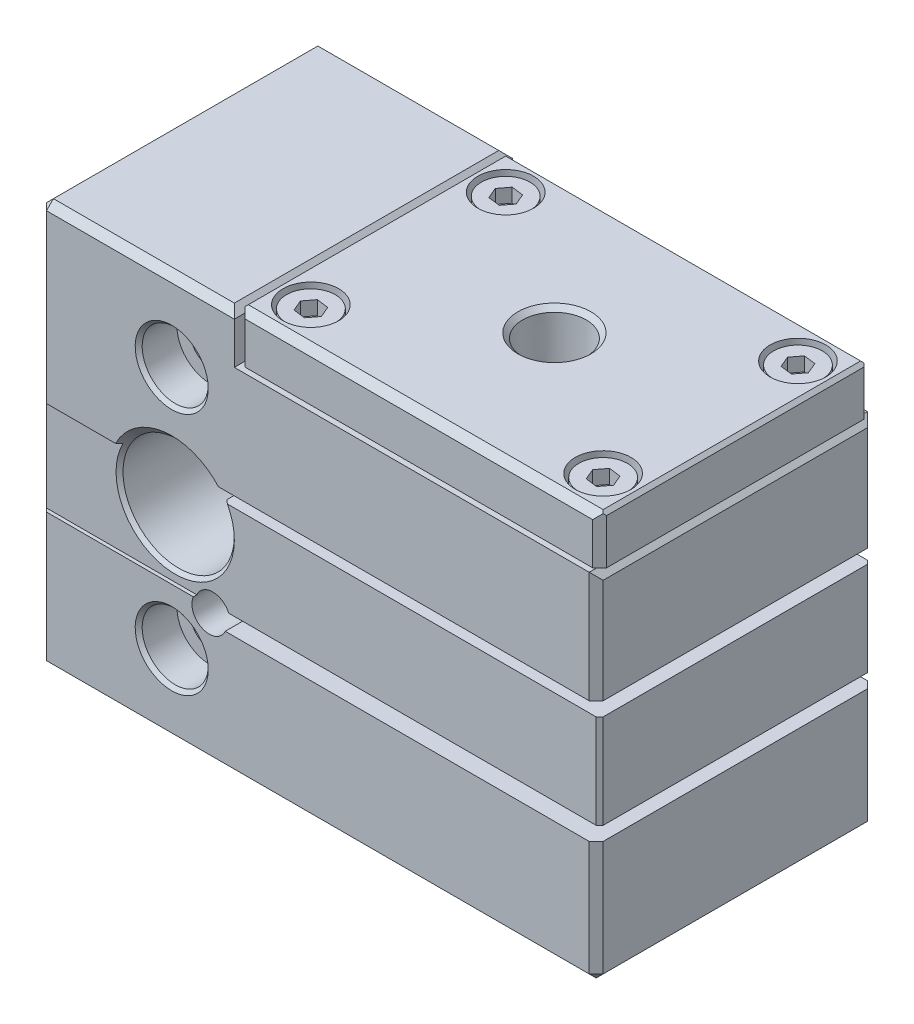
ISO-10303-21;
HEADER;
FILE_DESCRIPTION(('STEP AP214'),'2;1');
FILE_NAME('part.step','',(''),(''),'','','');
FILE_SCHEMA(('AUTOMOTIVE_DESIGN { 1 0 10303 214 1 1 1 1 }'));
ENDSEC;
DATA;
#1=APPLICATION_CONTEXT('core data for automotive mechanical design processes');
#2=APPLICATION_PROTOCOL_DEFINITION('international standard','automotive_design',2000,#1);
#3=PRODUCT_CONTEXT('',#1,'mechanical');
#4=PRODUCT('Part','Part','',(#3));
#5=PRODUCT_RELATED_PRODUCT_CATEGORY('part','',(#4));
#6=PRODUCT_DEFINITION_FORMATION('','',#4);
#7=PRODUCT_DEFINITION_CONTEXT('part definition',#1,'design');
#8=PRODUCT_DEFINITION('design','',#6,#7);
#9=PRODUCT_DEFINITION_SHAPE('','',#8);
#10=(LENGTH_UNIT() NAMED_UNIT(*) SI_UNIT(.MILLI.,.METRE.));
#11=(NAMED_UNIT(*) PLANE_ANGLE_UNIT() SI_UNIT($,.RADIAN.));
#12=(NAMED_UNIT(*) SI_UNIT($,.STERADIAN.) SOLID_ANGLE_UNIT());
#13=UNCERTAINTY_MEASURE_WITH_UNIT(LENGTH_MEASURE(1.E-05),#10,'distance_accuracy_value','');
#14=(GEOMETRIC_REPRESENTATION_CONTEXT(3) GLOBAL_UNCERTAINTY_ASSIGNED_CONTEXT((#13)) GLOBAL_UNIT_ASSIGNED_CONTEXT((#10,
#11,#12)) REPRESENTATION_CONTEXT('',''));
#15=CARTESIAN_POINT('',(0.,0.,0.));
#16=DIRECTION('',(0.,0.,1.));
#17=DIRECTION('',(1.,0.,0.));
#18=AXIS2_PLACEMENT_3D('',#15,#16,#17);
#19=CARTESIAN_POINT('',(35.,-9.,20.));
#20=DIRECTION('',(0.,-1.,0.));
#21=DIRECTION('',(0.,0.,1.));
#22=AXIS2_PLACEMENT_3D('',#19,#20,#21);
#23=CONICAL_SURFACE('',#22,9.25,0.78539816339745);
#24=CARTESIAN_POINT('',(35.,-11.5,20.));
#25=DIRECTION('',(0.,1.,0.));
#26=DIRECTION('',(0.,0.,-1.));
#27=AXIS2_PLACEMENT_3D('',#24,#25,#26);
#28=CIRCLE('',#27,11.75);
#29=CARTESIAN_POINT('',(35.,-11.5,8.25));
#30=VERTEX_POINT('',#29);
#31=EDGE_CURVE('E813',#30,#30,#28,.T.);
#32=ORIENTED_EDGE('',*,*,#31,.F.);
#33=EDGE_LOOP('',(#32));
#34=FACE_BOUND('',#33,.T.);
#35=CARTESIAN_POINT('',(35.,-11.25,20.));
#36=DIRECTION('',(0.,-1.,0.));
#37=DIRECTION('',(0.,0.,1.));
#38=AXIS2_PLACEMENT_3D('',#35,#36,#37);
#39=CIRCLE('',#38,11.5);
#40=CARTESIAN_POINT('',(35.,-11.25,31.5));
#41=VERTEX_POINT('',#40);
#42=EDGE_CURVE('E2588',#41,#41,#39,.F.);
#43=ORIENTED_EDGE('',*,*,#42,.T.);
#44=EDGE_LOOP('',(#43));
#45=FACE_BOUND('',#44,.T.);
#46=ADVANCED_FACE('F14',(#34,#45),#23,.F.);
#47=CARTESIAN_POINT('',(61.,-11.5,40.));
#48=DIRECTION('',(0.,1.,0.));
#49=DIRECTION('',(0.,0.,-1.));
#50=AXIS2_PLACEMENT_3D('',#47,#48,#49);
#51=PLANE('',#50);
#52=ORIENTED_EDGE('',*,*,#31,.T.);
#53=EDGE_LOOP('',(#52));
#54=FACE_BOUND('',#53,.T.);
#55=DIRECTION('',(0.,0.,-1.));
#56=VECTOR('',#55,1.);
#57=CARTESIAN_POINT('',(-18.,-11.5,40.));
#58=LINE('',#57,#56);
#59=CARTESIAN_POINT('',(-18.,-11.5,39.));
#60=VERTEX_POINT('',#59);
#61=CARTESIAN_POINT('',(-18.,-11.5,1.));
#62=VERTEX_POINT('',#61);
#63=EDGE_CURVE('E795',#60,#62,#58,.T.);
#64=ORIENTED_EDGE('',*,*,#63,.T.);
#65=DIRECTION('',(1.,0.,0.));
#66=VECTOR('',#65,1.);
#67=CARTESIAN_POINT('',(61.,-11.5,1.));
#68=LINE('',#67,#66);
#69=CARTESIAN_POINT('',(60.,-11.5,1.));
#70=VERTEX_POINT('',#69);
#71=EDGE_CURVE('E798',#62,#70,#68,.T.);
#72=ORIENTED_EDGE('',*,*,#71,.T.);
#73=DIRECTION('',(0.,0.,1.));
#74=VECTOR('',#73,1.);
#75=CARTESIAN_POINT('',(60.,-11.5,40.));
#76=LINE('',#75,#74);
#77=CARTESIAN_POINT('',(60.,-11.5,39.));
#78=VERTEX_POINT('',#77);
#79=EDGE_CURVE('E788',#70,#78,#76,.T.);
#80=ORIENTED_EDGE('',*,*,#79,.T.);
#81=DIRECTION('',(-1.,0.,0.));
#82=VECTOR('',#81,1.);
#83=CARTESIAN_POINT('',(61.,-11.5,39.));
#84=LINE('',#83,#82);
#85=EDGE_CURVE('E792',#78,#60,#84,.T.);
#86=ORIENTED_EDGE('',*,*,#85,.T.);
#87=EDGE_LOOP('',(#64,#72,#80,#86));
#88=FACE_BOUND('',#87,.T.);
#89=ADVANCED_FACE('F1319',(#54,#88),#51,.F.);
#90=CARTESIAN_POINT('',(-18.,-11.5,40.));
#91=DIRECTION('',(0.707106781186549,0.707106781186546,0.));
#92=DIRECTION('',(-0.707106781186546,0.707106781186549,0.));
#93=AXIS2_PLACEMENT_3D('',#90,#91,#92);
#94=PLANE('',#93);
#95=DIRECTION('',(-0.707106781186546,0.707106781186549,0.));
#96=VECTOR('',#95,1.);
#97=CARTESIAN_POINT('',(-18.5,-11.,39.));
#98=LINE('',#97,#96);
#99=CARTESIAN_POINT('',(-19.,-10.5,39.));
#100=VERTEX_POINT('',#99);
#101=EDGE_CURVE('E853',#60,#100,#98,.T.);
#102=ORIENTED_EDGE('',*,*,#101,.T.);
#103=DIRECTION('',(0.,0.,1.));
#104=VECTOR('',#103,1.);
#105=CARTESIAN_POINT('',(-19.,-10.5,40.));
#106=LINE('',#105,#104);
#107=CARTESIAN_POINT('',(-19.,-10.5,1.));
#108=VERTEX_POINT('',#107);
#109=EDGE_CURVE('E801',#108,#100,#106,.T.);
#110=ORIENTED_EDGE('',*,*,#109,.F.);
#111=DIRECTION('',(0.707106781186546,-0.707106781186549,0.));
#112=VECTOR('',#111,1.);
#113=CARTESIAN_POINT('',(-18.5,-11.,1.));
#114=LINE('',#113,#112);
#115=EDGE_CURVE('E844',#62,#108,#114,.F.);
#116=ORIENTED_EDGE('',*,*,#115,.F.);
#117=ORIENTED_EDGE('',*,*,#63,.F.);
#118=EDGE_LOOP('',(#102,#110,#116,#117));
#119=FACE_BOUND('',#118,.T.);
#120=ADVANCED_FACE('F1322',(#119),#94,.F.);
#121=CARTESIAN_POINT('',(61.,-11.5,1.));
#122=DIRECTION('',(0.,-0.707106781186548,-0.707106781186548));
#123=DIRECTION('',(0.,-0.707106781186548,0.707106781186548));
#124=AXIS2_PLACEMENT_3D('',#121,#122,#123);
#125=PLANE('',#124);
#126=DIRECTION('',(0.,-0.707106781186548,0.707106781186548));
#127=VECTOR('',#126,1.);
#128=CARTESIAN_POINT('',(-18.,-10.5,0.));
#129=LINE('',#128,#127);
#130=CARTESIAN_POINT('',(-18.,-10.5,0.));
#131=VERTEX_POINT('',#130);
#132=EDGE_CURVE('E835',#62,#131,#129,.F.);
#133=ORIENTED_EDGE('',*,*,#132,.T.);
#134=DIRECTION('',(-1.,0.,0.));
#135=VECTOR('',#134,1.);
#136=CARTESIAN_POINT('',(-19.,-10.5,0.));
#137=LINE('',#136,#135);
#138=CARTESIAN_POINT('',(60.,-10.5,0.));
#139=VERTEX_POINT('',#138);
#140=EDGE_CURVE('E706',#139,#131,#137,.T.);
#141=ORIENTED_EDGE('',*,*,#140,.F.);
#142=DIRECTION('',(0.,0.707106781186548,-0.707106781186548));
#143=VECTOR('',#142,1.);
#144=CARTESIAN_POINT('',(60.,-10.5,0.));
#145=LINE('',#144,#143);
#146=EDGE_CURVE('E829',#70,#139,#145,.T.);
#147=ORIENTED_EDGE('',*,*,#146,.F.);
#148=ORIENTED_EDGE('',*,*,#71,.F.);
#149=EDGE_LOOP('',(#133,#141,#147,#148));
#150=FACE_BOUND('',#149,.T.);
#151=ADVANCED_FACE('F1356',(#150),#125,.T.);
#152=CARTESIAN_POINT('',(61.,-10.5,40.));
#153=DIRECTION('',(-0.707106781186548,0.707106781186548,0.));
#154=DIRECTION('',(-0.707106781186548,-0.707106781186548,0.));
#155=AXIS2_PLACEMENT_3D('',#152,#153,#154);
#156=PLANE('',#155);
#157=DIRECTION('',(-0.707106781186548,-0.707106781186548,0.));
#158=VECTOR('',#157,1.);
#159=CARTESIAN_POINT('',(61.,-10.5,39.));
#160=LINE('',#159,#158);
#161=CARTESIAN_POINT('',(61.,-10.5,39.));
#162=VERTEX_POINT('',#161);
#163=EDGE_CURVE('E832',#162,#78,#160,.T.);
#164=ORIENTED_EDGE('',*,*,#163,.T.);
#165=ORIENTED_EDGE('',*,*,#79,.F.);
#166=DIRECTION('',(0.707106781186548,0.707106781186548,0.));
#167=VECTOR('',#166,1.);
#168=CARTESIAN_POINT('',(60.5,-11.,1.));
#169=LINE('',#168,#167);
#170=CARTESIAN_POINT('',(61.,-10.5,1.));
#171=VERTEX_POINT('',#170);
#172=EDGE_CURVE('E825',#171,#70,#169,.F.);
#173=ORIENTED_EDGE('',*,*,#172,.F.);
#174=DIRECTION('',(0.,0.,-1.));
#175=VECTOR('',#174,1.);
#176=CARTESIAN_POINT('',(61.,-10.5,40.));
#177=LINE('',#176,#175);
#178=EDGE_CURVE('E758',#162,#171,#177,.T.);
#179=ORIENTED_EDGE('',*,*,#178,.F.);
#180=EDGE_LOOP('',(#164,#165,#173,#179));
#181=FACE_BOUND('',#180,.T.);
#182=ADVANCED_FACE('F1352',(#181),#156,.F.);
#183=CARTESIAN_POINT('',(-19.,-10.5,40.));
#184=DIRECTION('',(0.,0.707106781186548,-0.707106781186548));
#185=DIRECTION('',(0.,-0.707106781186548,-0.707106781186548));
#186=AXIS2_PLACEMENT_3D('',#183,#184,#185);
#187=PLANE('',#186);
#188=DIRECTION('',(0.,-0.707106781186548,-0.707106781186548));
#189=VECTOR('',#188,1.);
#190=CARTESIAN_POINT('',(-18.,-10.5,40.));
#191=LINE('',#190,#189);
#192=CARTESIAN_POINT('',(-18.,-10.5,40.));
#193=VERTEX_POINT('',#192);
#194=EDGE_CURVE('E850',#193,#60,#191,.T.);
#195=ORIENTED_EDGE('',*,*,#194,.T.);
#196=ORIENTED_EDGE('',*,*,#85,.F.);
#197=DIRECTION('',(0.,0.707106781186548,0.707106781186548));
#198=VECTOR('',#197,1.);
#199=CARTESIAN_POINT('',(60.,-11.,39.5));
#200=LINE('',#199,#198);
#201=CARTESIAN_POINT('',(60.,-10.5,40.));
#202=VERTEX_POINT('',#201);
#203=EDGE_CURVE('E841',#202,#78,#200,.F.);
#204=ORIENTED_EDGE('',*,*,#203,.F.);
#205=DIRECTION('',(1.,0.,0.));
#206=VECTOR('',#205,1.);
#207=CARTESIAN_POINT('',(-19.,-10.5,40.));
#208=LINE('',#207,#206);
#209=EDGE_CURVE('E724',#193,#202,#208,.T.);
#210=ORIENTED_EDGE('',*,*,#209,.F.);
#211=EDGE_LOOP('',(#195,#196,#204,#210));
#212=FACE_BOUND('',#211,.T.);
#213=ADVANCED_FACE('F1355',(#212),#187,.F.);
#214=CARTESIAN_POINT('',(-18.,-10.5,40.));
#215=DIRECTION('',(-0.577350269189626,-0.577350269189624,0.577350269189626));
#216=DIRECTION('',(0.707106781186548,0.,0.707106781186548));
#217=AXIS2_PLACEMENT_3D('',#214,#215,#216);
#218=PLANE('',#217);
#219=ORIENTED_EDGE('',*,*,#194,.F.);
#220=DIRECTION('',(0.707106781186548,0.,0.707106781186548));
#221=VECTOR('',#220,1.);
#222=CARTESIAN_POINT('',(-18.,-10.5,40.));
#223=LINE('',#222,#221);
#224=EDGE_CURVE('E859',#193,#100,#223,.F.);
#225=ORIENTED_EDGE('',*,*,#224,.T.);
#226=ORIENTED_EDGE('',*,*,#101,.F.);
#227=EDGE_LOOP('',(#219,#225,#226));
#228=FACE_BOUND('',#227,.T.);
#229=ADVANCED_FACE('F1374',(#228),#218,.T.);
#230=CARTESIAN_POINT('',(-19.,-11.5,40.));
#231=DIRECTION('',(1.,0.,0.));
#232=DIRECTION('',(0.,0.,-1.));
#233=AXIS2_PLACEMENT_3D('',#230,#231,#232);
#234=PLANE('',#233);
#235=DIRECTION('',(0.,0.,-1.));
#236=VECTOR('',#235,1.);
#237=CARTESIAN_POINT('',(-19.,45.5,40.));
#238=LINE('',#237,#236);
#239=CARTESIAN_POINT('',(-19.,45.5,39.));
#240=VERTEX_POINT('',#239);
#241=CARTESIAN_POINT('',(-19.,45.5,1.));
#242=VERTEX_POINT('',#241);
#243=EDGE_CURVE('E807',#240,#242,#238,.T.);
#244=ORIENTED_EDGE('',*,*,#243,.T.);
#245=DIRECTION('',(0.,-1.,0.));
#246=VECTOR('',#245,1.);
#247=CARTESIAN_POINT('',(-19.,-11.5,1.));
#248=LINE('',#247,#246);
#249=EDGE_CURVE('E810',#242,#108,#248,.T.);
#250=ORIENTED_EDGE('',*,*,#249,.T.);
#251=ORIENTED_EDGE('',*,*,#109,.T.);
#252=DIRECTION('',(0.,1.,0.));
#253=VECTOR('',#252,1.);
#254=CARTESIAN_POINT('',(-19.,-11.5,39.));
#255=LINE('',#254,#253);
#256=EDGE_CURVE('E804',#100,#240,#255,.T.);
#257=ORIENTED_EDGE('',*,*,#256,.T.);
#258=EDGE_LOOP('',(#244,#250,#251,#257));
#259=FACE_BOUND('',#258,.T.);
#260=ADVANCED_FACE('F1289',(#259),#234,.F.);
#261=CARTESIAN_POINT('',(-18.,-10.5,0.));
#262=DIRECTION('',(-0.577350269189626,-0.577350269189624,-0.577350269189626));
#263=DIRECTION('',(-0.707106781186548,0.,0.707106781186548));
#264=AXIS2_PLACEMENT_3D('',#261,#262,#263);
#265=PLANE('',#264);
#266=ORIENTED_EDGE('',*,*,#115,.T.);
#267=DIRECTION('',(0.707106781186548,0.,-0.707106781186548));
#268=VECTOR('',#267,1.);
#269=CARTESIAN_POINT('',(-18.,-10.5,0.));
#270=LINE('',#269,#268);
#271=EDGE_CURVE('E847',#108,#131,#270,.T.);
#272=ORIENTED_EDGE('',*,*,#271,.T.);
#273=ORIENTED_EDGE('',*,*,#132,.F.);
#274=EDGE_LOOP('',(#266,#272,#273));
#275=FACE_BOUND('',#274,.T.);
#276=ADVANCED_FACE('F1364',(#275),#265,.T.);
#277=CARTESIAN_POINT('',(8.,46.5,40.));
#278=DIRECTION('',(-0.707106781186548,-0.707106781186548,0.));
#279=DIRECTION('',(0.707106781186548,-0.707106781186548,0.));
#280=AXIS2_PLACEMENT_3D('',#277,#278,#279);
#281=PLANE('',#280);
#282=DIRECTION('',(-0.577350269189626,0.577350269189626,-0.577350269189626));
#283=VECTOR('',#282,1.);
#284=CARTESIAN_POINT('',(-0.333333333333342,54.8333333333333,30.6666666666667));
#285=LINE('',#284,#283);
#286=CARTESIAN_POINT('',(8.,46.5,39.));
#287=VERTEX_POINT('',#286);
#288=CARTESIAN_POINT('',(9.,45.5,40.));
#289=VERTEX_POINT('',#288);
#290=EDGE_CURVE('E818',#287,#289,#285,.F.);
#291=ORIENTED_EDGE('',*,*,#290,.T.);
#292=DIRECTION('',(0.,0.,1.));
#293=VECTOR('',#292,1.);
#294=CARTESIAN_POINT('',(9.,45.5,40.));
#295=LINE('',#294,#293);
#296=CARTESIAN_POINT('',(9.,45.5,38.5));
#297=VERTEX_POINT('',#296);
#298=EDGE_CURVE('E785',#297,#289,#295,.T.);
#299=ORIENTED_EDGE('',*,*,#298,.F.);
#300=CARTESIAN_POINT('',(9.,45.5,1.5));
#301=VERTEX_POINT('',#300);
#302=EDGE_CURVE('E789',#301,#297,#295,.T.);
#303=ORIENTED_EDGE('',*,*,#302,.F.);
#304=CARTESIAN_POINT('',(9.,45.5,0.));
#305=VERTEX_POINT('',#304);
#306=EDGE_CURVE('E786',#305,#301,#295,.T.);
#307=ORIENTED_EDGE('',*,*,#306,.F.);
#308=DIRECTION('',(0.577350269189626,-0.577350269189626,-0.577350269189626));
#309=VECTOR('',#308,1.);
#310=CARTESIAN_POINT('',(-5.,59.5,14.));
#311=LINE('',#310,#309);
#312=CARTESIAN_POINT('',(8.,46.5,1.));
#313=VERTEX_POINT('',#312);
#314=EDGE_CURVE('E874',#313,#305,#311,.T.);
#315=ORIENTED_EDGE('',*,*,#314,.F.);
#316=DIRECTION('',(0.,0.,-1.));
#317=VECTOR('',#316,1.);
#318=CARTESIAN_POINT('',(8.,46.5,40.));
#319=LINE('',#318,#317);
#320=EDGE_CURVE('E779',#287,#313,#319,.T.);
#321=ORIENTED_EDGE('',*,*,#320,.F.);
#322=EDGE_LOOP('',(#291,#299,#303,#307,#315,#321));
#323=FACE_BOUND('',#322,.T.);
#324=ADVANCED_FACE('F1255',(#323),#281,.F.);
#325=CARTESIAN_POINT('',(-19.,45.5,40.));
#326=DIRECTION('',(0.,-0.707106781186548,-0.707106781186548));
#327=DIRECTION('',(0.,-0.707106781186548,0.707106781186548));
#328=AXIS2_PLACEMENT_3D('',#325,#326,#327);
#329=PLANE('',#328);
#330=DIRECTION('',(0.,-0.707106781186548,0.707106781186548));
#331=VECTOR('',#330,1.);
#332=CARTESIAN_POINT('',(-18.,45.5,40.));
#333=LINE('',#332,#331);
#334=CARTESIAN_POINT('',(-18.,45.5,40.));
#335=VERTEX_POINT('',#334);
#336=CARTESIAN_POINT('',(-18.,46.5,39.));
#337=VERTEX_POINT('',#336);
#338=EDGE_CURVE('E877',#335,#337,#333,.F.);
#339=ORIENTED_EDGE('',*,*,#338,.F.);
#340=DIRECTION('',(-1.,0.,0.));
#341=VECTOR('',#340,1.);
#342=CARTESIAN_POINT('',(-19.,45.5,40.));
#343=LINE('',#342,#341);
#344=EDGE_CURVE('E731',#289,#335,#343,.T.);
#345=ORIENTED_EDGE('',*,*,#344,.F.);
#346=ORIENTED_EDGE('',*,*,#290,.F.);
#347=DIRECTION('',(1.,0.,0.));
#348=VECTOR('',#347,1.);
#349=CARTESIAN_POINT('',(9.,46.5,39.));
#350=LINE('',#349,#348);
#351=EDGE_CURVE('E776',#337,#287,#350,.T.);
#352=ORIENTED_EDGE('',*,*,#351,.F.);
#353=EDGE_LOOP('',(#339,#345,#346,#352));
#354=FACE_BOUND('',#353,.T.);
#355=ADVANCED_FACE('F1263',(#354),#329,.F.);
#356=CARTESIAN_POINT('',(9.,46.5,40.));
#357=DIRECTION('',(-1.,0.,0.));
#358=DIRECTION('',(0.,-1.,0.));
#359=AXIS2_PLACEMENT_3D('',#356,#357,#358);
#360=PLANE('',#359);
#361=DIRECTION('',(0.,0.,-1.));
#362=VECTOR('',#361,1.);
#363=CARTESIAN_POINT('',(9.,39.8,40.));
#364=LINE('',#363,#362);
#365=CARTESIAN_POINT('',(9.,39.8,38.5));
#366=VERTEX_POINT('',#365);
#367=CARTESIAN_POINT('',(9.,39.8,1.5));
#368=VERTEX_POINT('',#367);
#369=EDGE_CURVE('E1245',#366,#368,#364,.T.);
#370=ORIENTED_EDGE('',*,*,#369,.F.);
#371=DIRECTION('',(0.,1.,0.));
#372=VECTOR('',#371,1.);
#373=CARTESIAN_POINT('',(9.,46.8,38.5));
#374=LINE('',#373,#372);
#375=EDGE_CURVE('E365',#366,#297,#374,.T.);
#376=ORIENTED_EDGE('',*,*,#375,.T.);
#377=ORIENTED_EDGE('',*,*,#298,.T.);
#378=DIRECTION('',(0.,1.,0.));
#379=VECTOR('',#378,1.);
#380=CARTESIAN_POINT('',(9.,46.5,40.));
#381=LINE('',#380,#379);
#382=CARTESIAN_POINT('',(9.,39.5,40.));
#383=VERTEX_POINT('',#382);
#384=EDGE_CURVE('E675',#383,#289,#381,.T.);
#385=ORIENTED_EDGE('',*,*,#384,.F.);
#386=DIRECTION('',(0.,0.,-1.));
#387=VECTOR('',#386,1.);
#388=CARTESIAN_POINT('',(9.,39.5,40.));
#389=LINE('',#388,#387);
#390=CARTESIAN_POINT('',(9.,39.5,0.));
#391=VERTEX_POINT('',#390);
#392=EDGE_CURVE('E679',#383,#391,#389,.T.);
#393=ORIENTED_EDGE('',*,*,#392,.T.);
#394=DIRECTION('',(0.,1.,0.));
#395=VECTOR('',#394,1.);
#396=CARTESIAN_POINT('',(9.,46.5,0.));
#397=LINE('',#396,#395);
#398=EDGE_CURVE('E676',#391,#305,#397,.T.);
#399=ORIENTED_EDGE('',*,*,#398,.T.);
#400=ORIENTED_EDGE('',*,*,#306,.T.);
#401=DIRECTION('',(0.,-1.,0.));
#402=VECTOR('',#401,1.);
#403=CARTESIAN_POINT('',(9.,46.8,1.5));
#404=LINE('',#403,#402);
#405=EDGE_CURVE('E31',#301,#368,#404,.T.);
#406=ORIENTED_EDGE('',*,*,#405,.T.);
#407=EDGE_LOOP('',(#370,#376,#377,#385,#393,#399,#400,#406));
#408=FACE_BOUND('',#407,.T.);
#409=ADVANCED_FACE('F1243',(#408),#360,.F.);
#410=CARTESIAN_POINT('',(9.,46.5,1.));
#411=DIRECTION('',(0.,0.707106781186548,-0.707106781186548));
#412=DIRECTION('',(0.,-0.707106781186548,-0.707106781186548));
#413=AXIS2_PLACEMENT_3D('',#410,#411,#412);
#414=PLANE('',#413);
#415=ORIENTED_EDGE('',*,*,#314,.T.);
#416=DIRECTION('',(1.,0.,0.));
#417=VECTOR('',#416,1.);
#418=CARTESIAN_POINT('',(9.,45.5,0.));
#419=LINE('',#418,#417);
#420=CARTESIAN_POINT('',(-18.,45.5,0.));
#421=VERTEX_POINT('',#420);
#422=EDGE_CURVE('E709',#421,#305,#419,.T.);
#423=ORIENTED_EDGE('',*,*,#422,.F.);
#424=DIRECTION('',(0.,-0.707106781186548,-0.707106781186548));
#425=VECTOR('',#424,1.);
#426=CARTESIAN_POINT('',(-18.,46.5,1.));
#427=LINE('',#426,#425);
#428=CARTESIAN_POINT('',(-18.,46.5,1.));
#429=VERTEX_POINT('',#428);
#430=EDGE_CURVE('E865',#429,#421,#427,.T.);
#431=ORIENTED_EDGE('',*,*,#430,.F.);
#432=DIRECTION('',(-1.,0.,0.));
#433=VECTOR('',#432,1.);
#434=CARTESIAN_POINT('',(-19.,46.5,1.));
#435=LINE('',#434,#433);
#436=EDGE_CURVE('E782',#313,#429,#435,.T.);
#437=ORIENTED_EDGE('',*,*,#436,.F.);
#438=EDGE_LOOP('',(#415,#423,#431,#437));
#439=FACE_BOUND('',#438,.T.);
#440=ADVANCED_FACE('F1278',(#439),#414,.T.);
#441=CARTESIAN_POINT('',(9.,46.5,40.));
#442=DIRECTION('',(0.,-1.,0.));
#443=DIRECTION('',(0.,0.,1.));
#444=AXIS2_PLACEMENT_3D('',#441,#442,#443);
#445=PLANE('',#444);
#446=ORIENTED_EDGE('',*,*,#320,.T.);
#447=ORIENTED_EDGE('',*,*,#436,.T.);
#448=DIRECTION('',(0.,0.,1.));
#449=VECTOR('',#448,1.);
#450=CARTESIAN_POINT('',(-18.,46.5,40.));
#451=LINE('',#450,#449);
#452=EDGE_CURVE('E773',#429,#337,#451,.T.);
#453=ORIENTED_EDGE('',*,*,#452,.T.);
#454=ORIENTED_EDGE('',*,*,#351,.T.);
#455=EDGE_LOOP('',(#446,#447,#453,#454));
#456=FACE_BOUND('',#455,.T.);
#457=ADVANCED_FACE('F1296',(#456),#445,.F.);
#458=CARTESIAN_POINT('',(-19.,-11.5,40.));
#459=DIRECTION('',(0.,0.,-1.));
#460=DIRECTION('',(0.,-1.,0.));
#461=AXIS2_PLACEMENT_3D('',#458,#459,#460);
#462=PLANE('',#461);
#463=CARTESIAN_POINT('',(0.,35.,40.));
#464=DIRECTION('',(0.,0.,-1.));
#465=DIRECTION('',(0.,-1.,0.));
#466=AXIS2_PLACEMENT_3D('',#463,#464,#465);
#467=CIRCLE('',#466,5.25);
#468=CARTESIAN_POINT('',(0.,29.75,40.));
#469=VERTEX_POINT('',#468);
#470=EDGE_CURVE('E965',#469,#469,#467,.T.);
#471=ORIENTED_EDGE('',*,*,#470,.T.);
#472=EDGE_LOOP('',(#471));
#473=FACE_BOUND('',#472,.T.);
#474=DIRECTION('',(1.,0.,0.));
#475=VECTOR('',#474,1.);
#476=CARTESIAN_POINT('',(-19.,21.5,40.));
#477=LINE('',#476,#475);
#478=CARTESIAN_POINT('',(-18.,21.5,40.));
#479=VERTEX_POINT('',#478);
#480=CARTESIAN_POINT('',(-8.06225774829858,21.5,40.));
#481=VERTEX_POINT('',#480);
#482=EDGE_CURVE('E1067',#479,#481,#477,.T.);
#483=ORIENTED_EDGE('',*,*,#482,.T.);
#484=CARTESIAN_POINT('',(0.,17.5,40.));
#485=DIRECTION('',(0.,0.,-1.));
#486=DIRECTION('',(0.,-1.,0.));
#487=AXIS2_PLACEMENT_3D('',#484,#485,#486);
#488=CIRCLE('',#487,9.);
#489=CARTESIAN_POINT('',(6.7082039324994,23.5,40.));
#490=VERTEX_POINT('',#489);
#491=EDGE_CURVE('E2590',#481,#490,#488,.T.);
#492=ORIENTED_EDGE('',*,*,#491,.T.);
#493=DIRECTION('',(-1.,0.,0.));
#494=VECTOR('',#493,1.);
#495=CARTESIAN_POINT('',(0.,23.5,40.));
#496=LINE('',#495,#494);
#497=CARTESIAN_POINT('',(60.,23.5,40.));
#498=VERTEX_POINT('',#497);
#499=EDGE_CURVE('E991',#498,#490,#496,.T.);
#500=ORIENTED_EDGE('',*,*,#499,.F.);
#501=DIRECTION('',(0.,1.,0.));
#502=VECTOR('',#501,1.);
#503=CARTESIAN_POINT('',(60.,-11.5,40.));
#504=LINE('',#503,#502);
#505=CARTESIAN_POINT('',(60.,39.5,40.));
#506=VERTEX_POINT('',#505);
#507=EDGE_CURVE('E737',#498,#506,#504,.T.);
#508=ORIENTED_EDGE('',*,*,#507,.T.);
#509=DIRECTION('',(-1.,0.,0.));
#510=VECTOR('',#509,1.);
#511=CARTESIAN_POINT('',(9.,39.5,40.));
#512=LINE('',#511,#510);
#513=EDGE_CURVE('E672',#506,#383,#512,.T.);
#514=ORIENTED_EDGE('',*,*,#513,.T.);
#515=ORIENTED_EDGE('',*,*,#384,.T.);
#516=ORIENTED_EDGE('',*,*,#344,.T.);
#517=DIRECTION('',(0.,-1.,0.));
#518=VECTOR('',#517,1.);
#519=CARTESIAN_POINT('',(-18.,-11.5,40.));
#520=LINE('',#519,#518);
#521=EDGE_CURVE('E728',#335,#479,#520,.T.);
#522=ORIENTED_EDGE('',*,*,#521,.T.);
#523=EDGE_LOOP('',(#483,#492,#500,#508,#514,#515,#516,#522));
#524=FACE_BOUND('',#523,.T.);
#525=ADVANCED_FACE('F1266',(#473,#524),#462,.F.);
#526=CARTESIAN_POINT('',(35.,5.38953359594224,20.));
#527=DIRECTION('',(0.,-1.,0.));
#528=DIRECTION('',(0.,0.,1.));
#529=AXIS2_PLACEMENT_3D('',#526,#527,#528);
#530=CYLINDRICAL_SURFACE('',#529,17.5);
#531=CARTESIAN_POINT('',(35.,39.5,20.));
#532=DIRECTION('',(0.,-1.,0.));
#533=DIRECTION('',(0.,0.,1.));
#534=AXIS2_PLACEMENT_3D('',#531,#532,#533);
#535=CIRCLE('',#534,17.5);
#536=CARTESIAN_POINT('',(35.,39.5,37.5));
#537=VERTEX_POINT('',#536);
#538=EDGE_CURVE('E668',#537,#537,#535,.T.);
#539=ORIENTED_EDGE('',*,*,#538,.F.);
#540=EDGE_LOOP('',(#539));
#541=FACE_BOUND('',#540,.T.);
#542=CARTESIAN_POINT('',(35.,39.,20.));
#543=DIRECTION('',(0.,-1.,0.));
#544=DIRECTION('',(1.,0.,0.));
#545=AXIS2_PLACEMENT_3D('',#542,#543,#544);
#546=CIRCLE('',#545,17.5);
#547=CARTESIAN_POINT('',(52.5,39.,20.));
#548=VERTEX_POINT('',#547);
#549=EDGE_CURVE('E2593',#548,#548,#546,.T.);
#550=ORIENTED_EDGE('',*,*,#549,.T.);
#551=EDGE_LOOP('',(#550));
#552=FACE_BOUND('',#551,.T.);
#553=ADVANCED_FACE('F527',(#541,#552),#530,.F.);
#554=CARTESIAN_POINT('',(9.,39.5,40.));
#555=DIRECTION('',(0.,-1.,0.));
#556=DIRECTION('',(0.,0.,1.));
#557=AXIS2_PLACEMENT_3D('',#554,#555,#556);
#558=PLANE('',#557);
#559=ORIENTED_EDGE('',*,*,#513,.F.);
#560=DIRECTION('',(0.,0.,-1.));
#561=VECTOR('',#560,1.);
#562=CARTESIAN_POINT('',(60.,39.5,40.));
#563=LINE('',#562,#561);
#564=CARTESIAN_POINT('',(60.,39.5,0.));
#565=VERTEX_POINT('',#564);
#566=EDGE_CURVE('E755',#506,#565,#563,.T.);
#567=ORIENTED_EDGE('',*,*,#566,.T.);
#568=DIRECTION('',(-1.,0.,0.));
#569=VECTOR('',#568,1.);
#570=CARTESIAN_POINT('',(9.,39.5,0.));
#571=LINE('',#570,#569);
#572=EDGE_CURVE('E671',#565,#391,#571,.T.);
#573=ORIENTED_EDGE('',*,*,#572,.T.);
#574=ORIENTED_EDGE('',*,*,#392,.F.);
#575=EDGE_LOOP('',(#559,#567,#573,#574));
#576=FACE_BOUND('',#575,.T.);
#577=ORIENTED_EDGE('',*,*,#538,.T.);
#578=EDGE_LOOP('',(#577));
#579=FACE_BOUND('',#578,.T.);
#580=CARTESIAN_POINT('',(14.,39.5,6.));
#581=DIRECTION('',(0.,1.,0.));
#582=DIRECTION('',(0.,0.,1.));
#583=AXIS2_PLACEMENT_3D('',#580,#581,#582);
#584=CIRCLE('',#583,2.);
#585=CARTESIAN_POINT('',(14.,39.5,8.));
#586=VERTEX_POINT('',#585);
#587=EDGE_CURVE('E361',#586,#586,#584,.F.);
#588=ORIENTED_EDGE('',*,*,#587,.T.);
#589=EDGE_LOOP('',(#588));
#590=FACE_BOUND('',#589,.T.);
#591=CARTESIAN_POINT('',(56.,39.5,6.00000000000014));
#592=DIRECTION('',(0.,1.,0.));
#593=DIRECTION('',(0.,0.,1.));
#594=AXIS2_PLACEMENT_3D('',#591,#592,#593);
#595=CIRCLE('',#594,2.);
#596=CARTESIAN_POINT('',(56.,39.5,8.00000000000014));
#597=VERTEX_POINT('',#596);
#598=EDGE_CURVE('E364',#597,#597,#595,.F.);
#599=ORIENTED_EDGE('',*,*,#598,.T.);
#600=EDGE_LOOP('',(#599));
#601=FACE_BOUND('',#600,.T.);
#602=CARTESIAN_POINT('',(56.,39.5,34.));
#603=DIRECTION('',(0.,1.,0.));
#604=DIRECTION('',(0.,0.,1.));
#605=AXIS2_PLACEMENT_3D('',#602,#603,#604);
#606=CIRCLE('',#605,2.);
#607=CARTESIAN_POINT('',(56.,39.5,36.));
#608=VERTEX_POINT('',#607);
#609=EDGE_CURVE('E23',#608,#608,#606,.F.);
#610=ORIENTED_EDGE('',*,*,#609,.T.);
#611=EDGE_LOOP('',(#610));
#612=FACE_BOUND('',#611,.T.);
#613=CARTESIAN_POINT('',(14.,39.5,34.));
#614=DIRECTION('',(0.,1.,0.));
#615=DIRECTION('',(0.,0.,1.));
#616=AXIS2_PLACEMENT_3D('',#613,#614,#615);
#617=CIRCLE('',#616,2.);
#618=CARTESIAN_POINT('',(14.,39.5,36.));
#619=VERTEX_POINT('',#618);
#620=EDGE_CURVE('E9',#619,#619,#617,.F.);
#621=ORIENTED_EDGE('',*,*,#620,.T.);
#622=EDGE_LOOP('',(#621));
#623=FACE_BOUND('',#622,.T.);
#624=ADVANCED_FACE('F370',(#576,#579,#590,#601,#612,#623),#558,.F.);
#625=CARTESIAN_POINT('',(-19.,-11.5,0.));
#626=DIRECTION('',(0.,0.,-1.));
#627=DIRECTION('',(0.,-1.,0.));
#628=AXIS2_PLACEMENT_3D('',#625,#626,#627);
#629=PLANE('',#628);
#630=CARTESIAN_POINT('',(0.,35.,0.));
#631=DIRECTION('',(0.,0.,-1.));
#632=DIRECTION('',(0.,-1.,0.));
#633=AXIS2_PLACEMENT_3D('',#630,#631,#632);
#634=CIRCLE('',#633,5.25);
#635=CARTESIAN_POINT('',(0.,29.75,0.));
#636=VERTEX_POINT('',#635);
#637=EDGE_CURVE('E959',#636,#636,#634,.F.);
#638=ORIENTED_EDGE('',*,*,#637,.T.);
#639=EDGE_LOOP('',(#638));
#640=FACE_BOUND('',#639,.T.);
#641=DIRECTION('',(-1.,0.,0.));
#642=VECTOR('',#641,1.);
#643=CARTESIAN_POINT('',(0.,23.5,0.));
#644=LINE('',#643,#642);
#645=CARTESIAN_POINT('',(60.,23.5,0.));
#646=VERTEX_POINT('',#645);
#647=CARTESIAN_POINT('',(6.70820393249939,23.5,0.));
#648=VERTEX_POINT('',#647);
#649=EDGE_CURVE('E1010',#646,#648,#644,.T.);
#650=ORIENTED_EDGE('',*,*,#649,.T.);
#651=CARTESIAN_POINT('',(0.,17.5,0.));
#652=DIRECTION('',(0.,0.,-1.));
#653=DIRECTION('',(0.,-1.,0.));
#654=AXIS2_PLACEMENT_3D('',#651,#652,#653);
#655=CIRCLE('',#654,9.);
#656=CARTESIAN_POINT('',(-8.06225774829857,21.5,0.));
#657=VERTEX_POINT('',#656);
#658=EDGE_CURVE('E967',#648,#657,#655,.F.);
#659=ORIENTED_EDGE('',*,*,#658,.T.);
#660=DIRECTION('',(1.,0.,0.));
#661=VECTOR('',#660,1.);
#662=CARTESIAN_POINT('',(-19.,21.5,0.));
#663=LINE('',#662,#661);
#664=CARTESIAN_POINT('',(-18.,21.5,0.));
#665=VERTEX_POINT('',#664);
#666=EDGE_CURVE('E1042',#665,#657,#663,.T.);
#667=ORIENTED_EDGE('',*,*,#666,.F.);
#668=DIRECTION('',(0.,1.,0.));
#669=VECTOR('',#668,1.);
#670=CARTESIAN_POINT('',(-18.,46.5,0.));
#671=LINE('',#670,#669);
#672=EDGE_CURVE('E702',#665,#421,#671,.T.);
#673=ORIENTED_EDGE('',*,*,#672,.T.);
#674=ORIENTED_EDGE('',*,*,#422,.T.);
#675=ORIENTED_EDGE('',*,*,#398,.F.);
#676=ORIENTED_EDGE('',*,*,#572,.F.);
#677=DIRECTION('',(0.,-1.,0.));
#678=VECTOR('',#677,1.);
#679=CARTESIAN_POINT('',(60.,23.5,0.));
#680=LINE('',#679,#678);
#681=EDGE_CURVE('E715',#565,#646,#680,.T.);
#682=ORIENTED_EDGE('',*,*,#681,.T.);
#683=EDGE_LOOP('',(#650,#659,#667,#673,#674,#675,#676,#682));
#684=FACE_BOUND('',#683,.T.);
#685=ADVANCED_FACE('F1273',(#640,#684),#629,.T.);
#686=CARTESIAN_POINT('',(-18.,45.5,40.));
#687=DIRECTION('',(-0.577350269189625,0.577350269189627,0.577350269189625));
#688=DIRECTION('',(0.,0.707106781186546,-0.707106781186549));
#689=AXIS2_PLACEMENT_3D('',#686,#687,#688);
#690=PLANE('',#689);
#691=DIRECTION('',(-0.707106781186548,0.,-0.707106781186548));
#692=VECTOR('',#691,1.);
#693=CARTESIAN_POINT('',(-18.,45.5,40.));
#694=LINE('',#693,#692);
#695=EDGE_CURVE('E868',#335,#240,#694,.T.);
#696=ORIENTED_EDGE('',*,*,#695,.F.);
#697=ORIENTED_EDGE('',*,*,#338,.T.);
#698=DIRECTION('',(0.707106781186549,0.707106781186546,0.));
#699=VECTOR('',#698,1.);
#700=CARTESIAN_POINT('',(-18.5,46.,39.));
#701=LINE('',#700,#699);
#702=EDGE_CURVE('E871',#240,#337,#701,.T.);
#703=ORIENTED_EDGE('',*,*,#702,.F.);
#704=EDGE_LOOP('',(#696,#697,#703));
#705=FACE_BOUND('',#704,.T.);
#706=ADVANCED_FACE('F1386',(#705),#690,.T.);
#707=CARTESIAN_POINT('',(-18.,46.5,1.));
#708=DIRECTION('',(-0.577350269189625,0.577350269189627,-0.577350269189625));
#709=DIRECTION('',(0.,-0.707106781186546,-0.707106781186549));
#710=AXIS2_PLACEMENT_3D('',#707,#708,#709);
#711=PLANE('',#710);
#712=DIRECTION('',(-0.707106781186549,-0.707106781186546,0.));
#713=VECTOR('',#712,1.);
#714=CARTESIAN_POINT('',(-18.,46.5,1.));
#715=LINE('',#714,#713);
#716=EDGE_CURVE('E862',#242,#429,#715,.F.);
#717=ORIENTED_EDGE('',*,*,#716,.T.);
#718=ORIENTED_EDGE('',*,*,#430,.T.);
#719=DIRECTION('',(-0.707106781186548,0.,0.707106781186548));
#720=VECTOR('',#719,1.);
#721=CARTESIAN_POINT('',(-18.5,45.5,0.5));
#722=LINE('',#721,#720);
#723=EDGE_CURVE('E856',#242,#421,#722,.F.);
#724=ORIENTED_EDGE('',*,*,#723,.F.);
#725=EDGE_LOOP('',(#717,#718,#724));
#726=FACE_BOUND('',#725,.T.);
#727=ADVANCED_FACE('F1283',(#726),#711,.T.);
#728=CARTESIAN_POINT('',(-19.,45.5,40.));
#729=DIRECTION('',(0.707106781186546,-0.707106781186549,0.));
#730=DIRECTION('',(0.707106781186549,0.707106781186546,0.));
#731=AXIS2_PLACEMENT_3D('',#728,#729,#730);
#732=PLANE('',#731);
#733=ORIENTED_EDGE('',*,*,#702,.T.);
#734=ORIENTED_EDGE('',*,*,#452,.F.);
#735=ORIENTED_EDGE('',*,*,#716,.F.);
#736=ORIENTED_EDGE('',*,*,#243,.F.);
#737=EDGE_LOOP('',(#733,#734,#735,#736));
#738=FACE_BOUND('',#737,.T.);
#739=ADVANCED_FACE('F1293',(#738),#732,.F.);
#740=CARTESIAN_POINT('',(60.,39.5,40.));
#741=DIRECTION('',(-0.707106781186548,-0.707106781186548,0.));
#742=DIRECTION('',(0.707106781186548,-0.707106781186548,0.));
#743=AXIS2_PLACEMENT_3D('',#740,#741,#742);
#744=PLANE('',#743);
#745=DIRECTION('',(0.577350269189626,-0.577350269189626,-0.577350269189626));
#746=VECTOR('',#745,1.);
#747=CARTESIAN_POINT('',(60.,39.5,40.));
#748=LINE('',#747,#746);
#749=CARTESIAN_POINT('',(61.,38.5,39.));
#750=VERTEX_POINT('',#749);
#751=EDGE_CURVE('E817',#506,#750,#748,.T.);
#752=ORIENTED_EDGE('',*,*,#751,.T.);
#753=DIRECTION('',(0.,0.,1.));
#754=VECTOR('',#753,1.);
#755=CARTESIAN_POINT('',(61.,38.5,40.));
#756=LINE('',#755,#754);
#757=CARTESIAN_POINT('',(61.,38.5,1.));
#758=VERTEX_POINT('',#757);
#759=EDGE_CURVE('E740',#758,#750,#756,.T.);
#760=ORIENTED_EDGE('',*,*,#759,.F.);
#761=DIRECTION('',(0.577350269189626,-0.577350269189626,0.577350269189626));
#762=VECTOR('',#761,1.);
#763=CARTESIAN_POINT('',(73.3333333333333,26.1666666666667,13.3333333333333));
#764=LINE('',#763,#762);
#765=EDGE_CURVE('E814',#565,#758,#764,.T.);
#766=ORIENTED_EDGE('',*,*,#765,.F.);
#767=ORIENTED_EDGE('',*,*,#566,.F.);
#768=EDGE_LOOP('',(#752,#760,#766,#767));
#769=FACE_BOUND('',#768,.T.);
#770=ADVANCED_FACE('F579',(#769),#744,.F.);
#771=CARTESIAN_POINT('',(0.,35.,39.5));
#772=DIRECTION('',(0.,0.,1.));
#773=DIRECTION('',(0.,1.,0.));
#774=AXIS2_PLACEMENT_3D('',#771,#772,#773);
#775=CONICAL_SURFACE('',#774,4.75,0.78539816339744);
#776=ORIENTED_EDGE('',*,*,#470,.F.);
#777=EDGE_LOOP('',(#776));
#778=FACE_BOUND('',#777,.T.);
#779=CARTESIAN_POINT('',(0.,35.,39.5));
#780=DIRECTION('',(0.,0.,-1.));
#781=DIRECTION('',(0.,-1.,0.));
#782=AXIS2_PLACEMENT_3D('',#779,#780,#781);
#783=CIRCLE('',#782,4.75);
#784=CARTESIAN_POINT('',(0.,30.25,39.5));
#785=VERTEX_POINT('',#784);
#786=EDGE_CURVE('E962',#785,#785,#783,.F.);
#787=ORIENTED_EDGE('',*,*,#786,.F.);
#788=EDGE_LOOP('',(#787));
#789=FACE_BOUND('',#788,.T.);
#790=ADVANCED_FACE('F525',(#778,#789),#775,.F.);
#791=CARTESIAN_POINT('',(32.4,21.5,20.));
#792=DIRECTION('',(0.,1.,0.));
#793=DIRECTION('',(0.,0.,-1.));
#794=AXIS2_PLACEMENT_3D('',#791,#792,#793);
#795=PLANE('',#794);
#796=DIRECTION('',(-1.,0.,0.));
#797=VECTOR('',#796,1.);
#798=CARTESIAN_POINT('',(61.,21.5,0.5));
#799=LINE('',#798,#797);
#800=CARTESIAN_POINT('',(60.5,21.5,0.5));
#801=VERTEX_POINT('',#800);
#802=CARTESIAN_POINT('',(7.5,21.5,0.5));
#803=VERTEX_POINT('',#802);
#804=EDGE_CURVE('E1050',#801,#803,#799,.T.);
#805=ORIENTED_EDGE('',*,*,#804,.T.);
#806=CARTESIAN_POINT('',(7.5,21.5,0.5));
#807=CARTESIAN_POINT('',(7.40508572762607,21.5,0.583773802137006));
#808=CARTESIAN_POINT('',(7.30997886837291,21.5,0.667327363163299));
#809=CARTESIAN_POINT('',(7.11937994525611,21.5,0.833994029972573));
#810=CARTESIAN_POINT('',(7.02388788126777,21.5,0.917107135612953));
#811=CARTESIAN_POINT('',(6.92820323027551,21.5,1.00000000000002));
#812=B_SPLINE_CURVE_WITH_KNOTS('',3,(#806,#807,#808,#809,#810,#811),.UNSPECIFIED.,.F.,.F.,(4,2,
4),(0.,0.379787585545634,0.759575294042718),.UNSPECIFIED.);
#813=CARTESIAN_POINT('',(6.92820323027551,21.5,1.00000000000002));
#814=VERTEX_POINT('',#813);
#815=EDGE_CURVE('E539',#803,#814,#812,.T.);
#816=ORIENTED_EDGE('',*,*,#815,.T.);
#817=DIRECTION('',(0.,0.,-1.));
#818=VECTOR('',#817,1.);
#819=CARTESIAN_POINT('',(6.92820323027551,21.5,40.));
#820=LINE('',#819,#818);
#821=CARTESIAN_POINT('',(6.92820323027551,21.5,39.));
#822=VERTEX_POINT('',#821);
#823=EDGE_CURVE('E920',#814,#822,#820,.F.);
#824=ORIENTED_EDGE('',*,*,#823,.T.);
#825=CARTESIAN_POINT('',(6.92820323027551,21.5,39.));
#826=CARTESIAN_POINT('',(7.02388788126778,21.5,39.0828928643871));
#827=CARTESIAN_POINT('',(7.11937994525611,21.5,39.1660059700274));
#828=CARTESIAN_POINT('',(7.30997886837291,21.5,39.3326726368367));
#829=CARTESIAN_POINT('',(7.40508572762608,21.5,39.416226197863));
#830=CARTESIAN_POINT('',(7.5,21.5,39.5));
#831=B_SPLINE_CURVE_WITH_KNOTS('',3,(#825,#826,#827,#828,#829,#830),.UNSPECIFIED.,.F.,.F.,(4,2,
4),(0.,0.379787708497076,0.759575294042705),.UNSPECIFIED.);
#832=CARTESIAN_POINT('',(7.5,21.5,39.5));
#833=VERTEX_POINT('',#832);
#834=EDGE_CURVE('E531',#822,#833,#831,.T.);
#835=ORIENTED_EDGE('',*,*,#834,.T.);
#836=DIRECTION('',(-1.,0.,0.));
#837=VECTOR('',#836,1.);
#838=CARTESIAN_POINT('',(61.,21.5,39.5));
#839=LINE('',#838,#837);
#840=CARTESIAN_POINT('',(60.5,21.5,39.5));
#841=VERTEX_POINT('',#840);
#842=EDGE_CURVE('E916',#841,#833,#839,.T.);
#843=ORIENTED_EDGE('',*,*,#842,.F.);
#844=DIRECTION('',(-0.707106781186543,0.,0.707106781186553));
#845=VECTOR('',#844,1.);
#846=CARTESIAN_POINT('',(56.2,21.5,43.8));
#847=LINE('',#846,#845);
#848=CARTESIAN_POINT('',(61.,21.5,39.));
#849=VERTEX_POINT('',#848);
#850=EDGE_CURVE('E696',#841,#849,#847,.F.);
#851=ORIENTED_EDGE('',*,*,#850,.T.);
#852=DIRECTION('',(0.,0.,1.));
#853=VECTOR('',#852,1.);
#854=CARTESIAN_POINT('',(61.,21.5,0.));
#855=LINE('',#854,#853);
#856=CARTESIAN_POINT('',(61.,21.5,1.));
#857=VERTEX_POINT('',#856);
#858=EDGE_CURVE('E1001',#857,#849,#855,.T.);
#859=ORIENTED_EDGE('',*,*,#858,.F.);
#860=DIRECTION('',(-0.707106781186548,0.,-0.707106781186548));
#861=VECTOR('',#860,1.);
#862=CARTESIAN_POINT('',(56.2,21.5,-3.8));
#863=LINE('',#862,#861);
#864=EDGE_CURVE('E699',#857,#801,#863,.T.);
#865=ORIENTED_EDGE('',*,*,#864,.T.);
#866=EDGE_LOOP('',(#805,#816,#824,#835,#843,#851,#859,#865));
#867=FACE_BOUND('',#866,.T.);
#868=CARTESIAN_POINT('',(35.,21.5,20.));
#869=DIRECTION('',(0.,1.,0.));
#870=DIRECTION('',(0.,0.,-1.));
#871=AXIS2_PLACEMENT_3D('',#868,#869,#870);
#872=CIRCLE('',#871,2.5);
#873=CARTESIAN_POINT('',(35.,21.5,17.5));
#874=VERTEX_POINT('',#873);
#875=EDGE_CURVE('E2589',#874,#874,#872,.F.);
#876=ORIENTED_EDGE('',*,*,#875,.T.);
#877=EDGE_LOOP('',(#876));
#878=FACE_BOUND('',#877,.T.);
#879=ADVANCED_FACE('F520',(#867,#878),#795,.T.);
#880=CARTESIAN_POINT('',(61.,8.,0.5));
#881=DIRECTION('',(0.,0.,1.));
#882=DIRECTION('',(0.,1.,0.));
#883=AXIS2_PLACEMENT_3D('',#880,#881,#882);
#884=PLANE('',#883);
#885=CARTESIAN_POINT('',(-7.5,21.5,0.5));
#886=VERTEX_POINT('',#885);
#887=CARTESIAN_POINT('',(-18.5,21.5,0.5));
#888=VERTEX_POINT('',#887);
#889=EDGE_CURVE('E1056',#886,#888,#799,.T.);
#890=ORIENTED_EDGE('',*,*,#889,.F.);
#891=CARTESIAN_POINT('',(0.,17.5,0.5));
#892=DIRECTION('',(0.,0.,1.));
#893=DIRECTION('',(0.,1.,0.));
#894=AXIS2_PLACEMENT_3D('',#891,#892,#893);
#895=CIRCLE('',#894,8.5);
#896=EDGE_CURVE('E901',#886,#803,#895,.T.);
#897=ORIENTED_EDGE('',*,*,#896,.T.);
#898=ORIENTED_EDGE('',*,*,#804,.F.);
#899=DIRECTION('',(0.,-1.,0.));
#900=VECTOR('',#899,1.);
#901=CARTESIAN_POINT('',(60.5,-11.5,0.5));
#902=LINE('',#901,#900);
#903=CARTESIAN_POINT('',(60.5,8.,0.5));
#904=VERTEX_POINT('',#903);
#905=EDGE_CURVE('E1047',#801,#904,#902,.T.);
#906=ORIENTED_EDGE('',*,*,#905,.T.);
#907=DIRECTION('',(-1.,0.,0.));
#908=VECTOR('',#907,1.);
#909=CARTESIAN_POINT('',(61.,8.,0.5));
#910=LINE('',#909,#908);
#911=CARTESIAN_POINT('',(7.69128784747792,8.,0.5));
#912=VERTEX_POINT('',#911);
#913=EDGE_CURVE('E1054',#904,#912,#910,.T.);
#914=ORIENTED_EDGE('',*,*,#913,.T.);
#915=CARTESIAN_POINT('',(5.4,7.,0.5));
#916=DIRECTION('',(0.,0.,1.));
#917=DIRECTION('',(0.,1.,0.));
#918=AXIS2_PLACEMENT_3D('',#915,#916,#917);
#919=CIRCLE('',#918,2.5);
#920=CARTESIAN_POINT('',(3.10871215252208,8.,0.5));
#921=VERTEX_POINT('',#920);
#922=EDGE_CURVE('E1044',#921,#912,#919,.F.);
#923=ORIENTED_EDGE('',*,*,#922,.F.);
#924=CARTESIAN_POINT('',(-18.5,8.,0.5));
#925=VERTEX_POINT('',#924);
#926=EDGE_CURVE('E1051',#921,#925,#910,.T.);
#927=ORIENTED_EDGE('',*,*,#926,.T.);
#928=DIRECTION('',(0.,1.,0.));
#929=VECTOR('',#928,1.);
#930=CARTESIAN_POINT('',(-18.5,-11.5,0.5));
#931=LINE('',#930,#929);
#932=EDGE_CURVE('E884',#925,#888,#931,.T.);
#933=ORIENTED_EDGE('',*,*,#932,.T.);
#934=EDGE_LOOP('',(#890,#897,#898,#906,#914,#923,#927,#933));
#935=FACE_BOUND('',#934,.T.);
#936=ADVANCED_FACE('F524',(#935),#884,.F.);
#937=CARTESIAN_POINT('',(0.,17.5,0.5));
#938=DIRECTION('',(0.,0.,-1.));
#939=DIRECTION('',(0.,-1.,0.));
#940=AXIS2_PLACEMENT_3D('',#937,#938,#939);
#941=CONICAL_SURFACE('',#940,8.5,0.785398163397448);
#942=ORIENTED_EDGE('',*,*,#896,.F.);
#943=CARTESIAN_POINT('',(-8.06225774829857,21.5,0.));
#944=CARTESIAN_POINT('',(-7.96840624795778,21.5,0.0840715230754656));
#945=CARTESIAN_POINT('',(-7.87441174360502,21.5,0.16798366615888));
#946=CARTESIAN_POINT('',(-7.68610848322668,21.5,0.335451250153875));
#947=CARTESIAN_POINT('',(-7.59179973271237,21.5,0.419006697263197));
#948=CARTESIAN_POINT('',(-7.40283618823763,21.5,0.585726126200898));
#949=CARTESIAN_POINT('',(-7.30818139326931,21.5,0.66889010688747));
#950=CARTESIAN_POINT('',(-7.11848842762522,21.5,0.834782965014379));
#951=CARTESIAN_POINT('',(-7.02345025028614,21.5,0.917511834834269));
#952=CARTESIAN_POINT('',(-6.92820323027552,21.5,1.00000000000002));
#953=B_SPLINE_CURVE_WITH_KNOTS('',3,(#943,#944,#945,#946,#947,#948,#949,#950,#951,#952),
.UNSPECIFIED.,.F.,.F.,(4,2,2,2,4),(0.,0.378001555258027,0.755996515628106,1.13399257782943,
1.51199523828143),.UNSPECIFIED.);
#954=EDGE_CURVE('E587',#657,#886,#953,.T.);
#955=ORIENTED_EDGE('',*,*,#954,.F.);
#956=ORIENTED_EDGE('',*,*,#658,.F.);
#957=CARTESIAN_POINT('',(5.29150262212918,23.5,1.00000000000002));
#958=CARTESIAN_POINT('',(5.41205778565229,23.5,0.920251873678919));
#959=CARTESIAN_POINT('',(5.53191155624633,23.5,0.839451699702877));
#960=CARTESIAN_POINT('',(5.77031606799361,23.5,0.675999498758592));
#961=CARTESIAN_POINT('',(5.88886705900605,23.5,0.593347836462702));
#962=CARTESIAN_POINT('',(6.12480869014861,23.5,0.426416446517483));
#963=CARTESIAN_POINT('',(6.24219937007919,23.5,0.342136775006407));
#964=CARTESIAN_POINT('',(6.47595251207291,23.5,0.172115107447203));
#965=CARTESIAN_POINT('',(6.59231476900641,23.5,0.0863728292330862));
#966=CARTESIAN_POINT('',(6.70820393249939,23.5,0.));
#967=B_SPLINE_CURVE_WITH_KNOTS('',3,(#957,#958,#959,#960,#961,#962,#963,#964,#965,#966),
.UNSPECIFIED.,.F.,.F.,(4,2,2,2,4),(0.,0.433623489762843,0.867162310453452,1.30068620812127,
1.73429470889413),.UNSPECIFIED.);
#968=CARTESIAN_POINT('',(5.29150262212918,23.5,1.00000000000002));
#969=VERTEX_POINT('',#968);
#970=EDGE_CURVE('E596',#969,#648,#967,.T.);
#971=ORIENTED_EDGE('',*,*,#970,.F.);
#972=CARTESIAN_POINT('',(0.,17.5,1.00000000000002));
#973=DIRECTION('',(0.,0.,1.));
#974=DIRECTION('',(0.,1.,0.));
#975=AXIS2_PLACEMENT_3D('',#972,#973,#974);
#976=CIRCLE('',#975,8.);
#977=EDGE_CURVE('E943',#814,#969,#976,.F.);
#978=ORIENTED_EDGE('',*,*,#977,.F.);
#979=ORIENTED_EDGE('',*,*,#815,.F.);
#980=EDGE_LOOP('',(#942,#955,#956,#971,#978,#979));
#981=FACE_BOUND('',#980,.T.);
#982=ADVANCED_FACE('F549',(#981),#941,.F.);
#983=CARTESIAN_POINT('',(0.,17.5,40.));
#984=DIRECTION('',(0.,0.,-1.));
#985=DIRECTION('',(0.,-1.,0.));
#986=AXIS2_PLACEMENT_3D('',#983,#984,#985);
#987=CYLINDRICAL_SURFACE('',#986,8.);
#988=ORIENTED_EDGE('',*,*,#977,.T.);
#989=DIRECTION('',(0.,0.,-1.));
#990=VECTOR('',#989,1.);
#991=CARTESIAN_POINT('',(5.29150262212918,23.5,40.));
#992=LINE('',#991,#990);
#993=CARTESIAN_POINT('',(5.29150262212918,23.5,39.));
#994=VERTEX_POINT('',#993);
#995=EDGE_CURVE('E987',#994,#969,#992,.T.);
#996=ORIENTED_EDGE('',*,*,#995,.F.);
#997=CARTESIAN_POINT('',(0.,17.5,39.));
#998=DIRECTION('',(0.,0.,-1.));
#999=DIRECTION('',(0.,-1.,0.));
#1000=AXIS2_PLACEMENT_3D('',#997,#998,#999);
#1001=CIRCLE('',#1000,8.);
#1002=EDGE_CURVE('E547',#994,#822,#1001,.F.);
#1003=ORIENTED_EDGE('',*,*,#1002,.T.);
#1004=ORIENTED_EDGE('',*,*,#823,.F.);
#1005=EDGE_LOOP('',(#988,#996,#1003,#1004));
#1006=FACE_BOUND('',#1005,.T.);
#1007=ADVANCED_FACE('F553',(#1006),#987,.F.);
#1008=CARTESIAN_POINT('',(0.,17.5,39.5));
#1009=DIRECTION('',(0.,0.,1.));
#1010=DIRECTION('',(0.,1.,0.));
#1011=AXIS2_PLACEMENT_3D('',#1008,#1009,#1010);
#1012=CONICAL_SURFACE('',#1011,8.5,0.785398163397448);
#1013=ORIENTED_EDGE('',*,*,#834,.F.);
#1014=ORIENTED_EDGE('',*,*,#1002,.F.);
#1015=CARTESIAN_POINT('',(6.7082039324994,23.5,40.));
#1016=CARTESIAN_POINT('',(6.59231476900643,23.5,39.9136271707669));
#1017=CARTESIAN_POINT('',(6.47595251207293,23.5,39.8278848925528));
#1018=CARTESIAN_POINT('',(6.24219937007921,23.5,39.6578632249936));
#1019=CARTESIAN_POINT('',(6.12480869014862,23.5,39.5735835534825));
#1020=CARTESIAN_POINT('',(5.88886705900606,23.5,39.4066521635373));
#1021=CARTESIAN_POINT('',(5.77031606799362,23.5,39.3240005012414));
#1022=CARTESIAN_POINT('',(5.53191155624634,23.5,39.1605483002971));
#1023=CARTESIAN_POINT('',(5.4120577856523,23.5,39.0797481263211));
#1024=CARTESIAN_POINT('',(5.29150262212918,23.5,39.));
#1025=B_SPLINE_CURVE_WITH_KNOTS('',3,(#1015,#1016,#1017,#1018,#1019,#1020,#1021,#1022,#1023,
#1024),.UNSPECIFIED.,.F.,.F.,(4,2,2,2,4),(0.,0.433608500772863,0.867132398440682,
1.30067121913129,1.73429470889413),.UNSPECIFIED.);
#1026=EDGE_CURVE('E605',#490,#994,#1025,.T.);
#1027=ORIENTED_EDGE('',*,*,#1026,.F.);
#1028=ORIENTED_EDGE('',*,*,#491,.F.);
#1029=CARTESIAN_POINT('',(-6.92820323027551,21.5,39.));
#1030=CARTESIAN_POINT('',(-7.02345025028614,21.5,39.0824881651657));
#1031=CARTESIAN_POINT('',(-7.11848842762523,21.5,39.1652170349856));
#1032=CARTESIAN_POINT('',(-7.30818139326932,21.5,39.3311098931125));
#1033=CARTESIAN_POINT('',(-7.40283618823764,21.5,39.4142738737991));
#1034=CARTESIAN_POINT('',(-7.59179973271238,21.5,39.5809933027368));
#1035=CARTESIAN_POINT('',(-7.68610848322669,21.5,39.6645487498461));
#1036=CARTESIAN_POINT('',(-7.87441174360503,21.5,39.8320163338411));
#1037=CARTESIAN_POINT('',(-7.96840624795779,21.5,39.9159284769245));
#1038=CARTESIAN_POINT('',(-8.06225774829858,21.5,40.));
#1039=B_SPLINE_CURVE_WITH_KNOTS('',3,(#1029,#1030,#1031,#1032,#1033,#1034,#1035,#1036,#1037,
#1038),.UNSPECIFIED.,.F.,.F.,(4,2,2,2,4),(0.,0.378002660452,0.755998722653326,1.1339936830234,
1.51199523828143),.UNSPECIFIED.);
#1040=CARTESIAN_POINT('',(-7.5,21.5,39.5));
#1041=VERTEX_POINT('',#1040);
#1042=EDGE_CURVE('E604',#1041,#481,#1039,.T.);
#1043=ORIENTED_EDGE('',*,*,#1042,.F.);
#1044=CARTESIAN_POINT('',(0.,17.5,39.5));
#1045=DIRECTION('',(0.,0.,-1.));
#1046=DIRECTION('',(0.,-1.,0.));
#1047=AXIS2_PLACEMENT_3D('',#1044,#1045,#1046);
#1048=CIRCLE('',#1047,8.5);
#1049=EDGE_CURVE('E931',#833,#1041,#1048,.T.);
#1050=ORIENTED_EDGE('',*,*,#1049,.F.);
#1051=EDGE_LOOP('',(#1013,#1014,#1027,#1028,#1043,#1050));
#1052=FACE_BOUND('',#1051,.T.);
#1053=ADVANCED_FACE('F556',(#1052),#1012,.F.);
#1054=CARTESIAN_POINT('',(61.,8.,39.5));
#1055=DIRECTION('',(0.,0.,-1.));
#1056=DIRECTION('',(0.,-1.,0.));
#1057=AXIS2_PLACEMENT_3D('',#1054,#1055,#1056);
#1058=PLANE('',#1057);
#1059=ORIENTED_EDGE('',*,*,#842,.T.);
#1060=ORIENTED_EDGE('',*,*,#1049,.T.);
#1061=CARTESIAN_POINT('',(-18.5,21.5,39.5));
#1062=VERTEX_POINT('',#1061);
#1063=EDGE_CURVE('E937',#1041,#1062,#839,.T.);
#1064=ORIENTED_EDGE('',*,*,#1063,.T.);
#1065=DIRECTION('',(0.,1.,0.));
#1066=VECTOR('',#1065,1.);
#1067=CARTESIAN_POINT('',(-18.5,-11.5,39.5));
#1068=LINE('',#1067,#1066);
#1069=CARTESIAN_POINT('',(-18.5,8.,39.5));
#1070=VERTEX_POINT('',#1069);
#1071=EDGE_CURVE('E896',#1062,#1070,#1068,.F.);
#1072=ORIENTED_EDGE('',*,*,#1071,.T.);
#1073=DIRECTION('',(-1.,0.,0.));
#1074=VECTOR('',#1073,1.);
#1075=CARTESIAN_POINT('',(61.,8.,39.5));
#1076=LINE('',#1075,#1074);
#1077=CARTESIAN_POINT('',(3.10871215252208,8.,39.5));
#1078=VERTEX_POINT('',#1077);
#1079=EDGE_CURVE('E936',#1078,#1070,#1076,.T.);
#1080=ORIENTED_EDGE('',*,*,#1079,.F.);
#1081=CARTESIAN_POINT('',(5.4,7.,39.5));
#1082=DIRECTION('',(0.,0.,-1.));
#1083=DIRECTION('',(0.,-1.,0.));
#1084=AXIS2_PLACEMENT_3D('',#1081,#1082,#1083);
#1085=CIRCLE('',#1084,2.5);
#1086=CARTESIAN_POINT('',(7.69128784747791,8.,39.5));
#1087=VERTEX_POINT('',#1086);
#1088=EDGE_CURVE('E1063',#1087,#1078,#1085,.F.);
#1089=ORIENTED_EDGE('',*,*,#1088,.F.);
#1090=CARTESIAN_POINT('',(60.5,8.,39.5));
#1091=VERTEX_POINT('',#1090);
#1092=EDGE_CURVE('E1069',#1091,#1087,#1076,.T.);
#1093=ORIENTED_EDGE('',*,*,#1092,.F.);
#1094=DIRECTION('',(0.,-1.,0.));
#1095=VECTOR('',#1094,1.);
#1096=CARTESIAN_POINT('',(60.5,-11.5,39.5));
#1097=LINE('',#1096,#1095);
#1098=EDGE_CURVE('E935',#1091,#841,#1097,.F.);
#1099=ORIENTED_EDGE('',*,*,#1098,.T.);
#1100=EDGE_LOOP('',(#1059,#1060,#1064,#1072,#1080,#1089,#1093,#1099));
#1101=FACE_BOUND('',#1100,.T.);
#1102=ADVANCED_FACE('F560',(#1101),#1058,.F.);
#1103=CARTESIAN_POINT('',(60.,-11.5,40.));
#1104=DIRECTION('',(-0.707106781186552,0.,-0.707106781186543));
#1105=DIRECTION('',(-0.707106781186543,0.,0.707106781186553));
#1106=AXIS2_PLACEMENT_3D('',#1103,#1104,#1105);
#1107=PLANE('',#1106);
#1108=ORIENTED_EDGE('',*,*,#1098,.F.);
#1109=DIRECTION('',(0.707106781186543,0.,-0.707106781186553));
#1110=VECTOR('',#1109,1.);
#1111=CARTESIAN_POINT('',(60.,8.,40.));
#1112=LINE('',#1111,#1110);
#1113=CARTESIAN_POINT('',(61.,8.,39.));
#1114=VERTEX_POINT('',#1113);
#1115=EDGE_CURVE('E718',#1114,#1091,#1112,.F.);
#1116=ORIENTED_EDGE('',*,*,#1115,.F.);
#1117=DIRECTION('',(0.,-1.,0.));
#1118=VECTOR('',#1117,1.);
#1119=CARTESIAN_POINT('',(61.,-11.5,39.));
#1120=LINE('',#1119,#1118);
#1121=EDGE_CURVE('E685',#849,#1114,#1120,.T.);
#1122=ORIENTED_EDGE('',*,*,#1121,.F.);
#1123=ORIENTED_EDGE('',*,*,#850,.F.);
#1124=EDGE_LOOP('',(#1108,#1116,#1122,#1123));
#1125=FACE_BOUND('',#1124,.T.);
#1126=ADVANCED_FACE('F1329',(#1125),#1107,.F.);
#1127=CARTESIAN_POINT('',(61.,-11.5,40.));
#1128=DIRECTION('',(-1.,0.,0.));
#1129=DIRECTION('',(0.,-1.,0.));
#1130=AXIS2_PLACEMENT_3D('',#1127,#1128,#1129);
#1131=PLANE('',#1130);
#1132=DIRECTION('',(0.,0.,1.));
#1133=VECTOR('',#1132,1.);
#1134=CARTESIAN_POINT('',(61.,8.,0.));
#1135=LINE('',#1134,#1133);
#1136=CARTESIAN_POINT('',(61.,8.,1.));
#1137=VERTEX_POINT('',#1136);
#1138=EDGE_CURVE('E1013',#1137,#1114,#1135,.T.);
#1139=ORIENTED_EDGE('',*,*,#1138,.F.);
#1140=DIRECTION('',(0.,1.,0.));
#1141=VECTOR('',#1140,1.);
#1142=CARTESIAN_POINT('',(61.,21.5,1.));
#1143=LINE('',#1142,#1141);
#1144=EDGE_CURVE('E693',#1137,#857,#1143,.T.);
#1145=ORIENTED_EDGE('',*,*,#1144,.T.);
#1146=ORIENTED_EDGE('',*,*,#858,.T.);
#1147=ORIENTED_EDGE('',*,*,#1121,.T.);
#1148=EDGE_LOOP('',(#1139,#1145,#1146,#1147));
#1149=FACE_BOUND('',#1148,.T.);
#1150=ADVANCED_FACE('F1317',(#1149),#1131,.F.);
#1151=CARTESIAN_POINT('',(61.,-11.5,1.));
#1152=DIRECTION('',(0.707106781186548,0.,-0.707106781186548));
#1153=DIRECTION('',(-0.707106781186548,0.,-0.707106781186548));
#1154=AXIS2_PLACEMENT_3D('',#1151,#1152,#1153);
#1155=PLANE('',#1154);
#1156=ORIENTED_EDGE('',*,*,#905,.F.);
#1157=ORIENTED_EDGE('',*,*,#864,.F.);
#1158=ORIENTED_EDGE('',*,*,#1144,.F.);
#1159=DIRECTION('',(0.707106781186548,0.,0.707106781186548));
#1160=VECTOR('',#1159,1.);
#1161=CARTESIAN_POINT('',(61.,8.,1.));
#1162=LINE('',#1161,#1160);
#1163=EDGE_CURVE('E721',#904,#1137,#1162,.T.);
#1164=ORIENTED_EDGE('',*,*,#1163,.F.);
#1165=EDGE_LOOP('',(#1156,#1157,#1158,#1164));
#1166=FACE_BOUND('',#1165,.T.);
#1167=ADVANCED_FACE('F1324',(#1166),#1155,.T.);
#1168=CARTESIAN_POINT('',(61.,21.5,-9.59865627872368));
#1169=DIRECTION('',(0.,1.,0.));
#1170=DIRECTION('',(0.,0.,-1.));
#1171=AXIS2_PLACEMENT_3D('',#1168,#1169,#1170);
#1172=PLANE('',#1171);
#1173=ORIENTED_EDGE('',*,*,#666,.T.);
#1174=ORIENTED_EDGE('',*,*,#954,.T.);
#1175=ORIENTED_EDGE('',*,*,#889,.T.);
#1176=DIRECTION('',(0.707106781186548,0.,-0.707106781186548));
#1177=VECTOR('',#1176,1.);
#1178=CARTESIAN_POINT('',(-19.,21.5,1.));
#1179=LINE('',#1178,#1177);
#1180=EDGE_CURVE('E887',#888,#665,#1179,.T.);
#1181=ORIENTED_EDGE('',*,*,#1180,.T.);
#1182=EDGE_LOOP('',(#1173,#1174,#1175,#1181));
#1183=FACE_BOUND('',#1182,.T.);
#1184=ADVANCED_FACE('F1327',(#1183),#1172,.F.);
#1185=CARTESIAN_POINT('',(7.69128784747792,8.,0.));
#1186=DIRECTION('',(0.,1.,0.));
#1187=DIRECTION('',(-1.,0.,0.));
#1188=AXIS2_PLACEMENT_3D('',#1185,#1186,#1187);
#1189=PLANE('',#1188);
#1190=ORIENTED_EDGE('',*,*,#1115,.T.);
#1191=ORIENTED_EDGE('',*,*,#1092,.T.);
#1192=DIRECTION('',(0.,0.,1.));
#1193=VECTOR('',#1192,1.);
#1194=CARTESIAN_POINT('',(7.69128784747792,8.,0.));
#1195=LINE('',#1194,#1193);
#1196=EDGE_CURVE('E1015',#912,#1087,#1195,.T.);
#1197=ORIENTED_EDGE('',*,*,#1196,.F.);
#1198=ORIENTED_EDGE('',*,*,#913,.F.);
#1199=ORIENTED_EDGE('',*,*,#1163,.T.);
#1200=ORIENTED_EDGE('',*,*,#1138,.T.);
#1201=EDGE_LOOP('',(#1190,#1191,#1197,#1198,#1199,#1200));
#1202=FACE_BOUND('',#1201,.T.);
#1203=ADVANCED_FACE('F624',(#1202),#1189,.F.);
#1204=CARTESIAN_POINT('',(7.69128784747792,6.,0.));
#1205=DIRECTION('',(0.,-1.,0.));
#1206=DIRECTION('',(1.,0.,0.));
#1207=AXIS2_PLACEMENT_3D('',#1204,#1205,#1206);
#1208=PLANE('',#1207);
#1209=DIRECTION('',(0.,0.,1.));
#1210=VECTOR('',#1209,1.);
#1211=CARTESIAN_POINT('',(61.,6.,0.));
#1212=LINE('',#1211,#1210);
#1213=CARTESIAN_POINT('',(61.,6.,1.));
#1214=VERTEX_POINT('',#1213);
#1215=CARTESIAN_POINT('',(61.,6.,39.));
#1216=VERTEX_POINT('',#1215);
#1217=EDGE_CURVE('E1022',#1214,#1216,#1212,.T.);
#1218=ORIENTED_EDGE('',*,*,#1217,.F.);
#1219=DIRECTION('',(-0.707106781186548,0.,-0.707106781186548));
#1220=VECTOR('',#1219,1.);
#1221=CARTESIAN_POINT('',(61.,6.,1.));
#1222=LINE('',#1221,#1220);
#1223=CARTESIAN_POINT('',(60.,6.,0.));
#1224=VERTEX_POINT('',#1223);
#1225=EDGE_CURVE('E770',#1214,#1224,#1222,.T.);
#1226=ORIENTED_EDGE('',*,*,#1225,.T.);
#1227=DIRECTION('',(1.,0.,0.));
#1228=VECTOR('',#1227,1.);
#1229=CARTESIAN_POINT('',(7.69128784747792,6.,0.));
#1230=LINE('',#1229,#1228);
#1231=CARTESIAN_POINT('',(7.69128784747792,6.,0.));
#1232=VERTEX_POINT('',#1231);
#1233=EDGE_CURVE('E1019',#1232,#1224,#1230,.T.);
#1234=ORIENTED_EDGE('',*,*,#1233,.F.);
#1235=DIRECTION('',(0.,0.,1.));
#1236=VECTOR('',#1235,1.);
#1237=CARTESIAN_POINT('',(7.69128784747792,6.,0.));
#1238=LINE('',#1237,#1236);
#1239=CARTESIAN_POINT('',(7.69128784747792,6.,40.));
#1240=VERTEX_POINT('',#1239);
#1241=EDGE_CURVE('E1018',#1232,#1240,#1238,.T.);
#1242=ORIENTED_EDGE('',*,*,#1241,.T.);
#1243=DIRECTION('',(1.,0.,0.));
#1244=VECTOR('',#1243,1.);
#1245=CARTESIAN_POINT('',(7.69128784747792,6.,40.));
#1246=LINE('',#1245,#1244);
#1247=CARTESIAN_POINT('',(60.,6.,40.));
#1248=VERTEX_POINT('',#1247);
#1249=EDGE_CURVE('E1027',#1240,#1248,#1246,.T.);
#1250=ORIENTED_EDGE('',*,*,#1249,.T.);
#1251=DIRECTION('',(-0.707106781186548,0.,0.707106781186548));
#1252=VECTOR('',#1251,1.);
#1253=CARTESIAN_POINT('',(60.,6.,40.));
#1254=LINE('',#1253,#1252);
#1255=EDGE_CURVE('E767',#1248,#1216,#1254,.F.);
#1256=ORIENTED_EDGE('',*,*,#1255,.T.);
#1257=EDGE_LOOP('',(#1218,#1226,#1234,#1242,#1250,#1256));
#1258=FACE_BOUND('',#1257,.T.);
#1259=ADVANCED_FACE('F1573',(#1258),#1208,.F.);
#1260=ORIENTED_EDGE('',*,*,#178,.T.);
#1261=DIRECTION('',(0.,1.,0.));
#1262=VECTOR('',#1261,1.);
#1263=CARTESIAN_POINT('',(61.,6.,1.));
#1264=LINE('',#1263,#1262);
#1265=EDGE_CURVE('E764',#171,#1214,#1264,.T.);
#1266=ORIENTED_EDGE('',*,*,#1265,.T.);
#1267=ORIENTED_EDGE('',*,*,#1217,.T.);
#1268=DIRECTION('',(0.,-1.,0.));
#1269=VECTOR('',#1268,1.);
#1270=CARTESIAN_POINT('',(61.,-11.5,39.));
#1271=LINE('',#1270,#1269);
#1272=EDGE_CURVE('E761',#1216,#162,#1271,.T.);
#1273=ORIENTED_EDGE('',*,*,#1272,.T.);
#1274=EDGE_LOOP('',(#1260,#1266,#1267,#1273));
#1275=FACE_BOUND('',#1274,.T.);
#1276=ADVANCED_FACE('F1318',(#1275),#1131,.F.);
#1277=CARTESIAN_POINT('',(61.,-11.5,1.));
#1278=DIRECTION('',(0.707106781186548,0.,-0.707106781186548));
#1279=DIRECTION('',(-0.707106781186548,0.,-0.707106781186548));
#1280=AXIS2_PLACEMENT_3D('',#1277,#1278,#1279);
#1281=PLANE('',#1280);
#1282=DIRECTION('',(0.707106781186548,0.,0.707106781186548));
#1283=VECTOR('',#1282,1.);
#1284=CARTESIAN_POINT('',(60.,-10.5,0.));
#1285=LINE('',#1284,#1283);
#1286=EDGE_CURVE('E822',#171,#139,#1285,.F.);
#1287=ORIENTED_EDGE('',*,*,#1286,.T.);
#1288=DIRECTION('',(0.,-1.,0.));
#1289=VECTOR('',#1288,1.);
#1290=CARTESIAN_POINT('',(60.,-11.5,0.));
#1291=LINE('',#1290,#1289);
#1292=EDGE_CURVE('E712',#1224,#139,#1291,.T.);
#1293=ORIENTED_EDGE('',*,*,#1292,.F.);
#1294=ORIENTED_EDGE('',*,*,#1225,.F.);
#1295=ORIENTED_EDGE('',*,*,#1265,.F.);
#1296=EDGE_LOOP('',(#1287,#1293,#1294,#1295));
#1297=FACE_BOUND('',#1296,.T.);
#1298=ADVANCED_FACE('F1344',(#1297),#1281,.T.);
#1299=CARTESIAN_POINT('',(0.,0.,0.));
#1300=DIRECTION('',(0.,0.,-1.));
#1301=DIRECTION('',(0.,-1.,0.));
#1302=AXIS2_PLACEMENT_3D('',#1299,#1300,#1301);
#1303=CIRCLE('',#1302,5.25);
#1304=CARTESIAN_POINT('',(0.,-5.25,0.));
#1305=VERTEX_POINT('',#1304);
#1306=EDGE_CURVE('E946',#1305,#1305,#1303,.F.);
#1307=ORIENTED_EDGE('',*,*,#1306,.T.);
#1308=EDGE_LOOP('',(#1307));
#1309=FACE_BOUND('',#1308,.T.);
#1310=DIRECTION('',(-1.,0.,0.));
#1311=VECTOR('',#1310,1.);
#1312=CARTESIAN_POINT('',(-19.,8.,0.));
#1313=LINE('',#1312,#1311);
#1314=CARTESIAN_POINT('',(3.10871215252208,8.,0.));
#1315=VERTEX_POINT('',#1314);
#1316=CARTESIAN_POINT('',(-18.,8.,0.));
#1317=VERTEX_POINT('',#1316);
#1318=EDGE_CURVE('E1039',#1315,#1317,#1313,.T.);
#1319=ORIENTED_EDGE('',*,*,#1318,.F.);
#1320=CARTESIAN_POINT('',(5.4,7.,0.));
#1321=DIRECTION('',(0.,0.,1.));
#1322=DIRECTION('',(0.,1.,0.));
#1323=AXIS2_PLACEMENT_3D('',#1320,#1321,#1322);
#1324=CIRCLE('',#1323,2.5);
#1325=EDGE_CURVE('E1030',#1315,#1232,#1324,.T.);
#1326=ORIENTED_EDGE('',*,*,#1325,.T.);
#1327=ORIENTED_EDGE('',*,*,#1233,.T.);
#1328=ORIENTED_EDGE('',*,*,#1292,.T.);
#1329=ORIENTED_EDGE('',*,*,#140,.T.);
#1330=EDGE_CURVE('E703',#131,#1317,#671,.T.);
#1331=ORIENTED_EDGE('',*,*,#1330,.T.);
#1332=EDGE_LOOP('',(#1319,#1326,#1327,#1328,#1329,#1331));
#1333=FACE_BOUND('',#1332,.T.);
#1334=ADVANCED_FACE('F1347',(#1309,#1333),#629,.T.);
#1335=CARTESIAN_POINT('',(5.4,7.,0.));
#1336=DIRECTION('',(0.,0.,1.));
#1337=DIRECTION('',(0.,1.,0.));
#1338=AXIS2_PLACEMENT_3D('',#1335,#1336,#1337);
#1339=CYLINDRICAL_SURFACE('',#1338,2.5);
#1340=ORIENTED_EDGE('',*,*,#1088,.T.);
#1341=DIRECTION('',(0.,0.,1.));
#1342=VECTOR('',#1341,1.);
#1343=CARTESIAN_POINT('',(3.10871215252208,8.,0.));
#1344=LINE('',#1343,#1342);
#1345=CARTESIAN_POINT('',(3.10871215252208,8.,40.));
#1346=VERTEX_POINT('',#1345);
#1347=EDGE_CURVE('E1055',#1078,#1346,#1344,.T.);
#1348=ORIENTED_EDGE('',*,*,#1347,.T.);
#1349=CARTESIAN_POINT('',(5.4,7.,40.));
#1350=DIRECTION('',(0.,0.,1.));
#1351=DIRECTION('',(0.,1.,0.));
#1352=AXIS2_PLACEMENT_3D('',#1349,#1350,#1351);
#1353=CIRCLE('',#1352,2.5);
#1354=EDGE_CURVE('E821',#1346,#1240,#1353,.T.);
#1355=ORIENTED_EDGE('',*,*,#1354,.T.);
#1356=ORIENTED_EDGE('',*,*,#1241,.F.);
#1357=ORIENTED_EDGE('',*,*,#1325,.F.);
#1358=DIRECTION('',(0.,0.,1.));
#1359=VECTOR('',#1358,1.);
#1360=CARTESIAN_POINT('',(3.10871215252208,8.,0.));
#1361=LINE('',#1360,#1359);
#1362=EDGE_CURVE('E826',#1315,#921,#1361,.T.);
#1363=ORIENTED_EDGE('',*,*,#1362,.T.);
#1364=ORIENTED_EDGE('',*,*,#922,.T.);
#1365=ORIENTED_EDGE('',*,*,#1196,.T.);
#1366=EDGE_LOOP('',(#1340,#1348,#1355,#1356,#1357,#1363,#1364,#1365));
#1367=FACE_BOUND('',#1366,.T.);
#1368=ADVANCED_FACE('F1090',(#1367),#1339,.F.);
#1369=CARTESIAN_POINT('',(0.,0.,40.));
#1370=DIRECTION('',(0.,0.,-1.));
#1371=DIRECTION('',(0.,-1.,0.));
#1372=AXIS2_PLACEMENT_3D('',#1369,#1370,#1371);
#1373=CIRCLE('',#1372,5.25);
#1374=CARTESIAN_POINT('',(0.,-5.25,40.));
#1375=VERTEX_POINT('',#1374);
#1376=EDGE_CURVE('E953',#1375,#1375,#1373,.T.);
#1377=ORIENTED_EDGE('',*,*,#1376,.T.);
#1378=EDGE_LOOP('',(#1377));
#1379=FACE_BOUND('',#1378,.T.);
#1380=ORIENTED_EDGE('',*,*,#1354,.F.);
#1381=DIRECTION('',(-1.,0.,0.));
#1382=VECTOR('',#1381,1.);
#1383=CARTESIAN_POINT('',(-19.,8.,40.));
#1384=LINE('',#1383,#1382);
#1385=CARTESIAN_POINT('',(-18.,8.,40.));
#1386=VERTEX_POINT('',#1385);
#1387=EDGE_CURVE('E1060',#1346,#1386,#1384,.T.);
#1388=ORIENTED_EDGE('',*,*,#1387,.T.);
#1389=EDGE_CURVE('E727',#1386,#193,#520,.T.);
#1390=ORIENTED_EDGE('',*,*,#1389,.T.);
#1391=ORIENTED_EDGE('',*,*,#209,.T.);
#1392=DIRECTION('',(0.,1.,0.));
#1393=VECTOR('',#1392,1.);
#1394=CARTESIAN_POINT('',(60.,-11.5,40.));
#1395=LINE('',#1394,#1393);
#1396=EDGE_CURVE('E734',#202,#1248,#1395,.T.);
#1397=ORIENTED_EDGE('',*,*,#1396,.T.);
#1398=ORIENTED_EDGE('',*,*,#1249,.F.);
#1399=EDGE_LOOP('',(#1380,#1388,#1390,#1391,#1397,#1398));
#1400=FACE_BOUND('',#1399,.T.);
#1401=ADVANCED_FACE('F1305',(#1379,#1400),#462,.F.);
#1402=CARTESIAN_POINT('',(60.,-11.5,40.));
#1403=DIRECTION('',(-0.707106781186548,0.,-0.707106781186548));
#1404=DIRECTION('',(-0.707106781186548,0.,0.707106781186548));
#1405=AXIS2_PLACEMENT_3D('',#1402,#1403,#1404);
#1406=PLANE('',#1405);
#1407=ORIENTED_EDGE('',*,*,#1255,.F.);
#1408=ORIENTED_EDGE('',*,*,#1396,.F.);
#1409=DIRECTION('',(0.707106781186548,0.,-0.707106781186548));
#1410=VECTOR('',#1409,1.);
#1411=CARTESIAN_POINT('',(61.,-10.5,39.));
#1412=LINE('',#1411,#1410);
#1413=EDGE_CURVE('E838',#162,#202,#1412,.F.);
#1414=ORIENTED_EDGE('',*,*,#1413,.F.);
#1415=ORIENTED_EDGE('',*,*,#1272,.F.);
#1416=EDGE_LOOP('',(#1407,#1408,#1414,#1415));
#1417=FACE_BOUND('',#1416,.T.);
#1418=ADVANCED_FACE('F1368',(#1417),#1406,.F.);
#1419=CARTESIAN_POINT('',(61.,8.,-9.59865627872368));
#1420=DIRECTION('',(0.,-1.,0.));
#1421=DIRECTION('',(0.,0.,1.));
#1422=AXIS2_PLACEMENT_3D('',#1419,#1420,#1421);
#1423=PLANE('',#1422);
#1424=ORIENTED_EDGE('',*,*,#1318,.T.);
#1425=DIRECTION('',(-0.707106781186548,0.,0.707106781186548));
#1426=VECTOR('',#1425,1.);
#1427=CARTESIAN_POINT('',(-19.,8.,1.));
#1428=LINE('',#1427,#1426);
#1429=EDGE_CURVE('E890',#1317,#925,#1428,.T.);
#1430=ORIENTED_EDGE('',*,*,#1429,.T.);
#1431=ORIENTED_EDGE('',*,*,#926,.F.);
#1432=ORIENTED_EDGE('',*,*,#1362,.F.);
#1433=EDGE_LOOP('',(#1424,#1430,#1431,#1432));
#1434=FACE_BOUND('',#1433,.T.);
#1435=ADVANCED_FACE('F1103',(#1434),#1423,.F.);
#1436=CARTESIAN_POINT('',(-19.,-11.5,1.));
#1437=DIRECTION('',(-0.707106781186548,0.,-0.707106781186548));
#1438=DIRECTION('',(-0.707106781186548,0.,0.707106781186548));
#1439=AXIS2_PLACEMENT_3D('',#1436,#1437,#1438);
#1440=PLANE('',#1439);
#1441=ORIENTED_EDGE('',*,*,#1429,.F.);
#1442=ORIENTED_EDGE('',*,*,#1330,.F.);
#1443=ORIENTED_EDGE('',*,*,#271,.F.);
#1444=ORIENTED_EDGE('',*,*,#249,.F.);
#1445=ORIENTED_EDGE('',*,*,#723,.T.);
#1446=ORIENTED_EDGE('',*,*,#672,.F.);
#1447=ORIENTED_EDGE('',*,*,#1180,.F.);
#1448=ORIENTED_EDGE('',*,*,#932,.F.);
#1449=EDGE_LOOP('',(#1441,#1442,#1443,#1444,#1445,#1446,#1447,#1448));
#1450=FACE_BOUND('',#1449,.T.);
#1451=ADVANCED_FACE('F622',(#1450),#1440,.T.);
#1452=CARTESIAN_POINT('',(0.,23.5,0.));
#1453=DIRECTION('',(0.,1.,0.));
#1454=DIRECTION('',(-1.,0.,0.));
#1455=AXIS2_PLACEMENT_3D('',#1452,#1453,#1454);
#1456=PLANE('',#1455);
#1457=ORIENTED_EDGE('',*,*,#995,.T.);
#1458=ORIENTED_EDGE('',*,*,#970,.T.);
#1459=ORIENTED_EDGE('',*,*,#649,.F.);
#1460=DIRECTION('',(0.707106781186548,0.,0.707106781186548));
#1461=VECTOR('',#1460,1.);
#1462=CARTESIAN_POINT('',(61.,23.5,1.));
#1463=LINE('',#1462,#1461);
#1464=CARTESIAN_POINT('',(61.,23.5,1.));
#1465=VERTEX_POINT('',#1464);
#1466=EDGE_CURVE('E752',#646,#1465,#1463,.T.);
#1467=ORIENTED_EDGE('',*,*,#1466,.T.);
#1468=DIRECTION('',(0.,0.,1.));
#1469=VECTOR('',#1468,1.);
#1470=CARTESIAN_POINT('',(61.,23.5,0.));
#1471=LINE('',#1470,#1469);
#1472=CARTESIAN_POINT('',(61.,23.5,39.));
#1473=VERTEX_POINT('',#1472);
#1474=EDGE_CURVE('E997',#1465,#1473,#1471,.T.);
#1475=ORIENTED_EDGE('',*,*,#1474,.T.);
#1476=DIRECTION('',(0.707106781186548,0.,-0.707106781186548));
#1477=VECTOR('',#1476,1.);
#1478=CARTESIAN_POINT('',(60.,23.5,40.));
#1479=LINE('',#1478,#1477);
#1480=EDGE_CURVE('E749',#1473,#498,#1479,.F.);
#1481=ORIENTED_EDGE('',*,*,#1480,.T.);
#1482=ORIENTED_EDGE('',*,*,#499,.T.);
#1483=ORIENTED_EDGE('',*,*,#1026,.T.);
#1484=EDGE_LOOP('',(#1457,#1458,#1459,#1467,#1475,#1481,#1482,#1483));
#1485=FACE_BOUND('',#1484,.T.);
#1486=CARTESIAN_POINT('',(35.,23.5,20.));
#1487=DIRECTION('',(0.,-1.,0.));
#1488=DIRECTION('',(0.,0.,-1.));
#1489=AXIS2_PLACEMENT_3D('',#1486,#1487,#1488);
#1490=CIRCLE('',#1489,2.5);
#1491=CARTESIAN_POINT('',(35.,23.5,17.5));
#1492=VERTEX_POINT('',#1491);
#1493=EDGE_CURVE('E297',#1492,#1492,#1490,.T.);
#1494=ORIENTED_EDGE('',*,*,#1493,.F.);
#1495=EDGE_LOOP('',(#1494));
#1496=FACE_BOUND('',#1495,.T.);
#1497=ADVANCED_FACE('F616',(#1485,#1496),#1456,.F.);
#1498=CARTESIAN_POINT('',(61.,21.5,49.5986562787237));
#1499=DIRECTION('',(0.,1.,0.));
#1500=DIRECTION('',(0.,0.,-1.));
#1501=AXIS2_PLACEMENT_3D('',#1498,#1499,#1500);
#1502=PLANE('',#1501);
#1503=ORIENTED_EDGE('',*,*,#1063,.F.);
#1504=ORIENTED_EDGE('',*,*,#1042,.T.);
#1505=ORIENTED_EDGE('',*,*,#482,.F.);
#1506=DIRECTION('',(0.707106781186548,0.,0.707106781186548));
#1507=VECTOR('',#1506,1.);
#1508=CARTESIAN_POINT('',(-18.,21.5,40.));
#1509=LINE('',#1508,#1507);
#1510=EDGE_CURVE('E893',#479,#1062,#1509,.F.);
#1511=ORIENTED_EDGE('',*,*,#1510,.T.);
#1512=EDGE_LOOP('',(#1503,#1504,#1505,#1511));
#1513=FACE_BOUND('',#1512,.T.);
#1514=ADVANCED_FACE('F621',(#1513),#1502,.F.);
#1515=CARTESIAN_POINT('',(-18.,-11.5,40.));
#1516=DIRECTION('',(0.707106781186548,0.,-0.707106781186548));
#1517=DIRECTION('',(-0.707106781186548,0.,-0.707106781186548));
#1518=AXIS2_PLACEMENT_3D('',#1515,#1516,#1517);
#1519=PLANE('',#1518);
#1520=DIRECTION('',(-0.707106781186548,0.,-0.707106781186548));
#1521=VECTOR('',#1520,1.);
#1522=CARTESIAN_POINT('',(-18.,8.,40.));
#1523=LINE('',#1522,#1521);
#1524=EDGE_CURVE('E899',#1070,#1386,#1523,.F.);
#1525=ORIENTED_EDGE('',*,*,#1524,.F.);
#1526=ORIENTED_EDGE('',*,*,#1071,.F.);
#1527=ORIENTED_EDGE('',*,*,#1510,.F.);
#1528=ORIENTED_EDGE('',*,*,#521,.F.);
#1529=ORIENTED_EDGE('',*,*,#695,.T.);
#1530=ORIENTED_EDGE('',*,*,#256,.F.);
#1531=ORIENTED_EDGE('',*,*,#224,.F.);
#1532=ORIENTED_EDGE('',*,*,#1389,.F.);
#1533=EDGE_LOOP('',(#1525,#1526,#1527,#1528,#1529,#1530,#1531,#1532));
#1534=FACE_BOUND('',#1533,.T.);
#1535=ADVANCED_FACE('F1387',(#1534),#1519,.F.);
#1536=CARTESIAN_POINT('',(61.,8.,49.5986562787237));
#1537=DIRECTION('',(0.,-1.,0.));
#1538=DIRECTION('',(0.,0.,1.));
#1539=AXIS2_PLACEMENT_3D('',#1536,#1537,#1538);
#1540=PLANE('',#1539);
#1541=ORIENTED_EDGE('',*,*,#1079,.T.);
#1542=ORIENTED_EDGE('',*,*,#1524,.T.);
#1543=ORIENTED_EDGE('',*,*,#1387,.F.);
#1544=ORIENTED_EDGE('',*,*,#1347,.F.);
#1545=EDGE_LOOP('',(#1541,#1542,#1543,#1544));
#1546=FACE_BOUND('',#1545,.T.);
#1547=ADVANCED_FACE('F1342',(#1546),#1540,.F.);
#1548=CARTESIAN_POINT('',(60.,-11.5,40.));
#1549=DIRECTION('',(-0.707106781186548,0.,-0.707106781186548));
#1550=DIRECTION('',(-0.707106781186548,0.,0.707106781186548));
#1551=AXIS2_PLACEMENT_3D('',#1548,#1549,#1550);
#1552=PLANE('',#1551);
#1553=ORIENTED_EDGE('',*,*,#1480,.F.);
#1554=DIRECTION('',(0.,-1.,0.));
#1555=VECTOR('',#1554,1.);
#1556=CARTESIAN_POINT('',(61.,-11.5,39.));
#1557=LINE('',#1556,#1555);
#1558=EDGE_CURVE('E743',#750,#1473,#1557,.T.);
#1559=ORIENTED_EDGE('',*,*,#1558,.F.);
#1560=ORIENTED_EDGE('',*,*,#751,.F.);
#1561=ORIENTED_EDGE('',*,*,#507,.F.);
#1562=EDGE_LOOP('',(#1553,#1559,#1560,#1561));
#1563=FACE_BOUND('',#1562,.T.);
#1564=ADVANCED_FACE('F575',(#1563),#1552,.F.);
#1565=CARTESIAN_POINT('',(0.,35.,0.5));
#1566=DIRECTION('',(0.,0.,-1.));
#1567=DIRECTION('',(0.,-1.,0.));
#1568=AXIS2_PLACEMENT_3D('',#1565,#1566,#1567);
#1569=CONICAL_SURFACE('',#1568,4.75,0.785398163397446);
#1570=ORIENTED_EDGE('',*,*,#637,.F.);
#1571=EDGE_LOOP('',(#1570));
#1572=FACE_BOUND('',#1571,.T.);
#1573=CARTESIAN_POINT('',(0.,35.,0.5));
#1574=DIRECTION('',(0.,0.,-1.));
#1575=DIRECTION('',(0.,-1.,0.));
#1576=AXIS2_PLACEMENT_3D('',#1573,#1574,#1575);
#1577=CIRCLE('',#1576,4.75);
#1578=CARTESIAN_POINT('',(0.,30.25,0.5));
#1579=VERTEX_POINT('',#1578);
#1580=EDGE_CURVE('E956',#1579,#1579,#1577,.T.);
#1581=ORIENTED_EDGE('',*,*,#1580,.F.);
#1582=EDGE_LOOP('',(#1581));
#1583=FACE_BOUND('',#1582,.T.);
#1584=ADVANCED_FACE('F571',(#1572,#1583),#1569,.F.);
#1585=CARTESIAN_POINT('',(61.,-11.5,1.));
#1586=DIRECTION('',(0.707106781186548,0.,-0.707106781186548));
#1587=DIRECTION('',(-0.707106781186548,0.,-0.707106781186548));
#1588=AXIS2_PLACEMENT_3D('',#1585,#1586,#1587);
#1589=PLANE('',#1588);
#1590=ORIENTED_EDGE('',*,*,#1466,.F.);
#1591=ORIENTED_EDGE('',*,*,#681,.F.);
#1592=ORIENTED_EDGE('',*,*,#765,.T.);
#1593=DIRECTION('',(0.,1.,0.));
#1594=VECTOR('',#1593,1.);
#1595=CARTESIAN_POINT('',(61.,39.5,1.));
#1596=LINE('',#1595,#1594);
#1597=EDGE_CURVE('E746',#1465,#758,#1596,.T.);
#1598=ORIENTED_EDGE('',*,*,#1597,.F.);
#1599=EDGE_LOOP('',(#1590,#1591,#1592,#1598));
#1600=FACE_BOUND('',#1599,.T.);
#1601=ADVANCED_FACE('F574',(#1600),#1589,.T.);
#1602=CARTESIAN_POINT('',(60.,-10.5,0.));
#1603=DIRECTION('',(0.577350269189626,-0.577350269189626,-0.577350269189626));
#1604=DIRECTION('',(0.,-0.707106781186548,0.707106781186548));
#1605=AXIS2_PLACEMENT_3D('',#1602,#1603,#1604);
#1606=PLANE('',#1605);
#1607=ORIENTED_EDGE('',*,*,#172,.T.);
#1608=ORIENTED_EDGE('',*,*,#146,.T.);
#1609=ORIENTED_EDGE('',*,*,#1286,.F.);
#1610=EDGE_LOOP('',(#1607,#1608,#1609));
#1611=FACE_BOUND('',#1610,.T.);
#1612=ADVANCED_FACE('F1335',(#1611),#1606,.T.);
#1613=CARTESIAN_POINT('',(61.,-10.5,39.));
#1614=DIRECTION('',(0.577350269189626,-0.577350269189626,0.577350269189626));
#1615=DIRECTION('',(0.,0.707106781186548,0.707106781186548));
#1616=AXIS2_PLACEMENT_3D('',#1613,#1614,#1615);
#1617=PLANE('',#1616);
#1618=ORIENTED_EDGE('',*,*,#1413,.T.);
#1619=ORIENTED_EDGE('',*,*,#203,.T.);
#1620=ORIENTED_EDGE('',*,*,#163,.F.);
#1621=EDGE_LOOP('',(#1618,#1619,#1620));
#1622=FACE_BOUND('',#1621,.T.);
#1623=ADVANCED_FACE('F566',(#1622),#1617,.T.);
#1624=CARTESIAN_POINT('',(0.,0.,0.5));
#1625=DIRECTION('',(0.,0.,-1.));
#1626=DIRECTION('',(0.,-1.,0.));
#1627=AXIS2_PLACEMENT_3D('',#1624,#1625,#1626);
#1628=CONICAL_SURFACE('',#1627,4.75,0.785398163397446);
#1629=ORIENTED_EDGE('',*,*,#1306,.F.);
#1630=EDGE_LOOP('',(#1629));
#1631=FACE_BOUND('',#1630,.T.);
#1632=CARTESIAN_POINT('',(0.,0.,0.5));
#1633=DIRECTION('',(0.,0.,-1.));
#1634=DIRECTION('',(0.,-1.,0.));
#1635=AXIS2_PLACEMENT_3D('',#1632,#1633,#1634);
#1636=CIRCLE('',#1635,4.75);
#1637=CARTESIAN_POINT('',(0.,-4.75,0.5));
#1638=VERTEX_POINT('',#1637);
#1639=EDGE_CURVE('E942',#1638,#1638,#1636,.T.);
#1640=ORIENTED_EDGE('',*,*,#1639,.F.);
#1641=EDGE_LOOP('',(#1640));
#1642=FACE_BOUND('',#1641,.T.);
#1643=ADVANCED_FACE('F562',(#1631,#1642),#1628,.F.);
#1644=CARTESIAN_POINT('',(0.,0.,39.5));
#1645=DIRECTION('',(0.,0.,1.));
#1646=DIRECTION('',(0.,1.,0.));
#1647=AXIS2_PLACEMENT_3D('',#1644,#1645,#1646);
#1648=CONICAL_SURFACE('',#1647,4.75,0.785398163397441);
#1649=ORIENTED_EDGE('',*,*,#1376,.F.);
#1650=EDGE_LOOP('',(#1649));
#1651=FACE_BOUND('',#1650,.T.);
#1652=CARTESIAN_POINT('',(0.,0.,39.5));
#1653=DIRECTION('',(0.,0.,-1.));
#1654=DIRECTION('',(0.,-1.,0.));
#1655=AXIS2_PLACEMENT_3D('',#1652,#1653,#1654);
#1656=CIRCLE('',#1655,4.75);
#1657=CARTESIAN_POINT('',(0.,-4.75,39.5));
#1658=VERTEX_POINT('',#1657);
#1659=EDGE_CURVE('E647',#1658,#1658,#1656,.F.);
#1660=ORIENTED_EDGE('',*,*,#1659,.F.);
#1661=EDGE_LOOP('',(#1660));
#1662=FACE_BOUND('',#1661,.T.);
#1663=ADVANCED_FACE('F565',(#1651,#1662),#1648,.F.);
#1664=ORIENTED_EDGE('',*,*,#1474,.F.);
#1665=ORIENTED_EDGE('',*,*,#1597,.T.);
#1666=ORIENTED_EDGE('',*,*,#759,.T.);
#1667=ORIENTED_EDGE('',*,*,#1558,.T.);
#1668=EDGE_LOOP('',(#1664,#1665,#1666,#1667));
#1669=FACE_BOUND('',#1668,.T.);
#1670=ADVANCED_FACE('F512',(#1669),#1131,.F.);
#1671=CARTESIAN_POINT('',(0.,35.,40.));
#1672=DIRECTION('',(0.,0.,1.));
#1673=DIRECTION('',(0.,1.,0.));
#1674=AXIS2_PLACEMENT_3D('',#1671,#1672,#1673);
#1675=CYLINDRICAL_SURFACE('',#1674,4.75);
#1676=ORIENTED_EDGE('',*,*,#786,.T.);
#1677=EDGE_LOOP('',(#1676));
#1678=FACE_BOUND('',#1677,.T.);
#1679=CARTESIAN_POINT('',(0.,35.,34.5));
#1680=DIRECTION('',(0.,0.,1.));
#1681=DIRECTION('',(0.,1.,0.));
#1682=AXIS2_PLACEMENT_3D('',#1679,#1680,#1681);
#1683=CIRCLE('',#1682,4.75);
#1684=CARTESIAN_POINT('',(0.,39.75,34.5));
#1685=VERTEX_POINT('',#1684);
#1686=EDGE_CURVE('E655',#1685,#1685,#1683,.T.);
#1687=ORIENTED_EDGE('',*,*,#1686,.F.);
#1688=EDGE_LOOP('',(#1687));
#1689=FACE_BOUND('',#1688,.T.);
#1690=ADVANCED_FACE('F508',(#1678,#1689),#1675,.F.);
#1691=CARTESIAN_POINT('',(0.,35.,5.5));
#1692=DIRECTION('',(0.,0.,-1.));
#1693=DIRECTION('',(0.,-1.,0.));
#1694=AXIS2_PLACEMENT_3D('',#1691,#1692,#1693);
#1695=CYLINDRICAL_SURFACE('',#1694,4.75);
#1696=ORIENTED_EDGE('',*,*,#1580,.T.);
#1697=EDGE_LOOP('',(#1696));
#1698=FACE_BOUND('',#1697,.T.);
#1699=CARTESIAN_POINT('',(0.,35.,5.5));
#1700=DIRECTION('',(0.,0.,-1.));
#1701=DIRECTION('',(0.,-1.,0.));
#1702=AXIS2_PLACEMENT_3D('',#1699,#1700,#1701);
#1703=CIRCLE('',#1702,4.75);
#1704=CARTESIAN_POINT('',(0.,30.25,5.5));
#1705=VERTEX_POINT('',#1704);
#1706=EDGE_CURVE('E658',#1705,#1705,#1703,.T.);
#1707=ORIENTED_EDGE('',*,*,#1706,.F.);
#1708=EDGE_LOOP('',(#1707));
#1709=FACE_BOUND('',#1708,.T.);
#1710=ADVANCED_FACE('F511',(#1698,#1709),#1695,.F.);
#1711=CARTESIAN_POINT('',(0.,0.,5.5));
#1712=DIRECTION('',(0.,0.,-1.));
#1713=DIRECTION('',(0.,-1.,0.));
#1714=AXIS2_PLACEMENT_3D('',#1711,#1712,#1713);
#1715=CYLINDRICAL_SURFACE('',#1714,4.75);
#1716=ORIENTED_EDGE('',*,*,#1639,.T.);
#1717=EDGE_LOOP('',(#1716));
#1718=FACE_BOUND('',#1717,.T.);
#1719=CARTESIAN_POINT('',(0.,0.,5.5));
#1720=DIRECTION('',(0.,0.,-1.));
#1721=DIRECTION('',(0.,-1.,0.));
#1722=AXIS2_PLACEMENT_3D('',#1719,#1720,#1721);
#1723=CIRCLE('',#1722,4.75);
#1724=CARTESIAN_POINT('',(0.,-4.75,5.5));
#1725=VERTEX_POINT('',#1724);
#1726=EDGE_CURVE('E690',#1725,#1725,#1723,.T.);
#1727=ORIENTED_EDGE('',*,*,#1726,.F.);
#1728=EDGE_LOOP('',(#1727));
#1729=FACE_BOUND('',#1728,.T.);
#1730=ADVANCED_FACE('F631',(#1718,#1729),#1715,.F.);
#1731=CARTESIAN_POINT('',(0.,0.,40.));
#1732=DIRECTION('',(0.,0.,1.));
#1733=DIRECTION('',(0.,1.,0.));
#1734=AXIS2_PLACEMENT_3D('',#1731,#1732,#1733);
#1735=CYLINDRICAL_SURFACE('',#1734,4.75);
#1736=ORIENTED_EDGE('',*,*,#1659,.T.);
#1737=EDGE_LOOP('',(#1736));
#1738=FACE_BOUND('',#1737,.T.);
#1739=CARTESIAN_POINT('',(0.,0.,34.5));
#1740=DIRECTION('',(0.,0.,1.));
#1741=DIRECTION('',(0.,1.,0.));
#1742=AXIS2_PLACEMENT_3D('',#1739,#1740,#1741);
#1743=CIRCLE('',#1742,4.75);
#1744=CARTESIAN_POINT('',(0.,4.75,34.5));
#1745=VERTEX_POINT('',#1744);
#1746=EDGE_CURVE('E650',#1745,#1745,#1743,.T.);
#1747=ORIENTED_EDGE('',*,*,#1746,.F.);
#1748=EDGE_LOOP('',(#1747));
#1749=FACE_BOUND('',#1748,.T.);
#1750=ADVANCED_FACE('F517',(#1738,#1749),#1735,.F.);
#1751=CARTESIAN_POINT('',(0.,37.75,34.5));
#1752=DIRECTION('',(0.,0.,-1.));
#1753=DIRECTION('',(0.,-1.,0.));
#1754=AXIS2_PLACEMENT_3D('',#1751,#1752,#1753);
#1755=PLANE('',#1754);
#1756=CARTESIAN_POINT('',(0.,35.,34.5));
#1757=DIRECTION('',(0.,0.,1.));
#1758=DIRECTION('',(0.,1.,0.));
#1759=AXIS2_PLACEMENT_3D('',#1756,#1757,#1758);
#1760=CIRCLE('',#1759,2.75);
#1761=CARTESIAN_POINT('',(0.,37.75,34.5));
#1762=VERTEX_POINT('',#1761);
#1763=EDGE_CURVE('E665',#1762,#1762,#1760,.T.);
#1764=ORIENTED_EDGE('',*,*,#1763,.F.);
#1765=EDGE_LOOP('',(#1764));
#1766=FACE_BOUND('',#1765,.T.);
#1767=ORIENTED_EDGE('',*,*,#1686,.T.);
#1768=EDGE_LOOP('',(#1767));
#1769=FACE_BOUND('',#1768,.T.);
#1770=ADVANCED_FACE('F514',(#1766,#1769),#1755,.F.);
#1771=CARTESIAN_POINT('',(0.,35.,5.5));
#1772=DIRECTION('',(0.,0.,-1.));
#1773=DIRECTION('',(0.,-1.,0.));
#1774=AXIS2_PLACEMENT_3D('',#1771,#1772,#1773);
#1775=PLANE('',#1774);
#1776=ORIENTED_EDGE('',*,*,#1706,.T.);
#1777=EDGE_LOOP('',(#1776));
#1778=FACE_BOUND('',#1777,.T.);
#1779=CARTESIAN_POINT('',(0.,35.,5.5));
#1780=DIRECTION('',(0.,0.,-1.));
#1781=DIRECTION('',(0.,-1.,0.));
#1782=AXIS2_PLACEMENT_3D('',#1779,#1780,#1781);
#1783=CIRCLE('',#1782,2.75);
#1784=CARTESIAN_POINT('',(0.,32.25,5.5));
#1785=VERTEX_POINT('',#1784);
#1786=EDGE_CURVE('E653',#1785,#1785,#1783,.F.);
#1787=ORIENTED_EDGE('',*,*,#1786,.T.);
#1788=EDGE_LOOP('',(#1787));
#1789=FACE_BOUND('',#1788,.T.);
#1790=ADVANCED_FACE('F516',(#1778,#1789),#1775,.T.);
#1791=CARTESIAN_POINT('',(0.,0.,5.5));
#1792=DIRECTION('',(0.,0.,-1.));
#1793=DIRECTION('',(0.,-1.,0.));
#1794=AXIS2_PLACEMENT_3D('',#1791,#1792,#1793);
#1795=PLANE('',#1794);
#1796=ORIENTED_EDGE('',*,*,#1726,.T.);
#1797=EDGE_LOOP('',(#1796));
#1798=FACE_BOUND('',#1797,.T.);
#1799=CARTESIAN_POINT('',(0.,0.,5.5));
#1800=DIRECTION('',(0.,0.,-1.));
#1801=DIRECTION('',(0.,-1.,0.));
#1802=AXIS2_PLACEMENT_3D('',#1799,#1800,#1801);
#1803=CIRCLE('',#1802,2.75);
#1804=CARTESIAN_POINT('',(0.,-2.75,5.5));
#1805=VERTEX_POINT('',#1804);
#1806=EDGE_CURVE('E687',#1805,#1805,#1803,.F.);
#1807=ORIENTED_EDGE('',*,*,#1806,.T.);
#1808=EDGE_LOOP('',(#1807));
#1809=FACE_BOUND('',#1808,.T.);
#1810=ADVANCED_FACE('F626',(#1798,#1809),#1795,.T.);
#1811=CARTESIAN_POINT('',(0.,2.75,34.5));
#1812=DIRECTION('',(0.,0.,-1.));
#1813=DIRECTION('',(0.,-1.,0.));
#1814=AXIS2_PLACEMENT_3D('',#1811,#1812,#1813);
#1815=PLANE('',#1814);
#1816=CARTESIAN_POINT('',(0.,0.,34.5));
#1817=DIRECTION('',(0.,0.,1.));
#1818=DIRECTION('',(0.,1.,0.));
#1819=AXIS2_PLACEMENT_3D('',#1816,#1817,#1818);
#1820=CIRCLE('',#1819,2.75);
#1821=CARTESIAN_POINT('',(0.,2.75,34.5));
#1822=VERTEX_POINT('',#1821);
#1823=EDGE_CURVE('E652',#1822,#1822,#1820,.T.);
#1824=ORIENTED_EDGE('',*,*,#1823,.F.);
#1825=EDGE_LOOP('',(#1824));
#1826=FACE_BOUND('',#1825,.T.);
#1827=ORIENTED_EDGE('',*,*,#1746,.T.);
#1828=EDGE_LOOP('',(#1827));
#1829=FACE_BOUND('',#1828,.T.);
#1830=ADVANCED_FACE('F500',(#1826,#1829),#1815,.F.);
#1831=CARTESIAN_POINT('',(0.,35.,40.));
#1832=DIRECTION('',(0.,0.,1.));
#1833=DIRECTION('',(0.,1.,0.));
#1834=AXIS2_PLACEMENT_3D('',#1831,#1832,#1833);
#1835=CYLINDRICAL_SURFACE('',#1834,2.75);
#1836=ORIENTED_EDGE('',*,*,#1763,.T.);
#1837=EDGE_LOOP('',(#1836));
#1838=FACE_BOUND('',#1837,.T.);
#1839=ORIENTED_EDGE('',*,*,#1786,.F.);
#1840=EDGE_LOOP('',(#1839));
#1841=FACE_BOUND('',#1840,.T.);
#1842=ADVANCED_FACE('F488',(#1838,#1841),#1835,.F.);
#1843=CARTESIAN_POINT('',(0.,0.,40.));
#1844=DIRECTION('',(0.,0.,1.));
#1845=DIRECTION('',(0.,1.,0.));
#1846=AXIS2_PLACEMENT_3D('',#1843,#1844,#1845);
#1847=CYLINDRICAL_SURFACE('',#1846,2.75);
#1848=ORIENTED_EDGE('',*,*,#1823,.T.);
#1849=EDGE_LOOP('',(#1848));
#1850=FACE_BOUND('',#1849,.T.);
#1851=ORIENTED_EDGE('',*,*,#1806,.F.);
#1852=EDGE_LOOP('',(#1851));
#1853=FACE_BOUND('',#1852,.T.);
#1854=ADVANCED_FACE('F485',(#1850,#1853),#1847,.F.);
#1855=CARTESIAN_POINT('',(35.,21.,20.));
#1856=DIRECTION('',(0.,-1.,0.));
#1857=DIRECTION('',(0.923313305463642,0.,-0.384047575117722));
#1858=AXIS2_PLACEMENT_3D('',#1855,#1856,#1857);
#1859=CYLINDRICAL_SURFACE('',#1858,2.5);
#1860=ORIENTED_EDGE('',*,*,#1493,.T.);
#1861=EDGE_LOOP('',(#1860));
#1862=FACE_BOUND('',#1861,.T.);
#1863=ORIENTED_EDGE('',*,*,#875,.F.);
#1864=EDGE_LOOP('',(#1863));
#1865=FACE_BOUND('',#1864,.T.);
#1866=ADVANCED_FACE('F487',(#1862,#1865),#1859,.T.);
#1867=CARTESIAN_POINT('',(35.,39.,20.));
#1868=DIRECTION('',(0.,-1.,0.));
#1869=DIRECTION('',(0.923313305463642,0.,-0.384047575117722));
#1870=AXIS2_PLACEMENT_3D('',#1867,#1868,#1869);
#1871=PLANE('',#1870);
#1872=ORIENTED_EDGE('',*,*,#549,.F.);
#1873=EDGE_LOOP('',(#1872));
#1874=FACE_BOUND('',#1873,.T.);
#1875=CARTESIAN_POINT('',(35.,39.,20.));
#1876=DIRECTION('',(0.,1.,0.));
#1877=DIRECTION('',(-0.923313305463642,0.,0.384047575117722));
#1878=AXIS2_PLACEMENT_3D('',#1875,#1876,#1877);
#1879=CIRCLE('',#1878,1.75);
#1880=CARTESIAN_POINT('',(33.3842017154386,39.,20.672083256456));
#1881=VERTEX_POINT('',#1880);
#1882=EDGE_CURVE('E2649',#1881,#1881,#1879,.T.);
#1883=ORIENTED_EDGE('',*,*,#1882,.F.);
#1884=EDGE_LOOP('',(#1883));
#1885=FACE_BOUND('',#1884,.T.);
#1886=ADVANCED_FACE('F495',(#1874,#1885),#1871,.F.);
#1887=CARTESIAN_POINT('',(35.,39.,20.));
#1888=DIRECTION('',(0.,1.,0.));
#1889=DIRECTION('',(-0.923313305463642,0.,0.384047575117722));
#1890=AXIS2_PLACEMENT_3D('',#1887,#1888,#1889);
#1891=CONICAL_SURFACE('',#1890,1.75,0.785398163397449);
#1892=CARTESIAN_POINT('',(35.,38.5,20.));
#1893=DIRECTION('',(0.,1.,0.));
#1894=DIRECTION('',(-0.923313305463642,0.,0.384047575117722));
#1895=AXIS2_PLACEMENT_3D('',#1892,#1893,#1894);
#1896=CIRCLE('',#1895,1.25);
#1897=CARTESIAN_POINT('',(33.8458583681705,38.5,20.4800594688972));
#1898=VERTEX_POINT('',#1897);
#1899=EDGE_CURVE('E2652',#1898,#1898,#1896,.T.);
#1900=ORIENTED_EDGE('',*,*,#1899,.F.);
#1901=EDGE_LOOP('',(#1900));
#1902=FACE_BOUND('',#1901,.T.);
#1903=ORIENTED_EDGE('',*,*,#1882,.T.);
#1904=EDGE_LOOP('',(#1903));
#1905=FACE_BOUND('',#1904,.T.);
#1906=ADVANCED_FACE('F1783',(#1902,#1905),#1891,.F.);
#1907=CARTESIAN_POINT('',(35.,39.,20.));
#1908=DIRECTION('',(0.,1.,0.));
#1909=DIRECTION('',(-0.923313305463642,0.,0.384047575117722));
#1910=AXIS2_PLACEMENT_3D('',#1907,#1908,#1909);
#1911=CYLINDRICAL_SURFACE('',#1910,1.25);
#1912=CARTESIAN_POINT('',(35.,34.,20.));
#1913=DIRECTION('',(0.,1.,0.));
#1914=DIRECTION('',(-0.923313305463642,0.,0.384047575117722));
#1915=AXIS2_PLACEMENT_3D('',#1912,#1913,#1914);
#1916=CIRCLE('',#1915,1.25);
#1917=CARTESIAN_POINT('',(33.8458583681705,34.,20.4800594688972));
#1918=VERTEX_POINT('',#1917);
#1919=EDGE_CURVE('E2621',#1918,#1918,#1916,.T.);
#1920=ORIENTED_EDGE('',*,*,#1919,.F.);
#1921=EDGE_LOOP('',(#1920));
#1922=FACE_BOUND('',#1921,.T.);
#1923=ORIENTED_EDGE('',*,*,#1899,.T.);
#1924=EDGE_LOOP('',(#1923));
#1925=FACE_BOUND('',#1924,.T.);
#1926=ADVANCED_FACE('F1793',(#1922,#1925),#1911,.F.);
#1927=CARTESIAN_POINT('',(35.,34.,20.));
#1928=DIRECTION('',(0.,1.,0.));
#1929=DIRECTION('',(-0.923313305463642,0.,0.384047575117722));
#1930=AXIS2_PLACEMENT_3D('',#1927,#1928,#1929);
#1931=CONICAL_SURFACE('',#1930,1.25,1.02974425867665);
#1932=CARTESIAN_POINT('',(35.,33.2489242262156,20.));
#1933=VERTEX_POINT('',#1932);
#1934=VERTEX_LOOP('',#1933);
#1935=FACE_BOUND('',#1934,.T.);
#1936=ORIENTED_EDGE('',*,*,#1919,.T.);
#1937=EDGE_LOOP('',(#1936));
#1938=FACE_BOUND('',#1937,.T.);
#1939=ADVANCED_FACE('F498',(#1935,#1938),#1931,.F.);
#1940=CARTESIAN_POINT('',(56.,54.3,6.00000000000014));
#1941=DIRECTION('',(0.,1.,0.));
#1942=DIRECTION('',(-0.125869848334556,0.,0.992046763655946));
#1943=AXIS2_PLACEMENT_3D('',#1940,#1941,#1942);
#1944=CYLINDRICAL_SURFACE('',#1943,2.);
#1945=ORIENTED_EDGE('',*,*,#598,.F.);
#1946=EDGE_LOOP('',(#1945));
#1947=FACE_BOUND('',#1946,.T.);
#1948=CARTESIAN_POINT('',(56.,42.3,6.00000000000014));
#1949=DIRECTION('',(0.,1.,0.));
#1950=DIRECTION('',(-0.125869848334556,0.,0.992046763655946));
#1951=AXIS2_PLACEMENT_3D('',#1948,#1949,#1950);
#1952=CIRCLE('',#1951,2.);
#1953=CARTESIAN_POINT('',(55.7482603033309,42.3,7.98409352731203));
#1954=VERTEX_POINT('',#1953);
#1955=EDGE_CURVE('E2708',#1954,#1954,#1952,.T.);
#1956=ORIENTED_EDGE('',*,*,#1955,.F.);
#1957=EDGE_LOOP('',(#1956));
#1958=FACE_BOUND('',#1957,.T.);
#1959=ADVANCED_FACE('F499',(#1947,#1958),#1944,.T.);
#1960=CARTESIAN_POINT('',(55.5594555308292,42.3,9.47216367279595));
#1961=DIRECTION('',(0.,-1.,0.));
#1962=DIRECTION('',(0.125869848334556,0.,-0.992046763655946));
#1963=AXIS2_PLACEMENT_3D('',#1960,#1961,#1962);
#1964=PLANE('',#1963);
#1965=ORIENTED_EDGE('',*,*,#1955,.T.);
#1966=EDGE_LOOP('',(#1965));
#1967=FACE_BOUND('',#1966,.T.);
#1968=CARTESIAN_POINT('',(56.,42.3,6.));
#1969=DIRECTION('',(0.,-1.,0.));
#1970=DIRECTION('',(0.,0.,1.));
#1971=AXIS2_PLACEMENT_3D('',#1968,#1969,#1970);
#1972=CIRCLE('',#1971,2.25);
#1973=CARTESIAN_POINT('',(56.,42.3,8.25));
#1974=VERTEX_POINT('',#1973);
#1975=EDGE_CURVE('E2653',#1974,#1974,#1972,.T.);
#1976=ORIENTED_EDGE('',*,*,#1975,.T.);
#1977=EDGE_LOOP('',(#1976));
#1978=FACE_BOUND('',#1977,.T.);
#1979=ADVANCED_FACE('F1821',(#1967,#1978),#1964,.T.);
#1980=CARTESIAN_POINT('',(14.,54.3,6.));
#1981=DIRECTION('',(0.,1.,0.));
#1982=DIRECTION('',(0.125869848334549,0.,-0.992046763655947));
#1983=AXIS2_PLACEMENT_3D('',#1980,#1981,#1982);
#1984=CYLINDRICAL_SURFACE('',#1983,2.);
#1985=ORIENTED_EDGE('',*,*,#587,.F.);
#1986=EDGE_LOOP('',(#1985));
#1987=FACE_BOUND('',#1986,.T.);
#1988=CARTESIAN_POINT('',(14.,42.3,6.));
#1989=DIRECTION('',(0.,1.,0.));
#1990=DIRECTION('',(0.125869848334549,0.,-0.992046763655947));
#1991=AXIS2_PLACEMENT_3D('',#1988,#1989,#1990);
#1992=CIRCLE('',#1991,2.);
#1993=CARTESIAN_POINT('',(14.2517396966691,42.3,4.01590647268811));
#1994=VERTEX_POINT('',#1993);
#1995=EDGE_CURVE('E347',#1994,#1994,#1992,.T.);
#1996=ORIENTED_EDGE('',*,*,#1995,.F.);
#1997=EDGE_LOOP('',(#1996));
#1998=FACE_BOUND('',#1997,.T.);
#1999=ADVANCED_FACE('F1831',(#1987,#1998),#1984,.T.);
#2000=CARTESIAN_POINT('',(14.4405444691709,42.3,2.52783632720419));
#2001=DIRECTION('',(0.,-1.,0.));
#2002=DIRECTION('',(-0.125869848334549,0.,0.992046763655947));
#2003=AXIS2_PLACEMENT_3D('',#2000,#2001,#2002);
#2004=PLANE('',#2003);
#2005=ORIENTED_EDGE('',*,*,#1995,.T.);
#2006=EDGE_LOOP('',(#2005));
#2007=FACE_BOUND('',#2006,.T.);
#2008=CARTESIAN_POINT('',(14.,42.3,6.));
#2009=DIRECTION('',(0.,1.,0.));
#2010=DIRECTION('',(0.,0.,-1.));
#2011=AXIS2_PLACEMENT_3D('',#2008,#2009,#2010);
#2012=CIRCLE('',#2011,2.25);
#2013=CARTESIAN_POINT('',(14.,42.3,3.75));
#2014=VERTEX_POINT('',#2013);
#2015=EDGE_CURVE('E2813',#2014,#2014,#2012,.T.);
#2016=ORIENTED_EDGE('',*,*,#2015,.F.);
#2017=EDGE_LOOP('',(#2016));
#2018=FACE_BOUND('',#2017,.T.);
#2019=ADVANCED_FACE('F377',(#2007,#2018),#2004,.T.);
#2020=CARTESIAN_POINT('',(56.,54.3,34.));
#2021=DIRECTION('',(0.,1.,0.));
#2022=DIRECTION('',(-0.125869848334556,0.,0.992046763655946));
#2023=AXIS2_PLACEMENT_3D('',#2020,#2021,#2022);
#2024=CYLINDRICAL_SURFACE('',#2023,2.);
#2025=ORIENTED_EDGE('',*,*,#609,.F.);
#2026=EDGE_LOOP('',(#2025));
#2027=FACE_BOUND('',#2026,.T.);
#2028=CARTESIAN_POINT('',(56.,42.3,34.));
#2029=DIRECTION('',(0.,1.,0.));
#2030=DIRECTION('',(-0.125869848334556,0.,0.992046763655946));
#2031=AXIS2_PLACEMENT_3D('',#2028,#2029,#2030);
#2032=CIRCLE('',#2031,2.);
#2033=CARTESIAN_POINT('',(55.7482603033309,42.3,35.9840935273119));
#2034=VERTEX_POINT('',#2033);
#2035=EDGE_CURVE('E381',#2034,#2034,#2032,.T.);
#2036=ORIENTED_EDGE('',*,*,#2035,.F.);
#2037=EDGE_LOOP('',(#2036));
#2038=FACE_BOUND('',#2037,.T.);
#2039=ADVANCED_FACE('F373',(#2027,#2038),#2024,.T.);
#2040=CARTESIAN_POINT('',(55.559455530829,42.3,37.4721636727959));
#2041=DIRECTION('',(0.,-1.,0.));
#2042=DIRECTION('',(0.125869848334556,0.,-0.992046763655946));
#2043=AXIS2_PLACEMENT_3D('',#2040,#2041,#2042);
#2044=PLANE('',#2043);
#2045=ORIENTED_EDGE('',*,*,#2035,.T.);
#2046=EDGE_LOOP('',(#2045));
#2047=FACE_BOUND('',#2046,.T.);
#2048=CARTESIAN_POINT('',(56.,42.3,34.));
#2049=DIRECTION('',(0.,1.,0.));
#2050=DIRECTION('',(0.,0.,-1.));
#2051=AXIS2_PLACEMENT_3D('',#2048,#2049,#2050);
#2052=CIRCLE('',#2051,2.25);
#2053=CARTESIAN_POINT('',(56.,42.3,31.75));
#2054=VERTEX_POINT('',#2053);
#2055=EDGE_CURVE('E2801',#2054,#2054,#2052,.T.);
#2056=ORIENTED_EDGE('',*,*,#2055,.F.);
#2057=EDGE_LOOP('',(#2056));
#2058=FACE_BOUND('',#2057,.T.);
#2059=ADVANCED_FACE('F376',(#2047,#2058),#2044,.T.);
#2060=CARTESIAN_POINT('',(14.,54.3,34.));
#2061=DIRECTION('',(0.,1.,0.));
#2062=DIRECTION('',(0.125869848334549,0.,-0.992046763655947));
#2063=AXIS2_PLACEMENT_3D('',#2060,#2061,#2062);
#2064=CYLINDRICAL_SURFACE('',#2063,2.);
#2065=ORIENTED_EDGE('',*,*,#620,.F.);
#2066=EDGE_LOOP('',(#2065));
#2067=FACE_BOUND('',#2066,.T.);
#2068=CARTESIAN_POINT('',(14.,42.3,34.));
#2069=DIRECTION('',(0.,1.,0.));
#2070=DIRECTION('',(0.125869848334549,0.,-0.992046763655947));
#2071=AXIS2_PLACEMENT_3D('',#2068,#2069,#2070);
#2072=CIRCLE('',#2071,2.);
#2073=CARTESIAN_POINT('',(14.2517396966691,42.3,32.0159064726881));
#2074=VERTEX_POINT('',#2073);
#2075=EDGE_CURVE('E2767',#2074,#2074,#2072,.T.);
#2076=ORIENTED_EDGE('',*,*,#2075,.F.);
#2077=EDGE_LOOP('',(#2076));
#2078=FACE_BOUND('',#2077,.T.);
#2079=ADVANCED_FACE('F1869',(#2067,#2078),#2064,.T.);
#2080=CARTESIAN_POINT('',(14.4405444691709,42.3,30.5278363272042));
#2081=DIRECTION('',(0.,-1.,0.));
#2082=DIRECTION('',(-0.125869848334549,0.,0.992046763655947));
#2083=AXIS2_PLACEMENT_3D('',#2080,#2081,#2082);
#2084=PLANE('',#2083);
#2085=ORIENTED_EDGE('',*,*,#2075,.T.);
#2086=EDGE_LOOP('',(#2085));
#2087=FACE_BOUND('',#2086,.T.);
#2088=CARTESIAN_POINT('',(14.,42.3,34.));
#2089=DIRECTION('',(0.,-1.,0.));
#2090=DIRECTION('',(0.,0.,1.));
#2091=AXIS2_PLACEMENT_3D('',#2088,#2089,#2090);
#2092=CIRCLE('',#2091,2.25);
#2093=CARTESIAN_POINT('',(14.,42.3,36.25));
#2094=VERTEX_POINT('',#2093);
#2095=EDGE_CURVE('E2677',#2094,#2094,#2092,.T.);
#2096=ORIENTED_EDGE('',*,*,#2095,.T.);
#2097=EDGE_LOOP('',(#2096));
#2098=FACE_BOUND('',#2097,.T.);
#2099=ADVANCED_FACE('F1879',(#2087,#2098),#2084,.T.);
#2100=CARTESIAN_POINT('',(61.,39.8,39.5));
#2101=DIRECTION('',(0.,1.,0.));
#2102=DIRECTION('',(0.,0.,-1.));
#2103=AXIS2_PLACEMENT_3D('',#2100,#2101,#2102);
#2104=PLANE('',#2103);
#2105=CARTESIAN_POINT('',(35.,39.8,20.));
#2106=DIRECTION('',(0.,1.,0.));
#2107=DIRECTION('',(0.,0.,-1.));
#2108=AXIS2_PLACEMENT_3D('',#2105,#2106,#2107);
#2109=CIRCLE('',#2108,4.3761016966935);
#2110=CARTESIAN_POINT('',(35.,39.8,15.6238983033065));
#2111=VERTEX_POINT('',#2110);
#2112=EDGE_CURVE('E2785',#2111,#2111,#2109,.T.);
#2113=ORIENTED_EDGE('',*,*,#2112,.T.);
#2114=EDGE_LOOP('',(#2113));
#2115=FACE_BOUND('',#2114,.T.);
#2116=CARTESIAN_POINT('',(14.,39.8,34.));
#2117=DIRECTION('',(0.,1.,0.));
#2118=DIRECTION('',(0.,0.,-1.));
#2119=AXIS2_PLACEMENT_3D('',#2116,#2117,#2118);
#2120=CIRCLE('',#2119,2.25);
#2121=CARTESIAN_POINT('',(14.,39.8,31.75));
#2122=VERTEX_POINT('',#2121);
#2123=EDGE_CURVE('E2792',#2122,#2122,#2120,.T.);
#2124=ORIENTED_EDGE('',*,*,#2123,.T.);
#2125=EDGE_LOOP('',(#2124));
#2126=FACE_BOUND('',#2125,.T.);
#2127=CARTESIAN_POINT('',(56.,39.8,34.));
#2128=DIRECTION('',(0.,1.,0.));
#2129=DIRECTION('',(0.,0.,-1.));
#2130=AXIS2_PLACEMENT_3D('',#2127,#2128,#2129);
#2131=CIRCLE('',#2130,2.25);
#2132=CARTESIAN_POINT('',(56.,39.8,31.75));
#2133=VERTEX_POINT('',#2132);
#2134=EDGE_CURVE('E2804',#2133,#2133,#2131,.T.);
#2135=ORIENTED_EDGE('',*,*,#2134,.T.);
#2136=EDGE_LOOP('',(#2135));
#2137=FACE_BOUND('',#2136,.T.);
#2138=CARTESIAN_POINT('',(14.,39.8,6.));
#2139=DIRECTION('',(0.,1.,0.));
#2140=DIRECTION('',(0.,0.,-1.));
#2141=AXIS2_PLACEMENT_3D('',#2138,#2139,#2140);
#2142=CIRCLE('',#2141,2.25);
#2143=CARTESIAN_POINT('',(14.,39.8,3.75));
#2144=VERTEX_POINT('',#2143);
#2145=EDGE_CURVE('E2816',#2144,#2144,#2142,.T.);
#2146=ORIENTED_EDGE('',*,*,#2145,.T.);
#2147=EDGE_LOOP('',(#2146));
#2148=FACE_BOUND('',#2147,.T.);
#2149=CARTESIAN_POINT('',(56.,39.8,6.));
#2150=DIRECTION('',(0.,1.,0.));
#2151=DIRECTION('',(0.,0.,-1.));
#2152=AXIS2_PLACEMENT_3D('',#2149,#2150,#2151);
#2153=CIRCLE('',#2152,2.25);
#2154=CARTESIAN_POINT('',(56.,39.8,3.75));
#2155=VERTEX_POINT('',#2154);
#2156=EDGE_CURVE('E2825',#2155,#2155,#2153,.T.);
#2157=ORIENTED_EDGE('',*,*,#2156,.T.);
#2158=EDGE_LOOP('',(#2157));
#2159=FACE_BOUND('',#2158,.T.);
#2160=ORIENTED_EDGE('',*,*,#369,.T.);
#2161=DIRECTION('',(-0.707106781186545,0.,0.70710678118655));
#2162=VECTOR('',#2161,1.);
#2163=CARTESIAN_POINT('',(9.,39.8,1.5));
#2164=LINE('',#2163,#2162);
#2165=CARTESIAN_POINT('',(10.,39.8,0.5));
#2166=VERTEX_POINT('',#2165);
#2167=EDGE_CURVE('E2845',#368,#2166,#2164,.F.);
#2168=ORIENTED_EDGE('',*,*,#2167,.T.);
#2169=DIRECTION('',(-1.,0.,0.));
#2170=VECTOR('',#2169,1.);
#2171=CARTESIAN_POINT('',(9.,39.8,0.5));
#2172=LINE('',#2171,#2170);
#2173=CARTESIAN_POINT('',(60.,39.8,0.5));
#2174=VERTEX_POINT('',#2173);
#2175=EDGE_CURVE('E1254',#2174,#2166,#2172,.T.);
#2176=ORIENTED_EDGE('',*,*,#2175,.F.);
#2177=DIRECTION('',(-0.707106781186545,0.,-0.70710678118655));
#2178=VECTOR('',#2177,1.);
#2179=CARTESIAN_POINT('',(60.,39.8,0.5));
#2180=LINE('',#2179,#2178);
#2181=CARTESIAN_POINT('',(61.,39.8,1.5));
#2182=VERTEX_POINT('',#2181);
#2183=EDGE_CURVE('E2843',#2174,#2182,#2180,.F.);
#2184=ORIENTED_EDGE('',*,*,#2183,.T.);
#2185=DIRECTION('',(0.,0.,-1.));
#2186=VECTOR('',#2185,1.);
#2187=CARTESIAN_POINT('',(61.,39.8,39.5));
#2188=LINE('',#2187,#2186);
#2189=CARTESIAN_POINT('',(61.,39.8,38.5));
#2190=VERTEX_POINT('',#2189);
#2191=EDGE_CURVE('E2831',#2190,#2182,#2188,.T.);
#2192=ORIENTED_EDGE('',*,*,#2191,.F.);
#2193=DIRECTION('',(0.70710678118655,0.,-0.707106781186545));
#2194=VECTOR('',#2193,1.);
#2195=CARTESIAN_POINT('',(61.,39.8,38.5));
#2196=LINE('',#2195,#2194);
#2197=CARTESIAN_POINT('',(60.,39.8,39.5));
#2198=VERTEX_POINT('',#2197);
#2199=EDGE_CURVE('E2839',#2190,#2198,#2196,.F.);
#2200=ORIENTED_EDGE('',*,*,#2199,.T.);
#2201=DIRECTION('',(1.,0.,0.));
#2202=VECTOR('',#2201,1.);
#2203=CARTESIAN_POINT('',(9.,39.8,39.5));
#2204=LINE('',#2203,#2202);
#2205=CARTESIAN_POINT('',(10.,39.8,39.5));
#2206=VERTEX_POINT('',#2205);
#2207=EDGE_CURVE('E2828',#2206,#2198,#2204,.T.);
#2208=ORIENTED_EDGE('',*,*,#2207,.F.);
#2209=DIRECTION('',(0.70710678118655,0.,0.707106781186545));
#2210=VECTOR('',#2209,1.);
#2211=CARTESIAN_POINT('',(10.,39.8,39.5));
#2212=LINE('',#2211,#2210);
#2213=EDGE_CURVE('E2841',#2206,#366,#2212,.F.);
#2214=ORIENTED_EDGE('',*,*,#2213,.T.);
#2215=EDGE_LOOP('',(#2160,#2168,#2176,#2184,#2192,#2200,#2208,#2214));
#2216=FACE_BOUND('',#2215,.T.);
#2217=ADVANCED_FACE('F1888',(#2115,#2126,#2137,#2148,#2159,#2216),#2104,.F.);
#2218=CARTESIAN_POINT('',(35.,46.1235,20.));
#2219=DIRECTION('',(0.,1.,0.));
#2220=DIRECTION('',(0.,0.,-1.));
#2221=AXIS2_PLACEMENT_3D('',#2218,#2219,#2220);
#2222=CONICAL_SURFACE('',#2221,4.5735,0.0312064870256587);
#2223=CARTESIAN_POINT('',(35.,46.1235,20.));
#2224=DIRECTION('',(0.,1.,0.));
#2225=DIRECTION('',(0.,0.,-1.));
#2226=AXIS2_PLACEMENT_3D('',#2223,#2224,#2225);
#2227=CIRCLE('',#2226,4.5735);
#2228=CARTESIAN_POINT('',(35.,46.1235,15.4265));
#2229=VERTEX_POINT('',#2228);
#2230=EDGE_CURVE('E2781',#2229,#2229,#2227,.T.);
#2231=ORIENTED_EDGE('',*,*,#2230,.T.);
#2232=EDGE_LOOP('',(#2231));
#2233=FACE_BOUND('',#2232,.T.);
#2234=ORIENTED_EDGE('',*,*,#2112,.F.);
#2235=EDGE_LOOP('',(#2234));
#2236=FACE_BOUND('',#2235,.T.);
#2237=ADVANCED_FACE('F1898',(#2233,#2236),#2222,.F.);
#2238=CARTESIAN_POINT('',(14.,46.8,34.));
#2239=DIRECTION('',(0.,1.,0.));
#2240=DIRECTION('',(0.,0.,-1.));
#2241=AXIS2_PLACEMENT_3D('',#2238,#2239,#2240);
#2242=CYLINDRICAL_SURFACE('',#2241,2.25);
#2243=ORIENTED_EDGE('',*,*,#2123,.F.);
#2244=EDGE_LOOP('',(#2243));
#2245=FACE_BOUND('',#2244,.T.);
#2246=ORIENTED_EDGE('',*,*,#2095,.F.);
#2247=EDGE_LOOP('',(#2246));
#2248=FACE_BOUND('',#2247,.T.);
#2249=ADVANCED_FACE('F1910',(#2245,#2248),#2242,.F.);
#2250=CARTESIAN_POINT('',(56.,46.8,34.));
#2251=DIRECTION('',(0.,1.,0.));
#2252=DIRECTION('',(0.,0.,-1.));
#2253=AXIS2_PLACEMENT_3D('',#2250,#2251,#2252);
#2254=CYLINDRICAL_SURFACE('',#2253,2.25);
#2255=ORIENTED_EDGE('',*,*,#2134,.F.);
#2256=EDGE_LOOP('',(#2255));
#2257=FACE_BOUND('',#2256,.T.);
#2258=ORIENTED_EDGE('',*,*,#2055,.T.);
#2259=EDGE_LOOP('',(#2258));
#2260=FACE_BOUND('',#2259,.T.);
#2261=ADVANCED_FACE('F1922',(#2257,#2260),#2254,.F.);
#2262=CARTESIAN_POINT('',(14.,46.8,6.));
#2263=DIRECTION('',(0.,1.,0.));
#2264=DIRECTION('',(0.,0.,-1.));
#2265=AXIS2_PLACEMENT_3D('',#2262,#2263,#2264);
#2266=CYLINDRICAL_SURFACE('',#2265,2.25);
#2267=ORIENTED_EDGE('',*,*,#2145,.F.);
#2268=EDGE_LOOP('',(#2267));
#2269=FACE_BOUND('',#2268,.T.);
#2270=ORIENTED_EDGE('',*,*,#2015,.T.);
#2271=EDGE_LOOP('',(#2270));
#2272=FACE_BOUND('',#2271,.T.);
#2273=ADVANCED_FACE('F1934',(#2269,#2272),#2266,.F.);
#2274=CARTESIAN_POINT('',(56.,46.8,6.));
#2275=DIRECTION('',(0.,1.,0.));
#2276=DIRECTION('',(0.,0.,-1.));
#2277=AXIS2_PLACEMENT_3D('',#2274,#2275,#2276);
#2278=CYLINDRICAL_SURFACE('',#2277,2.25);
#2279=ORIENTED_EDGE('',*,*,#2156,.F.);
#2280=EDGE_LOOP('',(#2279));
#2281=FACE_BOUND('',#2280,.T.);
#2282=ORIENTED_EDGE('',*,*,#1975,.F.);
#2283=EDGE_LOOP('',(#2282));
#2284=FACE_BOUND('',#2283,.T.);
#2285=ADVANCED_FACE('F1946',(#2281,#2284),#2278,.F.);
#2286=CARTESIAN_POINT('',(9.,46.8,39.5));
#2287=DIRECTION('',(1.,0.,0.));
#2288=DIRECTION('',(0.,-1.,0.));
#2289=AXIS2_PLACEMENT_3D('',#2286,#2287,#2288);
#2290=PLANE('',#2289);
#2291=ORIENTED_EDGE('',*,*,#302,.T.);
#2292=CARTESIAN_POINT('',(9.,46.3,38.5));
#2293=VERTEX_POINT('',#2292);
#2294=EDGE_CURVE('E1235',#297,#2293,#374,.T.);
#2295=ORIENTED_EDGE('',*,*,#2294,.T.);
#2296=DIRECTION('',(0.,0.,-1.));
#2297=VECTOR('',#2296,1.);
#2298=CARTESIAN_POINT('',(9.,46.3,1.5));
#2299=LINE('',#2298,#2297);
#2300=CARTESIAN_POINT('',(9.,46.3,1.5));
#2301=VERTEX_POINT('',#2300);
#2302=EDGE_CURVE('E2890',#2293,#2301,#2299,.T.);
#2303=ORIENTED_EDGE('',*,*,#2302,.T.);
#2304=EDGE_CURVE('E1238',#2301,#301,#404,.T.);
#2305=ORIENTED_EDGE('',*,*,#2304,.T.);
#2306=EDGE_LOOP('',(#2291,#2295,#2303,#2305));
#2307=FACE_BOUND('',#2306,.T.);
#2308=ADVANCED_FACE('F1233',(#2307),#2290,.F.);
#2309=CARTESIAN_POINT('',(10.,46.8,39.5));
#2310=DIRECTION('',(0.707106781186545,0.,-0.70710678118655));
#2311=DIRECTION('',(-0.70710678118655,0.,-0.707106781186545));
#2312=AXIS2_PLACEMENT_3D('',#2309,#2310,#2311);
#2313=PLANE('',#2312);
#2314=DIRECTION('',(-0.577350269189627,0.577350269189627,-0.577350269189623));
#2315=VECTOR('',#2314,1.);
#2316=CARTESIAN_POINT('',(26.3333333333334,29.4666666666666,55.8333333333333));
#2317=LINE('',#2316,#2315);
#2318=CARTESIAN_POINT('',(10.,45.8,39.5));
#2319=VERTEX_POINT('',#2318);
#2320=CARTESIAN_POINT('',(9.25,46.55,38.75));
#2321=VERTEX_POINT('',#2320);
#2322=EDGE_CURVE('E386',#2319,#2321,#2317,.T.);
#2323=ORIENTED_EDGE('',*,*,#2322,.T.);
#2324=DIRECTION('',(0.577350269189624,0.577350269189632,0.57735026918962));
#2325=VECTOR('',#2324,1.);
#2326=CARTESIAN_POINT('',(9.83333333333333,47.1333333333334,39.3333333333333));
#2327=LINE('',#2326,#2325);
#2328=EDGE_CURVE('E1252',#2321,#2293,#2327,.F.);
#2329=ORIENTED_EDGE('',*,*,#2328,.T.);
#2330=ORIENTED_EDGE('',*,*,#2294,.F.);
#2331=ORIENTED_EDGE('',*,*,#375,.F.);
#2332=ORIENTED_EDGE('',*,*,#2213,.F.);
#2333=DIRECTION('',(0.,-1.,0.));
#2334=VECTOR('',#2333,1.);
#2335=CARTESIAN_POINT('',(10.,46.8,39.5));
#2336=LINE('',#2335,#2334);
#2337=EDGE_CURVE('E2870',#2319,#2206,#2336,.T.);
#2338=ORIENTED_EDGE('',*,*,#2337,.F.);
#2339=EDGE_LOOP('',(#2323,#2329,#2330,#2331,#2332,#2338));
#2340=FACE_BOUND('',#2339,.T.);
#2341=ADVANCED_FACE('F1250',(#2340),#2313,.F.);
#2342=CARTESIAN_POINT('',(9.5,46.8,39.5));
#2343=DIRECTION('',(-0.707106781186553,0.707106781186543,0.));
#2344=DIRECTION('',(0.707106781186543,0.707106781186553,0.));
#2345=AXIS2_PLACEMENT_3D('',#2342,#2343,#2344);
#2346=PLANE('',#2345);
#2347=DIRECTION('',(-0.577350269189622,-0.57735026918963,0.577350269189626));
#2348=VECTOR('',#2347,1.);
#2349=CARTESIAN_POINT('',(9.16666666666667,46.4666666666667,1.33333333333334));
#2350=LINE('',#2349,#2348);
#2351=CARTESIAN_POINT('',(9.25,46.55,1.25000000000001));
#2352=VERTEX_POINT('',#2351);
#2353=EDGE_CURVE('E2892',#2301,#2352,#2350,.F.);
#2354=ORIENTED_EDGE('',*,*,#2353,.F.);
#2355=ORIENTED_EDGE('',*,*,#2302,.F.);
#2356=ORIENTED_EDGE('',*,*,#2328,.F.);
#2357=DIRECTION('',(-0.577350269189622,-0.57735026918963,0.577350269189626));
#2358=VECTOR('',#2357,1.);
#2359=CARTESIAN_POINT('',(26.6666666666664,63.9666666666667,21.3333333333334));
#2360=LINE('',#2359,#2358);
#2361=CARTESIAN_POINT('',(9.5,46.8,38.5));
#2362=VERTEX_POINT('',#2361);
#2363=EDGE_CURVE('E2887',#2362,#2321,#2360,.T.);
#2364=ORIENTED_EDGE('',*,*,#2363,.F.);
#2365=DIRECTION('',(0.,0.,1.));
#2366=VECTOR('',#2365,1.);
#2367=CARTESIAN_POINT('',(9.5,46.8,38.5));
#2368=LINE('',#2367,#2366);
#2369=CARTESIAN_POINT('',(9.5,46.8,1.5));
#2370=VERTEX_POINT('',#2369);
#2371=EDGE_CURVE('E2882',#2370,#2362,#2368,.T.);
#2372=ORIENTED_EDGE('',*,*,#2371,.F.);
#2373=DIRECTION('',(0.577350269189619,0.577350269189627,0.577350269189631));
#2374=VECTOR('',#2373,1.);
#2375=CARTESIAN_POINT('',(26.6666666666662,63.9666666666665,18.6666666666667));
#2376=LINE('',#2375,#2374);
#2377=EDGE_CURVE('E2896',#2352,#2370,#2376,.T.);
#2378=ORIENTED_EDGE('',*,*,#2377,.F.);
#2379=EDGE_LOOP('',(#2354,#2355,#2356,#2364,#2372,#2378));
#2380=FACE_BOUND('',#2379,.T.);
#2381=ADVANCED_FACE('F1976',(#2380),#2346,.T.);
#2382=CARTESIAN_POINT('',(9.,46.8,1.5));
#2383=DIRECTION('',(0.70710678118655,0.,0.707106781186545));
#2384=DIRECTION('',(0.707106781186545,0.,-0.70710678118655));
#2385=AXIS2_PLACEMENT_3D('',#2382,#2383,#2384);
#2386=PLANE('',#2385);
#2387=ORIENTED_EDGE('',*,*,#2304,.F.);
#2388=ORIENTED_EDGE('',*,*,#2353,.T.);
#2389=DIRECTION('',(0.577350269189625,-0.577350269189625,-0.577350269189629));
#2390=VECTOR('',#2389,1.);
#2391=CARTESIAN_POINT('',(26.3333333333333,29.4666666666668,-15.8333333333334));
#2392=LINE('',#2391,#2390);
#2393=CARTESIAN_POINT('',(10.,45.8,0.5));
#2394=VERTEX_POINT('',#2393);
#2395=EDGE_CURVE('E2874',#2352,#2394,#2392,.T.);
#2396=ORIENTED_EDGE('',*,*,#2395,.T.);
#2397=DIRECTION('',(0.,1.,0.));
#2398=VECTOR('',#2397,1.);
#2399=CARTESIAN_POINT('',(10.,46.8,0.5));
#2400=LINE('',#2399,#2398);
#2401=EDGE_CURVE('E2852',#2166,#2394,#2400,.T.);
#2402=ORIENTED_EDGE('',*,*,#2401,.F.);
#2403=ORIENTED_EDGE('',*,*,#2167,.F.);
#2404=ORIENTED_EDGE('',*,*,#405,.F.);
#2405=EDGE_LOOP('',(#2387,#2388,#2396,#2402,#2403,#2404));
#2406=FACE_BOUND('',#2405,.T.);
#2407=ADVANCED_FACE('F1987',(#2406),#2386,.F.);
#2408=CARTESIAN_POINT('',(9.,46.8,0.5));
#2409=DIRECTION('',(0.,0.,1.));
#2410=DIRECTION('',(1.,0.,0.));
#2411=AXIS2_PLACEMENT_3D('',#2408,#2409,#2410);
#2412=PLANE('',#2411);
#2413=ORIENTED_EDGE('',*,*,#2175,.T.);
#2414=ORIENTED_EDGE('',*,*,#2401,.T.);
#2415=DIRECTION('',(1.,0.,0.));
#2416=VECTOR('',#2415,1.);
#2417=CARTESIAN_POINT('',(61.,45.8,0.5));
#2418=LINE('',#2417,#2416);
#2419=CARTESIAN_POINT('',(60.,45.8,0.5));
#2420=VERTEX_POINT('',#2419);
#2421=EDGE_CURVE('E2849',#2394,#2420,#2418,.T.);
#2422=ORIENTED_EDGE('',*,*,#2421,.T.);
#2423=DIRECTION('',(0.,-1.,0.));
#2424=VECTOR('',#2423,1.);
#2425=CARTESIAN_POINT('',(60.,46.8,0.5));
#2426=LINE('',#2425,#2424);
#2427=EDGE_CURVE('E2847',#2420,#2174,#2426,.T.);
#2428=ORIENTED_EDGE('',*,*,#2427,.T.);
#2429=EDGE_LOOP('',(#2413,#2414,#2422,#2428));
#2430=FACE_BOUND('',#2429,.T.);
#2431=ADVANCED_FACE('F1999',(#2430),#2412,.F.);
#2432=CARTESIAN_POINT('',(60.,46.8,0.5));
#2433=DIRECTION('',(-0.70710678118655,0.,0.707106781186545));
#2434=DIRECTION('',(0.707106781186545,0.,0.70710678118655));
#2435=AXIS2_PLACEMENT_3D('',#2432,#2433,#2434);
#2436=PLANE('',#2435);
#2437=DIRECTION('',(-0.577350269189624,-0.577350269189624,-0.577350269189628));
#2438=VECTOR('',#2437,1.);
#2439=CARTESIAN_POINT('',(60.3333333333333,46.1333333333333,0.833333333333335));
#2440=LINE('',#2439,#2438);
#2441=CARTESIAN_POINT('',(60.75,46.55,1.25000000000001));
#2442=VERTEX_POINT('',#2441);
#2443=EDGE_CURVE('E2782',#2442,#2420,#2440,.T.);
#2444=ORIENTED_EDGE('',*,*,#2443,.F.);
#2445=DIRECTION('',(-0.577350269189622,0.57735026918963,-0.577350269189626));
#2446=VECTOR('',#2445,1.);
#2447=CARTESIAN_POINT('',(60.1666666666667,47.1333333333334,0.666666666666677));
#2448=LINE('',#2447,#2446);
#2449=CARTESIAN_POINT('',(61.,46.3,1.5));
#2450=VERTEX_POINT('',#2449);
#2451=EDGE_CURVE('E401',#2442,#2450,#2448,.F.);
#2452=ORIENTED_EDGE('',*,*,#2451,.T.);
#2453=DIRECTION('',(0.,1.,0.));
#2454=VECTOR('',#2453,1.);
#2455=CARTESIAN_POINT('',(61.,46.8,1.5));
#2456=LINE('',#2455,#2454);
#2457=EDGE_CURVE('E2863',#2182,#2450,#2456,.T.);
#2458=ORIENTED_EDGE('',*,*,#2457,.F.);
#2459=ORIENTED_EDGE('',*,*,#2183,.F.);
#2460=ORIENTED_EDGE('',*,*,#2427,.F.);
#2461=EDGE_LOOP('',(#2444,#2452,#2458,#2459,#2460));
#2462=FACE_BOUND('',#2461,.T.);
#2463=ADVANCED_FACE('F2010',(#2462),#2436,.F.);
#2464=CARTESIAN_POINT('',(61.,46.8,39.5));
#2465=DIRECTION('',(-1.,0.,0.));
#2466=DIRECTION('',(0.,1.,0.));
#2467=AXIS2_PLACEMENT_3D('',#2464,#2465,#2466);
#2468=PLANE('',#2467);
#2469=ORIENTED_EDGE('',*,*,#2457,.T.);
#2470=DIRECTION('',(0.,0.,1.));
#2471=VECTOR('',#2470,1.);
#2472=CARTESIAN_POINT('',(61.,46.3,38.5));
#2473=LINE('',#2472,#2471);
#2474=CARTESIAN_POINT('',(61.,46.3,38.5));
#2475=VERTEX_POINT('',#2474);
#2476=EDGE_CURVE('E394',#2450,#2475,#2473,.T.);
#2477=ORIENTED_EDGE('',*,*,#2476,.T.);
#2478=DIRECTION('',(0.,-1.,0.));
#2479=VECTOR('',#2478,1.);
#2480=CARTESIAN_POINT('',(61.,46.8,38.5));
#2481=LINE('',#2480,#2479);
#2482=EDGE_CURVE('E2861',#2475,#2190,#2481,.T.);
#2483=ORIENTED_EDGE('',*,*,#2482,.T.);
#2484=ORIENTED_EDGE('',*,*,#2191,.T.);
#2485=EDGE_LOOP('',(#2469,#2477,#2483,#2484));
#2486=FACE_BOUND('',#2485,.T.);
#2487=ADVANCED_FACE('F2020',(#2486),#2468,.F.);
#2488=CARTESIAN_POINT('',(61.,46.8,38.5));
#2489=DIRECTION('',(-0.707106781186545,0.,-0.70710678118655));
#2490=DIRECTION('',(-0.70710678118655,0.,0.707106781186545));
#2491=AXIS2_PLACEMENT_3D('',#2488,#2489,#2490);
#2492=PLANE('',#2491);
#2493=ORIENTED_EDGE('',*,*,#2482,.F.);
#2494=DIRECTION('',(0.577350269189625,-0.577350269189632,-0.577350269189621));
#2495=VECTOR('',#2494,1.);
#2496=CARTESIAN_POINT('',(60.8333333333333,46.4666666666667,38.6666666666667));
#2497=LINE('',#2496,#2495);
#2498=CARTESIAN_POINT('',(60.75,46.55,38.75));
#2499=VERTEX_POINT('',#2498);
#2500=EDGE_CURVE('E391',#2475,#2499,#2497,.F.);
#2501=ORIENTED_EDGE('',*,*,#2500,.T.);
#2502=DIRECTION('',(0.577350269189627,0.577350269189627,-0.577350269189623));
#2503=VECTOR('',#2502,1.);
#2504=CARTESIAN_POINT('',(61.,46.8,38.5));
#2505=LINE('',#2504,#2503);
#2506=CARTESIAN_POINT('',(60.,45.8,39.5));
#2507=VERTEX_POINT('',#2506);
#2508=EDGE_CURVE('E2876',#2507,#2499,#2505,.T.);
#2509=ORIENTED_EDGE('',*,*,#2508,.F.);
#2510=DIRECTION('',(0.,1.,0.));
#2511=VECTOR('',#2510,1.);
#2512=CARTESIAN_POINT('',(60.,46.8,39.5));
#2513=LINE('',#2512,#2511);
#2514=EDGE_CURVE('E2866',#2198,#2507,#2513,.T.);
#2515=ORIENTED_EDGE('',*,*,#2514,.F.);
#2516=ORIENTED_EDGE('',*,*,#2199,.F.);
#2517=EDGE_LOOP('',(#2493,#2501,#2509,#2515,#2516));
#2518=FACE_BOUND('',#2517,.T.);
#2519=ADVANCED_FACE('F2029',(#2518),#2492,.F.);
#2520=CARTESIAN_POINT('',(9.,46.8,39.5));
#2521=DIRECTION('',(0.,0.,-1.));
#2522=DIRECTION('',(0.,-1.,0.));
#2523=AXIS2_PLACEMENT_3D('',#2520,#2521,#2522);
#2524=PLANE('',#2523);
#2525=DIRECTION('',(-1.,0.,0.));
#2526=VECTOR('',#2525,1.);
#2527=CARTESIAN_POINT('',(9.,45.8,39.5));
#2528=LINE('',#2527,#2526);
#2529=EDGE_CURVE('E2868',#2507,#2319,#2528,.T.);
#2530=ORIENTED_EDGE('',*,*,#2529,.T.);
#2531=ORIENTED_EDGE('',*,*,#2337,.T.);
#2532=ORIENTED_EDGE('',*,*,#2207,.T.);
#2533=ORIENTED_EDGE('',*,*,#2514,.T.);
#2534=EDGE_LOOP('',(#2530,#2531,#2532,#2533));
#2535=FACE_BOUND('',#2534,.T.);
#2536=ADVANCED_FACE('F2038',(#2535),#2524,.F.);
#2537=CARTESIAN_POINT('',(61.,46.8,1.5));
#2538=DIRECTION('',(0.,0.70710678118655,-0.707106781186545));
#2539=DIRECTION('',(0.,-0.707106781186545,-0.70710678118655));
#2540=AXIS2_PLACEMENT_3D('',#2537,#2538,#2539);
#2541=PLANE('',#2540);
#2542=ORIENTED_EDGE('',*,*,#2395,.F.);
#2543=ORIENTED_EDGE('',*,*,#2377,.T.);
#2544=DIRECTION('',(-1.,0.,0.));
#2545=VECTOR('',#2544,1.);
#2546=CARTESIAN_POINT('',(9.,46.8,1.5));
#2547=LINE('',#2546,#2545);
#2548=CARTESIAN_POINT('',(60.5,46.8,1.5));
#2549=VERTEX_POINT('',#2548);
#2550=EDGE_CURVE('E2858',#2549,#2370,#2547,.T.);
#2551=ORIENTED_EDGE('',*,*,#2550,.F.);
#2552=DIRECTION('',(0.577350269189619,-0.577350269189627,-0.577350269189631));
#2553=VECTOR('',#2552,1.);
#2554=CARTESIAN_POINT('',(60.6666666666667,46.6333333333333,1.33333333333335));
#2555=LINE('',#2554,#2553);
#2556=EDGE_CURVE('E2894',#2549,#2442,#2555,.T.);
#2557=ORIENTED_EDGE('',*,*,#2556,.T.);
#2558=ORIENTED_EDGE('',*,*,#2443,.T.);
#2559=ORIENTED_EDGE('',*,*,#2421,.F.);
#2560=EDGE_LOOP('',(#2542,#2543,#2551,#2557,#2558,#2559));
#2561=FACE_BOUND('',#2560,.T.);
#2562=ADVANCED_FACE('F2046',(#2561),#2541,.T.);
#2563=CARTESIAN_POINT('',(61.,46.8,38.5));
#2564=DIRECTION('',(0.,0.707106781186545,0.70710678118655));
#2565=DIRECTION('',(0.,0.70710678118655,-0.707106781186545));
#2566=AXIS2_PLACEMENT_3D('',#2563,#2564,#2565);
#2567=PLANE('',#2566);
#2568=DIRECTION('',(1.,0.,0.));
#2569=VECTOR('',#2568,1.);
#2570=CARTESIAN_POINT('',(61.,46.8,38.5));
#2571=LINE('',#2570,#2569);
#2572=CARTESIAN_POINT('',(60.5,46.8,38.5));
#2573=VERTEX_POINT('',#2572);
#2574=EDGE_CURVE('E2855',#2362,#2573,#2571,.T.);
#2575=ORIENTED_EDGE('',*,*,#2574,.F.);
#2576=ORIENTED_EDGE('',*,*,#2363,.T.);
#2577=ORIENTED_EDGE('',*,*,#2322,.F.);
#2578=ORIENTED_EDGE('',*,*,#2529,.F.);
#2579=ORIENTED_EDGE('',*,*,#2508,.T.);
#2580=DIRECTION('',(-0.577350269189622,0.57735026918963,-0.577350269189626));
#2581=VECTOR('',#2580,1.);
#2582=CARTESIAN_POINT('',(60.6666666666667,46.6333333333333,38.6666666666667));
#2583=LINE('',#2582,#2581);
#2584=EDGE_CURVE('E2885',#2499,#2573,#2583,.T.);
#2585=ORIENTED_EDGE('',*,*,#2584,.T.);
#2586=EDGE_LOOP('',(#2575,#2576,#2577,#2578,#2579,#2585));
#2587=FACE_BOUND('',#2586,.T.);
#2588=ADVANCED_FACE('F2055',(#2587),#2567,.T.);
#2589=CARTESIAN_POINT('',(61.,46.8,39.5));
#2590=DIRECTION('',(0.,1.,0.));
#2591=DIRECTION('',(0.,0.,-1.));
#2592=AXIS2_PLACEMENT_3D('',#2589,#2590,#2591);
#2593=PLANE('',#2592);
#2594=CARTESIAN_POINT('',(35.,46.8,20.));
#2595=DIRECTION('',(0.,1.,0.));
#2596=DIRECTION('',(0.,0.,-1.));
#2597=AXIS2_PLACEMENT_3D('',#2594,#2595,#2596);
#2598=CIRCLE('',#2597,5.25);
#2599=CARTESIAN_POINT('',(35.,46.8,14.75));
#2600=VERTEX_POINT('',#2599);
#2601=EDGE_CURVE('E2778',#2600,#2600,#2598,.T.);
#2602=ORIENTED_EDGE('',*,*,#2601,.F.);
#2603=EDGE_LOOP('',(#2602));
#2604=FACE_BOUND('',#2603,.T.);
#2605=CARTESIAN_POINT('',(14.,46.8,34.));
#2606=DIRECTION('',(0.,1.,0.));
#2607=DIRECTION('',(0.,0.,-1.));
#2608=AXIS2_PLACEMENT_3D('',#2605,#2606,#2607);
#2609=CIRCLE('',#2608,4.);
#2610=CARTESIAN_POINT('',(14.,46.8,30.));
#2611=VERTEX_POINT('',#2610);
#2612=EDGE_CURVE('E2786',#2611,#2611,#2609,.T.);
#2613=ORIENTED_EDGE('',*,*,#2612,.F.);
#2614=EDGE_LOOP('',(#2613));
#2615=FACE_BOUND('',#2614,.T.);
#2616=CARTESIAN_POINT('',(56.,46.8,34.));
#2617=DIRECTION('',(0.,1.,0.));
#2618=DIRECTION('',(0.,0.,-1.));
#2619=AXIS2_PLACEMENT_3D('',#2616,#2617,#2618);
#2620=CIRCLE('',#2619,4.);
#2621=CARTESIAN_POINT('',(56.,46.8,30.));
#2622=VERTEX_POINT('',#2621);
#2623=EDGE_CURVE('E2795',#2622,#2622,#2620,.T.);
#2624=ORIENTED_EDGE('',*,*,#2623,.F.);
#2625=EDGE_LOOP('',(#2624));
#2626=FACE_BOUND('',#2625,.T.);
#2627=CARTESIAN_POINT('',(14.,46.8,6.));
#2628=DIRECTION('',(0.,1.,0.));
#2629=DIRECTION('',(0.,0.,-1.));
#2630=AXIS2_PLACEMENT_3D('',#2627,#2628,#2629);
#2631=CIRCLE('',#2630,4.);
#2632=CARTESIAN_POINT('',(14.,46.8,2.));
#2633=VERTEX_POINT('',#2632);
#2634=EDGE_CURVE('E2807',#2633,#2633,#2631,.T.);
#2635=ORIENTED_EDGE('',*,*,#2634,.F.);
#2636=EDGE_LOOP('',(#2635));
#2637=FACE_BOUND('',#2636,.T.);
#2638=CARTESIAN_POINT('',(56.,46.8,6.));
#2639=DIRECTION('',(0.,1.,0.));
#2640=DIRECTION('',(0.,0.,-1.));
#2641=AXIS2_PLACEMENT_3D('',#2638,#2639,#2640);
#2642=CIRCLE('',#2641,4.);
#2643=CARTESIAN_POINT('',(56.,46.8,2.));
#2644=VERTEX_POINT('',#2643);
#2645=EDGE_CURVE('E2819',#2644,#2644,#2642,.T.);
#2646=ORIENTED_EDGE('',*,*,#2645,.F.);
#2647=EDGE_LOOP('',(#2646));
#2648=FACE_BOUND('',#2647,.T.);
#2649=ORIENTED_EDGE('',*,*,#2550,.T.);
#2650=ORIENTED_EDGE('',*,*,#2371,.T.);
#2651=ORIENTED_EDGE('',*,*,#2574,.T.);
#2652=DIRECTION('',(0.,0.,-1.));
#2653=VECTOR('',#2652,1.);
#2654=CARTESIAN_POINT('',(60.5,46.8,1.5));
#2655=LINE('',#2654,#2653);
#2656=EDGE_CURVE('E2873',#2573,#2549,#2655,.T.);
#2657=ORIENTED_EDGE('',*,*,#2656,.T.);
#2658=EDGE_LOOP('',(#2649,#2650,#2651,#2657));
#2659=FACE_BOUND('',#2658,.T.);
#2660=ADVANCED_FACE('F2064',(#2604,#2615,#2626,#2637,#2648,#2659),#2593,.T.);
#2661=CARTESIAN_POINT('',(35.,46.8,20.));
#2662=DIRECTION('',(0.,1.,0.));
#2663=DIRECTION('',(0.,0.,-1.));
#2664=AXIS2_PLACEMENT_3D('',#2661,#2662,#2663);
#2665=CONICAL_SURFACE('',#2664,5.25,0.785398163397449);
#2666=ORIENTED_EDGE('',*,*,#2230,.F.);
#2667=EDGE_LOOP('',(#2666));
#2668=FACE_BOUND('',#2667,.T.);
#2669=ORIENTED_EDGE('',*,*,#2601,.T.);
#2670=EDGE_LOOP('',(#2669));
#2671=FACE_BOUND('',#2670,.T.);
#2672=ADVANCED_FACE('F2073',(#2668,#2671),#2665,.F.);
#2673=CARTESIAN_POINT('',(60.5,46.8,39.5));
#2674=DIRECTION('',(0.707106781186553,0.707106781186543,0.));
#2675=DIRECTION('',(0.707106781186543,-0.707106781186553,0.));
#2676=AXIS2_PLACEMENT_3D('',#2673,#2674,#2675);
#2677=PLANE('',#2676);
#2678=ORIENTED_EDGE('',*,*,#2500,.F.);
#2679=ORIENTED_EDGE('',*,*,#2476,.F.);
#2680=ORIENTED_EDGE('',*,*,#2451,.F.);
#2681=ORIENTED_EDGE('',*,*,#2556,.F.);
#2682=ORIENTED_EDGE('',*,*,#2656,.F.);
#2683=ORIENTED_EDGE('',*,*,#2584,.F.);
#2684=EDGE_LOOP('',(#2678,#2679,#2680,#2681,#2682,#2683));
#2685=FACE_BOUND('',#2684,.T.);
#2686=ADVANCED_FACE('F2082',(#2685),#2677,.T.);
#2687=CARTESIAN_POINT('',(14.,46.8,34.));
#2688=DIRECTION('',(0.,1.,0.));
#2689=DIRECTION('',(0.,0.,-1.));
#2690=AXIS2_PLACEMENT_3D('',#2687,#2688,#2689);
#2691=CYLINDRICAL_SURFACE('',#2690,4.);
#2692=CARTESIAN_POINT('',(14.,42.3,34.));
#2693=DIRECTION('',(0.,1.,0.));
#2694=DIRECTION('',(0.,0.,-1.));
#2695=AXIS2_PLACEMENT_3D('',#2692,#2693,#2694);
#2696=CIRCLE('',#2695,4.);
#2697=CARTESIAN_POINT('',(14.,42.3,30.));
#2698=VERTEX_POINT('',#2697);
#2699=EDGE_CURVE('E2789',#2698,#2698,#2696,.T.);
#2700=ORIENTED_EDGE('',*,*,#2699,.F.);
#2701=EDGE_LOOP('',(#2700));
#2702=FACE_BOUND('',#2701,.T.);
#2703=ORIENTED_EDGE('',*,*,#2612,.T.);
#2704=EDGE_LOOP('',(#2703));
#2705=FACE_BOUND('',#2704,.T.);
#2706=ADVANCED_FACE('F2092',(#2702,#2705),#2691,.F.);
#2707=CARTESIAN_POINT('',(56.,46.8,34.));
#2708=DIRECTION('',(0.,1.,0.));
#2709=DIRECTION('',(0.,0.,-1.));
#2710=AXIS2_PLACEMENT_3D('',#2707,#2708,#2709);
#2711=CYLINDRICAL_SURFACE('',#2710,4.);
#2712=CARTESIAN_POINT('',(56.,42.3,34.));
#2713=DIRECTION('',(0.,1.,0.));
#2714=DIRECTION('',(0.,0.,-1.));
#2715=AXIS2_PLACEMENT_3D('',#2712,#2713,#2714);
#2716=CIRCLE('',#2715,4.);
#2717=CARTESIAN_POINT('',(56.,42.3,30.));
#2718=VERTEX_POINT('',#2717);
#2719=EDGE_CURVE('E2798',#2718,#2718,#2716,.T.);
#2720=ORIENTED_EDGE('',*,*,#2719,.F.);
#2721=EDGE_LOOP('',(#2720));
#2722=FACE_BOUND('',#2721,.T.);
#2723=ORIENTED_EDGE('',*,*,#2623,.T.);
#2724=EDGE_LOOP('',(#2723));
#2725=FACE_BOUND('',#2724,.T.);
#2726=ADVANCED_FACE('F2102',(#2722,#2725),#2711,.F.);
#2727=CARTESIAN_POINT('',(14.,46.8,6.));
#2728=DIRECTION('',(0.,1.,0.));
#2729=DIRECTION('',(0.,0.,-1.));
#2730=AXIS2_PLACEMENT_3D('',#2727,#2728,#2729);
#2731=CYLINDRICAL_SURFACE('',#2730,4.);
#2732=CARTESIAN_POINT('',(14.,42.3,6.));
#2733=DIRECTION('',(0.,1.,0.));
#2734=DIRECTION('',(0.,0.,-1.));
#2735=AXIS2_PLACEMENT_3D('',#2732,#2733,#2734);
#2736=CIRCLE('',#2735,4.);
#2737=CARTESIAN_POINT('',(14.,42.3,2.));
#2738=VERTEX_POINT('',#2737);
#2739=EDGE_CURVE('E2810',#2738,#2738,#2736,.T.);
#2740=ORIENTED_EDGE('',*,*,#2739,.F.);
#2741=EDGE_LOOP('',(#2740));
#2742=FACE_BOUND('',#2741,.T.);
#2743=ORIENTED_EDGE('',*,*,#2634,.T.);
#2744=EDGE_LOOP('',(#2743));
#2745=FACE_BOUND('',#2744,.T.);
#2746=ADVANCED_FACE('F2111',(#2742,#2745),#2731,.F.);
#2747=CARTESIAN_POINT('',(56.,46.8,6.));
#2748=DIRECTION('',(0.,1.,0.));
#2749=DIRECTION('',(0.,0.,-1.));
#2750=AXIS2_PLACEMENT_3D('',#2747,#2748,#2749);
#2751=CYLINDRICAL_SURFACE('',#2750,4.);
#2752=CARTESIAN_POINT('',(56.,42.3,6.));
#2753=DIRECTION('',(0.,1.,0.));
#2754=DIRECTION('',(0.,0.,-1.));
#2755=AXIS2_PLACEMENT_3D('',#2752,#2753,#2754);
#2756=CIRCLE('',#2755,4.);
#2757=CARTESIAN_POINT('',(56.,42.3,2.));
#2758=VERTEX_POINT('',#2757);
#2759=EDGE_CURVE('E2822',#2758,#2758,#2756,.T.);
#2760=ORIENTED_EDGE('',*,*,#2759,.F.);
#2761=EDGE_LOOP('',(#2760));
#2762=FACE_BOUND('',#2761,.T.);
#2763=ORIENTED_EDGE('',*,*,#2645,.T.);
#2764=EDGE_LOOP('',(#2763));
#2765=FACE_BOUND('',#2764,.T.);
#2766=ADVANCED_FACE('F2120',(#2762,#2765),#2751,.F.);
#2767=CARTESIAN_POINT('',(14.,42.3,31.75));
#2768=DIRECTION('',(0.,-1.,0.));
#2769=DIRECTION('',(0.,0.,1.));
#2770=AXIS2_PLACEMENT_3D('',#2767,#2768,#2769);
#2771=PLANE('',#2770);
#2772=CARTESIAN_POINT('',(14.,42.3,34.));
#2773=DIRECTION('',(0.,1.,0.));
#2774=DIRECTION('',(0.125869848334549,0.,-0.992046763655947));
#2775=AXIS2_PLACEMENT_3D('',#2772,#2773,#2774);
#2776=CIRCLE('',#2775,3.5);
#2777=CARTESIAN_POINT('',(14.4405444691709,42.3,30.5278363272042));
#2778=VERTEX_POINT('',#2777);
#2779=EDGE_CURVE('E2770',#2778,#2778,#2776,.T.);
#2780=ORIENTED_EDGE('',*,*,#2779,.F.);
#2781=EDGE_LOOP('',(#2780));
#2782=FACE_BOUND('',#2781,.T.);
#2783=ORIENTED_EDGE('',*,*,#2699,.T.);
#2784=EDGE_LOOP('',(#2783));
#2785=FACE_BOUND('',#2784,.T.);
#2786=ADVANCED_FACE('F2129',(#2782,#2785),#2771,.F.);
#2787=CARTESIAN_POINT('',(56.,42.3,31.75));
#2788=DIRECTION('',(0.,-1.,0.));
#2789=DIRECTION('',(0.,0.,1.));
#2790=AXIS2_PLACEMENT_3D('',#2787,#2788,#2789);
#2791=PLANE('',#2790);
#2792=ORIENTED_EDGE('',*,*,#2719,.T.);
#2793=EDGE_LOOP('',(#2792));
#2794=FACE_BOUND('',#2793,.T.);
#2795=CARTESIAN_POINT('',(56.,42.3,34.));
#2796=DIRECTION('',(0.,1.,0.));
#2797=DIRECTION('',(-0.125869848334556,0.,0.992046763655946));
#2798=AXIS2_PLACEMENT_3D('',#2795,#2796,#2797);
#2799=CIRCLE('',#2798,3.5);
#2800=CARTESIAN_POINT('',(55.5594555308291,42.3,37.4721636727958));
#2801=VERTEX_POINT('',#2800);
#2802=EDGE_CURVE('E355',#2801,#2801,#2799,.T.);
#2803=ORIENTED_EDGE('',*,*,#2802,.F.);
#2804=EDGE_LOOP('',(#2803));
#2805=FACE_BOUND('',#2804,.T.);
#2806=ADVANCED_FACE('F2138',(#2794,#2805),#2791,.F.);
#2807=CARTESIAN_POINT('',(14.,42.3,3.75));
#2808=DIRECTION('',(0.,-1.,0.));
#2809=DIRECTION('',(0.,0.,1.));
#2810=AXIS2_PLACEMENT_3D('',#2807,#2808,#2809);
#2811=PLANE('',#2810);
#2812=ORIENTED_EDGE('',*,*,#2739,.T.);
#2813=EDGE_LOOP('',(#2812));
#2814=FACE_BOUND('',#2813,.T.);
#2815=CARTESIAN_POINT('',(14.,42.3,6.));
#2816=DIRECTION('',(0.,1.,0.));
#2817=DIRECTION('',(0.125869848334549,0.,-0.992046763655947));
#2818=AXIS2_PLACEMENT_3D('',#2815,#2816,#2817);
#2819=CIRCLE('',#2818,3.5);
#2820=CARTESIAN_POINT('',(14.4405444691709,42.3,2.52783632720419));
#2821=VERTEX_POINT('',#2820);
#2822=EDGE_CURVE('E351',#2821,#2821,#2819,.T.);
#2823=ORIENTED_EDGE('',*,*,#2822,.F.);
#2824=EDGE_LOOP('',(#2823));
#2825=FACE_BOUND('',#2824,.T.);
#2826=ADVANCED_FACE('F2147',(#2814,#2825),#2811,.F.);
#2827=CARTESIAN_POINT('',(56.,42.3,3.75));
#2828=DIRECTION('',(0.,-1.,0.));
#2829=DIRECTION('',(0.,0.,1.));
#2830=AXIS2_PLACEMENT_3D('',#2827,#2828,#2829);
#2831=PLANE('',#2830);
#2832=CARTESIAN_POINT('',(56.,42.3,6.00000000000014));
#2833=DIRECTION('',(0.,1.,0.));
#2834=DIRECTION('',(-0.125869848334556,0.,0.992046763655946));
#2835=AXIS2_PLACEMENT_3D('',#2832,#2833,#2834);
#2836=CIRCLE('',#2835,3.5);
#2837=CARTESIAN_POINT('',(55.5594555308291,42.3,9.47216367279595));
#2838=VERTEX_POINT('',#2837);
#2839=EDGE_CURVE('E2711',#2838,#2838,#2836,.T.);
#2840=ORIENTED_EDGE('',*,*,#2839,.F.);
#2841=EDGE_LOOP('',(#2840));
#2842=FACE_BOUND('',#2841,.T.);
#2843=ORIENTED_EDGE('',*,*,#2759,.T.);
#2844=EDGE_LOOP('',(#2843));
#2845=FACE_BOUND('',#2844,.T.);
#2846=ADVANCED_FACE('F2156',(#2842,#2845),#2831,.F.);
#2847=CARTESIAN_POINT('',(14.,54.3,34.));
#2848=DIRECTION('',(0.,1.,0.));
#2849=DIRECTION('',(0.125869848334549,0.,-0.992046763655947));
#2850=AXIS2_PLACEMENT_3D('',#2847,#2848,#2849);
#2851=CYLINDRICAL_SURFACE('',#2850,3.5);
#2852=ORIENTED_EDGE('',*,*,#2779,.T.);
#2853=EDGE_LOOP('',(#2852));
#2854=FACE_BOUND('',#2853,.T.);
#2855=CARTESIAN_POINT('',(14.,46.3,34.));
#2856=DIRECTION('',(0.,1.,0.));
#2857=DIRECTION('',(0.125869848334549,0.,-0.992046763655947));
#2858=AXIS2_PLACEMENT_3D('',#2855,#2856,#2857);
#2859=CIRCLE('',#2858,3.5);
#2860=CARTESIAN_POINT('',(14.4405444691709,46.3,30.5278363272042));
#2861=VERTEX_POINT('',#2860);
#2862=EDGE_CURVE('E2773',#2861,#2861,#2859,.T.);
#2863=ORIENTED_EDGE('',*,*,#2862,.F.);
#2864=EDGE_LOOP('',(#2863));
#2865=FACE_BOUND('',#2864,.T.);
#2866=ADVANCED_FACE('F2165',(#2854,#2865),#2851,.T.);
#2867=CARTESIAN_POINT('',(56.,54.3,34.));
#2868=DIRECTION('',(0.,1.,0.));
#2869=DIRECTION('',(-0.125869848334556,0.,0.992046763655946));
#2870=AXIS2_PLACEMENT_3D('',#2867,#2868,#2869);
#2871=CYLINDRICAL_SURFACE('',#2870,3.5);
#2872=ORIENTED_EDGE('',*,*,#2802,.T.);
#2873=EDGE_LOOP('',(#2872));
#2874=FACE_BOUND('',#2873,.T.);
#2875=CARTESIAN_POINT('',(56.,46.3,34.));
#2876=DIRECTION('',(0.,1.,0.));
#2877=DIRECTION('',(-0.125869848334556,0.,0.992046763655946));
#2878=AXIS2_PLACEMENT_3D('',#2875,#2876,#2877);
#2879=CIRCLE('',#2878,3.5);
#2880=CARTESIAN_POINT('',(55.5594555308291,46.3,37.4721636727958));
#2881=VERTEX_POINT('',#2880);
#2882=EDGE_CURVE('E319',#2881,#2881,#2879,.T.);
#2883=ORIENTED_EDGE('',*,*,#2882,.F.);
#2884=EDGE_LOOP('',(#2883));
#2885=FACE_BOUND('',#2884,.T.);
#2886=ADVANCED_FACE('F2174',(#2874,#2885),#2871,.T.);
#2887=CARTESIAN_POINT('',(14.,54.3,6.));
#2888=DIRECTION('',(0.,1.,0.));
#2889=DIRECTION('',(0.125869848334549,0.,-0.992046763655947));
#2890=AXIS2_PLACEMENT_3D('',#2887,#2888,#2889);
#2891=CYLINDRICAL_SURFACE('',#2890,3.5);
#2892=ORIENTED_EDGE('',*,*,#2822,.T.);
#2893=EDGE_LOOP('',(#2892));
#2894=FACE_BOUND('',#2893,.T.);
#2895=CARTESIAN_POINT('',(14.,46.3,6.));
#2896=DIRECTION('',(0.,1.,0.));
#2897=DIRECTION('',(0.125869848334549,0.,-0.992046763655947));
#2898=AXIS2_PLACEMENT_3D('',#2895,#2896,#2897);
#2899=CIRCLE('',#2898,3.5);
#2900=CARTESIAN_POINT('',(14.4405444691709,46.3,2.52783632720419));
#2901=VERTEX_POINT('',#2900);
#2902=EDGE_CURVE('E350',#2901,#2901,#2899,.T.);
#2903=ORIENTED_EDGE('',*,*,#2902,.F.);
#2904=EDGE_LOOP('',(#2903));
#2905=FACE_BOUND('',#2904,.T.);
#2906=ADVANCED_FACE('F2184',(#2894,#2905),#2891,.T.);
#2907=CARTESIAN_POINT('',(56.,54.3,6.00000000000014));
#2908=DIRECTION('',(0.,1.,0.));
#2909=DIRECTION('',(-0.125869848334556,0.,0.992046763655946));
#2910=AXIS2_PLACEMENT_3D('',#2907,#2908,#2909);
#2911=CYLINDRICAL_SURFACE('',#2910,3.5);
#2912=ORIENTED_EDGE('',*,*,#2839,.T.);
#2913=EDGE_LOOP('',(#2912));
#2914=FACE_BOUND('',#2913,.T.);
#2915=CARTESIAN_POINT('',(56.,46.3,6.00000000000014));
#2916=DIRECTION('',(0.,1.,0.));
#2917=DIRECTION('',(-0.125869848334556,0.,0.992046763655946));
#2918=AXIS2_PLACEMENT_3D('',#2915,#2916,#2917);
#2919=CIRCLE('',#2918,3.5);
#2920=CARTESIAN_POINT('',(55.5594555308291,46.3,9.47216367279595));
#2921=VERTEX_POINT('',#2920);
#2922=EDGE_CURVE('E2714',#2921,#2921,#2919,.T.);
#2923=ORIENTED_EDGE('',*,*,#2922,.F.);
#2924=EDGE_LOOP('',(#2923));
#2925=FACE_BOUND('',#2924,.T.);
#2926=ADVANCED_FACE('F2194',(#2914,#2925),#2911,.T.);
#2927=CARTESIAN_POINT('',(14.,46.3,34.));
#2928=DIRECTION('',(0.,1.,0.));
#2929=DIRECTION('',(0.125869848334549,0.,-0.992046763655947));
#2930=AXIS2_PLACEMENT_3D('',#2927,#2928,#2929);
#2931=PLANE('',#2930);
#2932=ORIENTED_EDGE('',*,*,#2862,.T.);
#2933=EDGE_LOOP('',(#2932));
#2934=FACE_BOUND('',#2933,.T.);
#2935=DIRECTION('',(0.387016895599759,0.,0.922072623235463));
#2936=VECTOR('',#2935,1.);
#2937=CARTESIAN_POINT('',(12.2817246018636,46.3,33.7819870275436));
#2938=LINE('',#2937,#2936);
#2939=CARTESIAN_POINT('',(12.2817246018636,46.3,33.7819870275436));
#2940=VERTEX_POINT('',#2939);
#2941=CARTESIAN_POINT('',(12.95205752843,46.3,35.3790636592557));
#2942=VERTEX_POINT('',#2941);
#2943=EDGE_CURVE('E2719',#2940,#2942,#2938,.T.);
#2944=ORIENTED_EDGE('',*,*,#2943,.F.);
#2945=DIRECTION('',(0.605029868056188,0.,-0.796202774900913));
#2946=VECTOR('',#2945,1.);
#2947=CARTESIAN_POINT('',(12.2817246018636,46.3,33.7819870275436));
#2948=LINE('',#2947,#2946);
#2949=CARTESIAN_POINT('',(13.3296670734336,46.3,32.4029233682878));
#2950=VERTEX_POINT('',#2949);
#2951=EDGE_CURVE('E354',#2940,#2950,#2948,.T.);
#2952=ORIENTED_EDGE('',*,*,#2951,.T.);
#2953=DIRECTION('',(-0.992046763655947,0.,-0.12586984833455));
#2954=VECTOR('',#2953,1.);
#2955=CARTESIAN_POINT('',(15.04794247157,46.3,32.6209363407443));
#2956=LINE('',#2955,#2954);
#2957=CARTESIAN_POINT('',(15.04794247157,46.3,32.6209363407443));
#2958=VERTEX_POINT('',#2957);
#2959=EDGE_CURVE('E2732',#2958,#2950,#2956,.T.);
#2960=ORIENTED_EDGE('',*,*,#2959,.F.);
#2961=DIRECTION('',(-0.387016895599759,0.,-0.922072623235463));
#2962=VECTOR('',#2961,1.);
#2963=CARTESIAN_POINT('',(15.7182753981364,46.3,34.2180129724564));
#2964=LINE('',#2963,#2962);
#2965=CARTESIAN_POINT('',(15.7182753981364,46.3,34.2180129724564));
#2966=VERTEX_POINT('',#2965);
#2967=EDGE_CURVE('E2729',#2966,#2958,#2964,.T.);
#2968=ORIENTED_EDGE('',*,*,#2967,.F.);
#2969=DIRECTION('',(-0.605029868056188,0.,0.796202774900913));
#2970=VECTOR('',#2969,1.);
#2971=CARTESIAN_POINT('',(15.7182753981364,46.3,34.2180129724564));
#2972=LINE('',#2971,#2970);
#2973=CARTESIAN_POINT('',(14.6703329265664,46.3,35.5970766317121));
#2974=VERTEX_POINT('',#2973);
#2975=EDGE_CURVE('E2726',#2966,#2974,#2972,.T.);
#2976=ORIENTED_EDGE('',*,*,#2975,.T.);
#2977=DIRECTION('',(0.992046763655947,0.,0.125869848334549));
#2978=VECTOR('',#2977,1.);
#2979=CARTESIAN_POINT('',(12.95205752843,46.3,35.3790636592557));
#2980=LINE('',#2979,#2978);
#2981=EDGE_CURVE('E2723',#2942,#2974,#2980,.T.);
#2982=ORIENTED_EDGE('',*,*,#2981,.F.);
#2983=EDGE_LOOP('',(#2944,#2952,#2960,#2968,#2976,#2982));
#2984=FACE_BOUND('',#2983,.T.);
#2985=ADVANCED_FACE('F2203',(#2934,#2984),#2931,.T.);
#2986=CARTESIAN_POINT('',(56.,46.3,34.));
#2987=DIRECTION('',(0.,1.,0.));
#2988=DIRECTION('',(-0.125869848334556,0.,0.992046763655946));
#2989=AXIS2_PLACEMENT_3D('',#2986,#2987,#2988);
#2990=PLANE('',#2989);
#2991=ORIENTED_EDGE('',*,*,#2882,.T.);
#2992=EDGE_LOOP('',(#2991));
#2993=FACE_BOUND('',#2992,.T.);
#2994=DIRECTION('',(-0.387016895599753,0.,-0.922072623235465));
#2995=VECTOR('',#2994,1.);
#2996=CARTESIAN_POINT('',(57.7182753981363,46.3,34.2180129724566));
#2997=LINE('',#2996,#2995);
#2998=CARTESIAN_POINT('',(57.7182753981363,46.3,34.2180129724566));
#2999=VERTEX_POINT('',#2998);
#3000=CARTESIAN_POINT('',(57.0479424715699,46.3,32.6209363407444));
#3001=VERTEX_POINT('',#3000);
#3002=EDGE_CURVE('E405',#2999,#3001,#2997,.T.);
#3003=ORIENTED_EDGE('',*,*,#3002,.F.);
#3004=DIRECTION('',(-0.605029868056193,0.,0.796202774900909));
#3005=VECTOR('',#3004,1.);
#3006=CARTESIAN_POINT('',(57.7182753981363,46.3,34.2180129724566));
#3007=LINE('',#3006,#3005);
#3008=CARTESIAN_POINT('',(56.6703329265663,46.3,35.5970766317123));
#3009=VERTEX_POINT('',#3008);
#3010=EDGE_CURVE('E358',#2999,#3009,#3007,.T.);
#3011=ORIENTED_EDGE('',*,*,#3010,.T.);
#3012=DIRECTION('',(0.992046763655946,0.,0.125869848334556));
#3013=VECTOR('',#3012,1.);
#3014=CARTESIAN_POINT('',(54.9520575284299,46.3,35.3790636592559));
#3015=LINE('',#3014,#3013);
#3016=CARTESIAN_POINT('',(54.9520575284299,46.3,35.3790636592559));
#3017=VERTEX_POINT('',#3016);
#3018=EDGE_CURVE('E418',#3017,#3009,#3015,.T.);
#3019=ORIENTED_EDGE('',*,*,#3018,.F.);
#3020=DIRECTION('',(0.387016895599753,0.,0.922072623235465));
#3021=VECTOR('',#3020,1.);
#3022=CARTESIAN_POINT('',(54.2817246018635,46.3,33.7819870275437));
#3023=LINE('',#3022,#3021);
#3024=CARTESIAN_POINT('',(54.2817246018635,46.3,33.7819870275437));
#3025=VERTEX_POINT('',#3024);
#3026=EDGE_CURVE('E415',#3025,#3017,#3023,.T.);
#3027=ORIENTED_EDGE('',*,*,#3026,.F.);
#3028=DIRECTION('',(0.605029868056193,0.,-0.796202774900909));
#3029=VECTOR('',#3028,1.);
#3030=CARTESIAN_POINT('',(54.2817246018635,46.3,33.7819870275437));
#3031=LINE('',#3030,#3029);
#3032=CARTESIAN_POINT('',(55.3296670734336,46.3,32.402923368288));
#3033=VERTEX_POINT('',#3032);
#3034=EDGE_CURVE('E412',#3025,#3033,#3031,.T.);
#3035=ORIENTED_EDGE('',*,*,#3034,.T.);
#3036=DIRECTION('',(-0.992046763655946,0.,-0.125869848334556));
#3037=VECTOR('',#3036,1.);
#3038=CARTESIAN_POINT('',(57.0479424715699,46.3,32.6209363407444));
#3039=LINE('',#3038,#3037);
#3040=EDGE_CURVE('E409',#3001,#3033,#3039,.T.);
#3041=ORIENTED_EDGE('',*,*,#3040,.F.);
#3042=EDGE_LOOP('',(#3003,#3011,#3019,#3027,#3035,#3041));
#3043=FACE_BOUND('',#3042,.T.);
#3044=ADVANCED_FACE('F459',(#2993,#3043),#2990,.T.);
#3045=CARTESIAN_POINT('',(14.,46.3,6.));
#3046=DIRECTION('',(0.,1.,0.));
#3047=DIRECTION('',(0.125869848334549,0.,-0.992046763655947));
#3048=AXIS2_PLACEMENT_3D('',#3045,#3046,#3047);
#3049=PLANE('',#3048);
#3050=ORIENTED_EDGE('',*,*,#2902,.T.);
#3051=EDGE_LOOP('',(#3050));
#3052=FACE_BOUND('',#3051,.T.);
#3053=DIRECTION('',(0.387016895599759,0.,0.922072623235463));
#3054=VECTOR('',#3053,1.);
#3055=CARTESIAN_POINT('',(12.2817246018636,46.3,5.78198702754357));
#3056=LINE('',#3055,#3054);
#3057=CARTESIAN_POINT('',(12.2817246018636,46.3,5.78198702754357));
#3058=VERTEX_POINT('',#3057);
#3059=CARTESIAN_POINT('',(12.95205752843,46.3,7.37906365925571));
#3060=VERTEX_POINT('',#3059);
#3061=EDGE_CURVE('E303',#3058,#3060,#3056,.T.);
#3062=ORIENTED_EDGE('',*,*,#3061,.F.);
#3063=DIRECTION('',(0.605029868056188,0.,-0.796202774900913));
#3064=VECTOR('',#3063,1.);
#3065=CARTESIAN_POINT('',(12.2817246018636,46.3,5.78198702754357));
#3066=LINE('',#3065,#3064);
#3067=CARTESIAN_POINT('',(13.3296670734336,46.3,4.40292336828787));
#3068=VERTEX_POINT('',#3067);
#3069=EDGE_CURVE('E289',#3058,#3068,#3066,.T.);
#3070=ORIENTED_EDGE('',*,*,#3069,.T.);
#3071=DIRECTION('',(-0.992046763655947,0.,-0.12586984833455));
#3072=VECTOR('',#3071,1.);
#3073=CARTESIAN_POINT('',(15.04794247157,46.3,4.6209363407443));
#3074=LINE('',#3073,#3072);
#3075=CARTESIAN_POINT('',(15.04794247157,46.3,4.6209363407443));
#3076=VERTEX_POINT('',#3075);
#3077=EDGE_CURVE('E296',#3076,#3068,#3074,.T.);
#3078=ORIENTED_EDGE('',*,*,#3077,.F.);
#3079=DIRECTION('',(-0.387016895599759,0.,-0.922072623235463));
#3080=VECTOR('',#3079,1.);
#3081=CARTESIAN_POINT('',(15.7182753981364,46.3,6.21801297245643));
#3082=LINE('',#3081,#3080);
#3083=CARTESIAN_POINT('',(15.7182753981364,46.3,6.21801297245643));
#3084=VERTEX_POINT('',#3083);
#3085=EDGE_CURVE('E323',#3084,#3076,#3082,.T.);
#3086=ORIENTED_EDGE('',*,*,#3085,.F.);
#3087=DIRECTION('',(-0.605029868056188,0.,0.796202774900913));
#3088=VECTOR('',#3087,1.);
#3089=CARTESIAN_POINT('',(15.7182753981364,46.3,6.21801297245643));
#3090=LINE('',#3089,#3088);
#3091=CARTESIAN_POINT('',(14.6703329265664,46.3,7.59707663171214));
#3092=VERTEX_POINT('',#3091);
#3093=EDGE_CURVE('E316',#3084,#3092,#3090,.T.);
#3094=ORIENTED_EDGE('',*,*,#3093,.T.);
#3095=DIRECTION('',(0.992046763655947,0.,0.125869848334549));
#3096=VECTOR('',#3095,1.);
#3097=CARTESIAN_POINT('',(12.95205752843,46.3,7.37906365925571));
#3098=LINE('',#3097,#3096);
#3099=EDGE_CURVE('E311',#3060,#3092,#3098,.T.);
#3100=ORIENTED_EDGE('',*,*,#3099,.F.);
#3101=EDGE_LOOP('',(#3062,#3070,#3078,#3086,#3094,#3100));
#3102=FACE_BOUND('',#3101,.T.);
#3103=ADVANCED_FACE('F16',(#3052,#3102),#3049,.T.);
#3104=CARTESIAN_POINT('',(56.,46.3,6.00000000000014));
#3105=DIRECTION('',(0.,1.,0.));
#3106=DIRECTION('',(-0.125869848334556,0.,0.992046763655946));
#3107=AXIS2_PLACEMENT_3D('',#3104,#3105,#3106);
#3108=PLANE('',#3107);
#3109=ORIENTED_EDGE('',*,*,#2922,.T.);
#3110=EDGE_LOOP('',(#3109));
#3111=FACE_BOUND('',#3110,.T.);
#3112=DIRECTION('',(-0.387016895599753,0.,-0.922072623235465));
#3113=VECTOR('',#3112,1.);
#3114=CARTESIAN_POINT('',(57.7182753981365,46.3,6.21801297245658));
#3115=LINE('',#3114,#3113);
#3116=CARTESIAN_POINT('',(57.7182753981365,46.3,6.21801297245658));
#3117=VERTEX_POINT('',#3116);
#3118=CARTESIAN_POINT('',(57.0479424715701,46.3,4.62093634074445));
#3119=VERTEX_POINT('',#3118);
#3120=EDGE_CURVE('E2658',#3117,#3119,#3115,.T.);
#3121=ORIENTED_EDGE('',*,*,#3120,.F.);
#3122=DIRECTION('',(-0.605029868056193,0.,0.796202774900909));
#3123=VECTOR('',#3122,1.);
#3124=CARTESIAN_POINT('',(57.7182753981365,46.3,6.21801297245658));
#3125=LINE('',#3124,#3123);
#3126=CARTESIAN_POINT('',(56.6703329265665,46.3,7.59707663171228));
#3127=VERTEX_POINT('',#3126);
#3128=EDGE_CURVE('E2674',#3117,#3127,#3125,.T.);
#3129=ORIENTED_EDGE('',*,*,#3128,.T.);
#3130=DIRECTION('',(0.992046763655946,0.,0.125869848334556));
#3131=VECTOR('',#3130,1.);
#3132=CARTESIAN_POINT('',(54.9520575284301,46.3,7.37906365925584));
#3133=LINE('',#3132,#3131);
#3134=CARTESIAN_POINT('',(54.9520575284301,46.3,7.37906365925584));
#3135=VERTEX_POINT('',#3134);
#3136=EDGE_CURVE('E2671',#3135,#3127,#3133,.T.);
#3137=ORIENTED_EDGE('',*,*,#3136,.F.);
#3138=DIRECTION('',(0.387016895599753,0.,0.922072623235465));
#3139=VECTOR('',#3138,1.);
#3140=CARTESIAN_POINT('',(54.2817246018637,46.3,5.7819870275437));
#3141=LINE('',#3140,#3139);
#3142=CARTESIAN_POINT('',(54.2817246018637,46.3,5.7819870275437));
#3143=VERTEX_POINT('',#3142);
#3144=EDGE_CURVE('E2668',#3143,#3135,#3141,.T.);
#3145=ORIENTED_EDGE('',*,*,#3144,.F.);
#3146=DIRECTION('',(0.605029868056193,0.,-0.796202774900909));
#3147=VECTOR('',#3146,1.);
#3148=CARTESIAN_POINT('',(54.2817246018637,46.3,5.7819870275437));
#3149=LINE('',#3148,#3147);
#3150=CARTESIAN_POINT('',(55.3296670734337,46.3,4.402923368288));
#3151=VERTEX_POINT('',#3150);
#3152=EDGE_CURVE('E2665',#3143,#3151,#3149,.T.);
#3153=ORIENTED_EDGE('',*,*,#3152,.T.);
#3154=DIRECTION('',(-0.992046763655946,0.,-0.125869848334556));
#3155=VECTOR('',#3154,1.);
#3156=CARTESIAN_POINT('',(57.0479424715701,46.3,4.62093634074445));
#3157=LINE('',#3156,#3155);
#3158=EDGE_CURVE('E2662',#3119,#3151,#3157,.T.);
#3159=ORIENTED_EDGE('',*,*,#3158,.F.);
#3160=EDGE_LOOP('',(#3121,#3129,#3137,#3145,#3153,#3159));
#3161=FACE_BOUND('',#3160,.T.);
#3162=ADVANCED_FACE('F2230',(#3111,#3161),#3108,.T.);
#3163=CARTESIAN_POINT('',(12.2817246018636,44.3,33.7819870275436));
#3164=DIRECTION('',(-0.922072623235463,0.,0.387016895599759));
#3165=DIRECTION('',(0.387016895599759,0.,0.922072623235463));
#3166=AXIS2_PLACEMENT_3D('',#3163,#3164,#3165);
#3167=PLANE('',#3166);
#3168=DIRECTION('',(0.387016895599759,0.,0.922072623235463));
#3169=VECTOR('',#3168,1.);
#3170=CARTESIAN_POINT('',(12.2817246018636,44.3,33.7819870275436));
#3171=LINE('',#3170,#3169);
#3172=CARTESIAN_POINT('',(12.2817246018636,44.3,33.7819870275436));
#3173=VERTEX_POINT('',#3172);
#3174=CARTESIAN_POINT('',(12.95205752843,44.3,35.3790636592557));
#3175=VERTEX_POINT('',#3174);
#3176=EDGE_CURVE('E2737',#3173,#3175,#3171,.T.);
#3177=ORIENTED_EDGE('',*,*,#3176,.F.);
#3178=DIRECTION('',(0.,1.,0.));
#3179=VECTOR('',#3178,1.);
#3180=CARTESIAN_POINT('',(12.2817246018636,44.3,33.7819870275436));
#3181=LINE('',#3180,#3179);
#3182=EDGE_CURVE('E2740',#3173,#2940,#3181,.T.);
#3183=ORIENTED_EDGE('',*,*,#3182,.T.);
#3184=ORIENTED_EDGE('',*,*,#2943,.T.);
#3185=DIRECTION('',(0.,1.,0.));
#3186=VECTOR('',#3185,1.);
#3187=CARTESIAN_POINT('',(12.95205752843,44.3,35.3790636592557));
#3188=LINE('',#3187,#3186);
#3189=EDGE_CURVE('E2757',#3175,#2942,#3188,.T.);
#3190=ORIENTED_EDGE('',*,*,#3189,.F.);
#3191=EDGE_LOOP('',(#3177,#3183,#3184,#3190));
#3192=FACE_BOUND('',#3191,.T.);
#3193=ADVANCED_FACE('F2239',(#3192),#3167,.F.);
#3194=CARTESIAN_POINT('',(12.2817246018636,44.3,33.7819870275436));
#3195=DIRECTION('',(0.796202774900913,0.,0.605029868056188));
#3196=DIRECTION('',(0.605029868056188,0.,-0.796202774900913));
#3197=AXIS2_PLACEMENT_3D('',#3194,#3195,#3196);
#3198=PLANE('',#3197);
#3199=DIRECTION('',(0.,1.,0.));
#3200=VECTOR('',#3199,1.);
#3201=CARTESIAN_POINT('',(13.3296670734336,44.3,32.4029233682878));
#3202=LINE('',#3201,#3200);
#3203=CARTESIAN_POINT('',(13.3296670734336,44.3,32.4029233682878));
#3204=VERTEX_POINT('',#3203);
#3205=EDGE_CURVE('E2765',#3204,#2950,#3202,.T.);
#3206=ORIENTED_EDGE('',*,*,#3205,.T.);
#3207=ORIENTED_EDGE('',*,*,#2951,.F.);
#3208=ORIENTED_EDGE('',*,*,#3182,.F.);
#3209=DIRECTION('',(0.605029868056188,0.,-0.796202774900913));
#3210=VECTOR('',#3209,1.);
#3211=CARTESIAN_POINT('',(12.2817246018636,44.3,33.7819870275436));
#3212=LINE('',#3211,#3210);
#3213=EDGE_CURVE('E2722',#3173,#3204,#3212,.T.);
#3214=ORIENTED_EDGE('',*,*,#3213,.T.);
#3215=EDGE_LOOP('',(#3206,#3207,#3208,#3214));
#3216=FACE_BOUND('',#3215,.T.);
#3217=ADVANCED_FACE('F2249',(#3216),#3198,.T.);
#3218=CARTESIAN_POINT('',(15.04794247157,44.3,32.6209363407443));
#3219=DIRECTION('',(0.12586984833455,0.,-0.992046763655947));
#3220=DIRECTION('',(-0.992046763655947,0.,-0.12586984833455));
#3221=AXIS2_PLACEMENT_3D('',#3218,#3219,#3220);
#3222=PLANE('',#3221);
#3223=DIRECTION('',(0.,1.,0.));
#3224=VECTOR('',#3223,1.);
#3225=CARTESIAN_POINT('',(15.04794247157,44.3,32.6209363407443));
#3226=LINE('',#3225,#3224);
#3227=CARTESIAN_POINT('',(15.04794247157,44.3,32.6209363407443));
#3228=VERTEX_POINT('',#3227);
#3229=EDGE_CURVE('E2763',#3228,#2958,#3226,.T.);
#3230=ORIENTED_EDGE('',*,*,#3229,.T.);
#3231=ORIENTED_EDGE('',*,*,#2959,.T.);
#3232=ORIENTED_EDGE('',*,*,#3205,.F.);
#3233=DIRECTION('',(-0.992046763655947,0.,-0.12586984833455));
#3234=VECTOR('',#3233,1.);
#3235=CARTESIAN_POINT('',(15.04794247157,44.3,32.6209363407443));
#3236=LINE('',#3235,#3234);
#3237=EDGE_CURVE('E2750',#3228,#3204,#3236,.T.);
#3238=ORIENTED_EDGE('',*,*,#3237,.F.);
#3239=EDGE_LOOP('',(#3230,#3231,#3232,#3238));
#3240=FACE_BOUND('',#3239,.T.);
#3241=ADVANCED_FACE('F2260',(#3240),#3222,.F.);
#3242=CARTESIAN_POINT('',(15.7182753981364,44.3,34.2180129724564));
#3243=DIRECTION('',(0.922072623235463,0.,-0.387016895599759));
#3244=DIRECTION('',(-0.387016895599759,0.,-0.922072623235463));
#3245=AXIS2_PLACEMENT_3D('',#3242,#3243,#3244);
#3246=PLANE('',#3245);
#3247=DIRECTION('',(0.,1.,0.));
#3248=VECTOR('',#3247,1.);
#3249=CARTESIAN_POINT('',(15.7182753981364,44.3,34.2180129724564));
#3250=LINE('',#3249,#3248);
#3251=CARTESIAN_POINT('',(15.7182753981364,44.3,34.2180129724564));
#3252=VERTEX_POINT('',#3251);
#3253=EDGE_CURVE('E2761',#3252,#2966,#3250,.T.);
#3254=ORIENTED_EDGE('',*,*,#3253,.T.);
#3255=ORIENTED_EDGE('',*,*,#2967,.T.);
#3256=ORIENTED_EDGE('',*,*,#3229,.F.);
#3257=DIRECTION('',(-0.387016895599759,0.,-0.922072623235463));
#3258=VECTOR('',#3257,1.);
#3259=CARTESIAN_POINT('',(15.7182753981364,44.3,34.2180129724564));
#3260=LINE('',#3259,#3258);
#3261=EDGE_CURVE('E2747',#3252,#3228,#3260,.T.);
#3262=ORIENTED_EDGE('',*,*,#3261,.F.);
#3263=EDGE_LOOP('',(#3254,#3255,#3256,#3262));
#3264=FACE_BOUND('',#3263,.T.);
#3265=ADVANCED_FACE('F2271',(#3264),#3246,.F.);
#3266=CARTESIAN_POINT('',(15.7182753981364,44.3,34.2180129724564));
#3267=DIRECTION('',(-0.796202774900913,0.,-0.605029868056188));
#3268=DIRECTION('',(-0.605029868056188,0.,0.796202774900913));
#3269=AXIS2_PLACEMENT_3D('',#3266,#3267,#3268);
#3270=PLANE('',#3269);
#3271=DIRECTION('',(0.,1.,0.));
#3272=VECTOR('',#3271,1.);
#3273=CARTESIAN_POINT('',(14.6703329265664,44.3,35.5970766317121));
#3274=LINE('',#3273,#3272);
#3275=CARTESIAN_POINT('',(14.6703329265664,44.3,35.5970766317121));
#3276=VERTEX_POINT('',#3275);
#3277=EDGE_CURVE('E2759',#3276,#2974,#3274,.T.);
#3278=ORIENTED_EDGE('',*,*,#3277,.T.);
#3279=ORIENTED_EDGE('',*,*,#2975,.F.);
#3280=ORIENTED_EDGE('',*,*,#3253,.F.);
#3281=DIRECTION('',(-0.605029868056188,0.,0.796202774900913));
#3282=VECTOR('',#3281,1.);
#3283=CARTESIAN_POINT('',(15.7182753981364,44.3,34.2180129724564));
#3284=LINE('',#3283,#3282);
#3285=EDGE_CURVE('E2744',#3252,#3276,#3284,.T.);
#3286=ORIENTED_EDGE('',*,*,#3285,.T.);
#3287=EDGE_LOOP('',(#3278,#3279,#3280,#3286));
#3288=FACE_BOUND('',#3287,.T.);
#3289=ADVANCED_FACE('F2282',(#3288),#3270,.T.);
#3290=CARTESIAN_POINT('',(12.95205752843,44.3,35.3790636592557));
#3291=DIRECTION('',(-0.125869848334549,0.,0.992046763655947));
#3292=DIRECTION('',(0.992046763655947,0.,0.125869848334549));
#3293=AXIS2_PLACEMENT_3D('',#3290,#3291,#3292);
#3294=PLANE('',#3293);
#3295=ORIENTED_EDGE('',*,*,#3189,.T.);
#3296=ORIENTED_EDGE('',*,*,#2981,.T.);
#3297=ORIENTED_EDGE('',*,*,#3277,.F.);
#3298=DIRECTION('',(0.992046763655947,0.,0.125869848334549));
#3299=VECTOR('',#3298,1.);
#3300=CARTESIAN_POINT('',(12.95205752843,44.3,35.3790636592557));
#3301=LINE('',#3300,#3299);
#3302=EDGE_CURVE('E2741',#3175,#3276,#3301,.T.);
#3303=ORIENTED_EDGE('',*,*,#3302,.F.);
#3304=EDGE_LOOP('',(#3295,#3296,#3297,#3303));
#3305=FACE_BOUND('',#3304,.T.);
#3306=ADVANCED_FACE('F2292',(#3305),#3294,.F.);
#3307=CARTESIAN_POINT('',(57.7182753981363,44.3,34.2180129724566));
#3308=DIRECTION('',(0.922072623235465,0.,-0.387016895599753));
#3309=DIRECTION('',(-0.387016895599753,0.,-0.922072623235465));
#3310=AXIS2_PLACEMENT_3D('',#3307,#3308,#3309);
#3311=PLANE('',#3310);
#3312=DIRECTION('',(-0.387016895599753,0.,-0.922072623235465));
#3313=VECTOR('',#3312,1.);
#3314=CARTESIAN_POINT('',(57.7182753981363,44.3,34.2180129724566));
#3315=LINE('',#3314,#3313);
#3316=CARTESIAN_POINT('',(57.7182753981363,44.3,34.2180129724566));
#3317=VERTEX_POINT('',#3316);
#3318=CARTESIAN_POINT('',(57.0479424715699,44.3,32.6209363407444));
#3319=VERTEX_POINT('',#3318);
#3320=EDGE_CURVE('E423',#3317,#3319,#3315,.T.);
#3321=ORIENTED_EDGE('',*,*,#3320,.F.);
#3322=DIRECTION('',(0.,1.,0.));
#3323=VECTOR('',#3322,1.);
#3324=CARTESIAN_POINT('',(57.7182753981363,44.3,34.2180129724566));
#3325=LINE('',#3324,#3323);
#3326=EDGE_CURVE('E426',#3317,#2999,#3325,.T.);
#3327=ORIENTED_EDGE('',*,*,#3326,.T.);
#3328=ORIENTED_EDGE('',*,*,#3002,.T.);
#3329=DIRECTION('',(0.,1.,0.));
#3330=VECTOR('',#3329,1.);
#3331=CARTESIAN_POINT('',(57.0479424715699,44.3,32.6209363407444));
#3332=LINE('',#3331,#3330);
#3333=EDGE_CURVE('E443',#3319,#3001,#3332,.T.);
#3334=ORIENTED_EDGE('',*,*,#3333,.F.);
#3335=EDGE_LOOP('',(#3321,#3327,#3328,#3334));
#3336=FACE_BOUND('',#3335,.T.);
#3337=ADVANCED_FACE('F466',(#3336),#3311,.F.);
#3338=CARTESIAN_POINT('',(57.7182753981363,44.3,34.2180129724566));
#3339=DIRECTION('',(-0.796202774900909,0.,-0.605029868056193));
#3340=DIRECTION('',(-0.605029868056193,0.,0.796202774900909));
#3341=AXIS2_PLACEMENT_3D('',#3338,#3339,#3340);
#3342=PLANE('',#3341);
#3343=DIRECTION('',(0.,1.,0.));
#3344=VECTOR('',#3343,1.);
#3345=CARTESIAN_POINT('',(56.6703329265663,44.3,35.5970766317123));
#3346=LINE('',#3345,#3344);
#3347=CARTESIAN_POINT('',(56.6703329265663,44.3,35.5970766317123));
#3348=VERTEX_POINT('',#3347);
#3349=EDGE_CURVE('E383',#3348,#3009,#3346,.T.);
#3350=ORIENTED_EDGE('',*,*,#3349,.T.);
#3351=ORIENTED_EDGE('',*,*,#3010,.F.);
#3352=ORIENTED_EDGE('',*,*,#3326,.F.);
#3353=DIRECTION('',(-0.605029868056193,0.,0.796202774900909));
#3354=VECTOR('',#3353,1.);
#3355=CARTESIAN_POINT('',(57.7182753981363,44.3,34.2180129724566));
#3356=LINE('',#3355,#3354);
#3357=EDGE_CURVE('E408',#3317,#3348,#3356,.T.);
#3358=ORIENTED_EDGE('',*,*,#3357,.T.);
#3359=EDGE_LOOP('',(#3350,#3351,#3352,#3358));
#3360=FACE_BOUND('',#3359,.T.);
#3361=ADVANCED_FACE('F462',(#3360),#3342,.T.);
#3362=CARTESIAN_POINT('',(54.9520575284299,44.3,35.3790636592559));
#3363=DIRECTION('',(-0.125869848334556,0.,0.992046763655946));
#3364=DIRECTION('',(0.992046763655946,0.,0.125869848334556));
#3365=AXIS2_PLACEMENT_3D('',#3362,#3363,#3364);
#3366=PLANE('',#3365);
#3367=DIRECTION('',(0.,1.,0.));
#3368=VECTOR('',#3367,1.);
#3369=CARTESIAN_POINT('',(54.9520575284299,44.3,35.3790636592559));
#3370=LINE('',#3369,#3368);
#3371=CARTESIAN_POINT('',(54.9520575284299,44.3,35.3790636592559));
#3372=VERTEX_POINT('',#3371);
#3373=EDGE_CURVE('E387',#3372,#3017,#3370,.T.);
#3374=ORIENTED_EDGE('',*,*,#3373,.T.);
#3375=ORIENTED_EDGE('',*,*,#3018,.T.);
#3376=ORIENTED_EDGE('',*,*,#3349,.F.);
#3377=DIRECTION('',(0.992046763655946,0.,0.125869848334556));
#3378=VECTOR('',#3377,1.);
#3379=CARTESIAN_POINT('',(54.9520575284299,44.3,35.3790636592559));
#3380=LINE('',#3379,#3378);
#3381=EDGE_CURVE('E436',#3372,#3348,#3380,.T.);
#3382=ORIENTED_EDGE('',*,*,#3381,.F.);
#3383=EDGE_LOOP('',(#3374,#3375,#3376,#3382));
#3384=FACE_BOUND('',#3383,.T.);
#3385=ADVANCED_FACE('F450',(#3384),#3366,.F.);
#3386=CARTESIAN_POINT('',(54.2817246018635,44.3,33.7819870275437));
#3387=DIRECTION('',(-0.922072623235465,0.,0.387016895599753));
#3388=DIRECTION('',(0.387016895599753,0.,0.922072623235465));
#3389=AXIS2_PLACEMENT_3D('',#3386,#3387,#3388);
#3390=PLANE('',#3389);
#3391=DIRECTION('',(0.,1.,0.));
#3392=VECTOR('',#3391,1.);
#3393=CARTESIAN_POINT('',(54.2817246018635,44.3,33.7819870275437));
#3394=LINE('',#3393,#3392);
#3395=CARTESIAN_POINT('',(54.2817246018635,44.3,33.7819870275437));
#3396=VERTEX_POINT('',#3395);
#3397=EDGE_CURVE('E447',#3396,#3025,#3394,.T.);
#3398=ORIENTED_EDGE('',*,*,#3397,.T.);
#3399=ORIENTED_EDGE('',*,*,#3026,.T.);
#3400=ORIENTED_EDGE('',*,*,#3373,.F.);
#3401=DIRECTION('',(0.387016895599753,0.,0.922072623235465));
#3402=VECTOR('',#3401,1.);
#3403=CARTESIAN_POINT('',(54.2817246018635,44.3,33.7819870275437));
#3404=LINE('',#3403,#3402);
#3405=EDGE_CURVE('E433',#3396,#3372,#3404,.T.);
#3406=ORIENTED_EDGE('',*,*,#3405,.F.);
#3407=EDGE_LOOP('',(#3398,#3399,#3400,#3406));
#3408=FACE_BOUND('',#3407,.T.);
#3409=ADVANCED_FACE('F455',(#3408),#3390,.F.);
#3410=CARTESIAN_POINT('',(54.2817246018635,44.3,33.7819870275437));
#3411=DIRECTION('',(0.796202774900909,0.,0.605029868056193));
#3412=DIRECTION('',(0.605029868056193,0.,-0.796202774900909));
#3413=AXIS2_PLACEMENT_3D('',#3410,#3411,#3412);
#3414=PLANE('',#3413);
#3415=DIRECTION('',(0.,1.,0.));
#3416=VECTOR('',#3415,1.);
#3417=CARTESIAN_POINT('',(55.3296670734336,44.3,32.402923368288));
#3418=LINE('',#3417,#3416);
#3419=CARTESIAN_POINT('',(55.3296670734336,44.3,32.402923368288));
#3420=VERTEX_POINT('',#3419);
#3421=EDGE_CURVE('E445',#3420,#3033,#3418,.T.);
#3422=ORIENTED_EDGE('',*,*,#3421,.T.);
#3423=ORIENTED_EDGE('',*,*,#3034,.F.);
#3424=ORIENTED_EDGE('',*,*,#3397,.F.);
#3425=DIRECTION('',(0.605029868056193,0.,-0.796202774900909));
#3426=VECTOR('',#3425,1.);
#3427=CARTESIAN_POINT('',(54.2817246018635,44.3,33.7819870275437));
#3428=LINE('',#3427,#3426);
#3429=EDGE_CURVE('E430',#3396,#3420,#3428,.T.);
#3430=ORIENTED_EDGE('',*,*,#3429,.T.);
#3431=EDGE_LOOP('',(#3422,#3423,#3424,#3430));
#3432=FACE_BOUND('',#3431,.T.);
#3433=ADVANCED_FACE('F472',(#3432),#3414,.T.);
#3434=CARTESIAN_POINT('',(57.0479424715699,44.3,32.6209363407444));
#3435=DIRECTION('',(0.125869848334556,0.,-0.992046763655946));
#3436=DIRECTION('',(-0.992046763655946,0.,-0.125869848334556));
#3437=AXIS2_PLACEMENT_3D('',#3434,#3435,#3436);
#3438=PLANE('',#3437);
#3439=ORIENTED_EDGE('',*,*,#3333,.T.);
#3440=ORIENTED_EDGE('',*,*,#3040,.T.);
#3441=ORIENTED_EDGE('',*,*,#3421,.F.);
#3442=DIRECTION('',(-0.992046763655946,0.,-0.125869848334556));
#3443=VECTOR('',#3442,1.);
#3444=CARTESIAN_POINT('',(57.0479424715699,44.3,32.6209363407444));
#3445=LINE('',#3444,#3443);
#3446=EDGE_CURVE('E427',#3319,#3420,#3445,.T.);
#3447=ORIENTED_EDGE('',*,*,#3446,.F.);
#3448=EDGE_LOOP('',(#3439,#3440,#3441,#3447));
#3449=FACE_BOUND('',#3448,.T.);
#3450=ADVANCED_FACE('F474',(#3449),#3438,.F.);
#3451=CARTESIAN_POINT('',(12.2817246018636,44.3,5.78198702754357));
#3452=DIRECTION('',(-0.922072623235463,0.,0.387016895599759));
#3453=DIRECTION('',(0.387016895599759,0.,0.922072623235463));
#3454=AXIS2_PLACEMENT_3D('',#3451,#3452,#3453);
#3455=PLANE('',#3454);
#3456=DIRECTION('',(0.387016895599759,0.,0.922072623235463));
#3457=VECTOR('',#3456,1.);
#3458=CARTESIAN_POINT('',(12.2817246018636,44.3,5.78198702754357));
#3459=LINE('',#3458,#3457);
#3460=CARTESIAN_POINT('',(12.2817246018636,44.3,5.78198702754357));
#3461=VERTEX_POINT('',#3460);
#3462=CARTESIAN_POINT('',(12.95205752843,44.3,7.37906365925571));
#3463=VERTEX_POINT('',#3462);
#3464=EDGE_CURVE('E306',#3461,#3463,#3459,.T.);
#3465=ORIENTED_EDGE('',*,*,#3464,.F.);
#3466=DIRECTION('',(0.,1.,0.));
#3467=VECTOR('',#3466,1.);
#3468=CARTESIAN_POINT('',(12.2817246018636,44.3,5.78198702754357));
#3469=LINE('',#3468,#3467);
#3470=EDGE_CURVE('E286',#3461,#3058,#3469,.T.);
#3471=ORIENTED_EDGE('',*,*,#3470,.T.);
#3472=ORIENTED_EDGE('',*,*,#3061,.T.);
#3473=DIRECTION('',(0.,1.,0.));
#3474=VECTOR('',#3473,1.);
#3475=CARTESIAN_POINT('',(12.95205752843,44.3,7.37906365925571));
#3476=LINE('',#3475,#3474);
#3477=EDGE_CURVE('E307',#3463,#3060,#3476,.T.);
#3478=ORIENTED_EDGE('',*,*,#3477,.F.);
#3479=EDGE_LOOP('',(#3465,#3471,#3472,#3478));
#3480=FACE_BOUND('',#3479,.T.);
#3481=ADVANCED_FACE('F302',(#3480),#3455,.F.);
#3482=CARTESIAN_POINT('',(12.2817246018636,44.3,5.78198702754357));
#3483=DIRECTION('',(0.796202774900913,0.,0.605029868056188));
#3484=DIRECTION('',(0.605029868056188,0.,-0.796202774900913));
#3485=AXIS2_PLACEMENT_3D('',#3482,#3483,#3484);
#3486=PLANE('',#3485);
#3487=DIRECTION('',(0.,1.,0.));
#3488=VECTOR('',#3487,1.);
#3489=CARTESIAN_POINT('',(13.3296670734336,44.3,4.40292336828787));
#3490=LINE('',#3489,#3488);
#3491=CARTESIAN_POINT('',(13.3296670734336,44.3,4.40292336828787));
#3492=VERTEX_POINT('',#3491);
#3493=EDGE_CURVE('E291',#3492,#3068,#3490,.T.);
#3494=ORIENTED_EDGE('',*,*,#3493,.T.);
#3495=ORIENTED_EDGE('',*,*,#3069,.F.);
#3496=ORIENTED_EDGE('',*,*,#3470,.F.);
#3497=DIRECTION('',(0.605029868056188,0.,-0.796202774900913));
#3498=VECTOR('',#3497,1.);
#3499=CARTESIAN_POINT('',(12.2817246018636,44.3,5.78198702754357));
#3500=LINE('',#3499,#3498);
#3501=EDGE_CURVE('E312',#3461,#3492,#3500,.T.);
#3502=ORIENTED_EDGE('',*,*,#3501,.T.);
#3503=EDGE_LOOP('',(#3494,#3495,#3496,#3502));
#3504=FACE_BOUND('',#3503,.T.);
#3505=ADVANCED_FACE('F290',(#3504),#3486,.T.);
#3506=CARTESIAN_POINT('',(15.04794247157,44.3,4.6209363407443));
#3507=DIRECTION('',(0.12586984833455,0.,-0.992046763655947));
#3508=DIRECTION('',(-0.992046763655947,0.,-0.12586984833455));
#3509=AXIS2_PLACEMENT_3D('',#3506,#3507,#3508);
#3510=PLANE('',#3509);
#3511=DIRECTION('',(0.,1.,0.));
#3512=VECTOR('',#3511,1.);
#3513=CARTESIAN_POINT('',(15.04794247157,44.3,4.6209363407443));
#3514=LINE('',#3513,#3512);
#3515=CARTESIAN_POINT('',(15.04794247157,44.3,4.6209363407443));
#3516=VERTEX_POINT('',#3515);
#3517=EDGE_CURVE('E344',#3516,#3076,#3514,.T.);
#3518=ORIENTED_EDGE('',*,*,#3517,.T.);
#3519=ORIENTED_EDGE('',*,*,#3077,.T.);
#3520=ORIENTED_EDGE('',*,*,#3493,.F.);
#3521=DIRECTION('',(-0.992046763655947,0.,-0.12586984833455));
#3522=VECTOR('',#3521,1.);
#3523=CARTESIAN_POINT('',(15.04794247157,44.3,4.6209363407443));
#3524=LINE('',#3523,#3522);
#3525=EDGE_CURVE('E314',#3516,#3492,#3524,.T.);
#3526=ORIENTED_EDGE('',*,*,#3525,.F.);
#3527=EDGE_LOOP('',(#3518,#3519,#3520,#3526));
#3528=FACE_BOUND('',#3527,.T.);
#3529=ADVANCED_FACE('F2354',(#3528),#3510,.F.);
#3530=CARTESIAN_POINT('',(15.7182753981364,44.3,6.21801297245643));
#3531=DIRECTION('',(0.922072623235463,0.,-0.387016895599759));
#3532=DIRECTION('',(-0.387016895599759,0.,-0.922072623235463));
#3533=AXIS2_PLACEMENT_3D('',#3530,#3531,#3532);
#3534=PLANE('',#3533);
#3535=DIRECTION('',(0.,1.,0.));
#3536=VECTOR('',#3535,1.);
#3537=CARTESIAN_POINT('',(15.7182753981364,44.3,6.21801297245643));
#3538=LINE('',#3537,#3536);
#3539=CARTESIAN_POINT('',(15.7182753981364,44.3,6.21801297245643));
#3540=VERTEX_POINT('',#3539);
#3541=EDGE_CURVE('E342',#3540,#3084,#3538,.T.);
#3542=ORIENTED_EDGE('',*,*,#3541,.T.);
#3543=ORIENTED_EDGE('',*,*,#3085,.T.);
#3544=ORIENTED_EDGE('',*,*,#3517,.F.);
#3545=DIRECTION('',(-0.387016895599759,0.,-0.922072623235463));
#3546=VECTOR('',#3545,1.);
#3547=CARTESIAN_POINT('',(15.7182753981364,44.3,6.21801297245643));
#3548=LINE('',#3547,#3546);
#3549=EDGE_CURVE('E334',#3540,#3516,#3548,.T.);
#3550=ORIENTED_EDGE('',*,*,#3549,.F.);
#3551=EDGE_LOOP('',(#3542,#3543,#3544,#3550));
#3552=FACE_BOUND('',#3551,.T.);
#3553=ADVANCED_FACE('F2363',(#3552),#3534,.F.);
#3554=CARTESIAN_POINT('',(15.7182753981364,44.3,6.21801297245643));
#3555=DIRECTION('',(-0.796202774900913,0.,-0.605029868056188));
#3556=DIRECTION('',(-0.605029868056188,0.,0.796202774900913));
#3557=AXIS2_PLACEMENT_3D('',#3554,#3555,#3556);
#3558=PLANE('',#3557);
#3559=DIRECTION('',(0.,1.,0.));
#3560=VECTOR('',#3559,1.);
#3561=CARTESIAN_POINT('',(14.6703329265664,44.3,7.59707663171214));
#3562=LINE('',#3561,#3560);
#3563=CARTESIAN_POINT('',(14.6703329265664,44.3,7.59707663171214));
#3564=VERTEX_POINT('',#3563);
#3565=EDGE_CURVE('E340',#3564,#3092,#3562,.T.);
#3566=ORIENTED_EDGE('',*,*,#3565,.T.);
#3567=ORIENTED_EDGE('',*,*,#3093,.F.);
#3568=ORIENTED_EDGE('',*,*,#3541,.F.);
#3569=DIRECTION('',(-0.605029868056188,0.,0.796202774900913));
#3570=VECTOR('',#3569,1.);
#3571=CARTESIAN_POINT('',(15.7182753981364,44.3,6.21801297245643));
#3572=LINE('',#3571,#3570);
#3573=EDGE_CURVE('E331',#3540,#3564,#3572,.T.);
#3574=ORIENTED_EDGE('',*,*,#3573,.T.);
#3575=EDGE_LOOP('',(#3566,#3567,#3568,#3574));
#3576=FACE_BOUND('',#3575,.T.);
#3577=ADVANCED_FACE('F2373',(#3576),#3558,.T.);
#3578=CARTESIAN_POINT('',(12.95205752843,44.3,7.37906365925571));
#3579=DIRECTION('',(-0.125869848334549,0.,0.992046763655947));
#3580=DIRECTION('',(0.992046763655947,0.,0.125869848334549));
#3581=AXIS2_PLACEMENT_3D('',#3578,#3579,#3580);
#3582=PLANE('',#3581);
#3583=ORIENTED_EDGE('',*,*,#3477,.T.);
#3584=ORIENTED_EDGE('',*,*,#3099,.T.);
#3585=ORIENTED_EDGE('',*,*,#3565,.F.);
#3586=DIRECTION('',(0.992046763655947,0.,0.125869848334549));
#3587=VECTOR('',#3586,1.);
#3588=CARTESIAN_POINT('',(12.95205752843,44.3,7.37906365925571));
#3589=LINE('',#3588,#3587);
#3590=EDGE_CURVE('E328',#3463,#3564,#3589,.T.);
#3591=ORIENTED_EDGE('',*,*,#3590,.F.);
#3592=EDGE_LOOP('',(#3583,#3584,#3585,#3591));
#3593=FACE_BOUND('',#3592,.T.);
#3594=ADVANCED_FACE('F2383',(#3593),#3582,.F.);
#3595=CARTESIAN_POINT('',(57.7182753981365,44.3,6.21801297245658));
#3596=DIRECTION('',(0.922072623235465,0.,-0.387016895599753));
#3597=DIRECTION('',(-0.387016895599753,0.,-0.922072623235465));
#3598=AXIS2_PLACEMENT_3D('',#3595,#3596,#3597);
#3599=PLANE('',#3598);
#3600=DIRECTION('',(-0.387016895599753,0.,-0.922072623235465));
#3601=VECTOR('',#3600,1.);
#3602=CARTESIAN_POINT('',(57.7182753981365,44.3,6.21801297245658));
#3603=LINE('',#3602,#3601);
#3604=CARTESIAN_POINT('',(57.7182753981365,44.3,6.21801297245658));
#3605=VERTEX_POINT('',#3604);
#3606=CARTESIAN_POINT('',(57.0479424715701,44.3,4.62093634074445));
#3607=VERTEX_POINT('',#3606);
#3608=EDGE_CURVE('E2678',#3605,#3607,#3603,.T.);
#3609=ORIENTED_EDGE('',*,*,#3608,.F.);
#3610=DIRECTION('',(0.,1.,0.));
#3611=VECTOR('',#3610,1.);
#3612=CARTESIAN_POINT('',(57.7182753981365,44.3,6.21801297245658));
#3613=LINE('',#3612,#3611);
#3614=EDGE_CURVE('E2681',#3605,#3117,#3613,.T.);
#3615=ORIENTED_EDGE('',*,*,#3614,.T.);
#3616=ORIENTED_EDGE('',*,*,#3120,.T.);
#3617=DIRECTION('',(0.,1.,0.));
#3618=VECTOR('',#3617,1.);
#3619=CARTESIAN_POINT('',(57.0479424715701,44.3,4.62093634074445));
#3620=LINE('',#3619,#3618);
#3621=EDGE_CURVE('E2698',#3607,#3119,#3620,.T.);
#3622=ORIENTED_EDGE('',*,*,#3621,.F.);
#3623=EDGE_LOOP('',(#3609,#3615,#3616,#3622));
#3624=FACE_BOUND('',#3623,.T.);
#3625=ADVANCED_FACE('F2392',(#3624),#3599,.F.);
#3626=CARTESIAN_POINT('',(57.7182753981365,44.3,6.21801297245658));
#3627=DIRECTION('',(-0.796202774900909,0.,-0.605029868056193));
#3628=DIRECTION('',(-0.605029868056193,0.,0.796202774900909));
#3629=AXIS2_PLACEMENT_3D('',#3626,#3627,#3628);
#3630=PLANE('',#3629);
#3631=DIRECTION('',(0.,1.,0.));
#3632=VECTOR('',#3631,1.);
#3633=CARTESIAN_POINT('',(56.6703329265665,44.3,7.59707663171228));
#3634=LINE('',#3633,#3632);
#3635=CARTESIAN_POINT('',(56.6703329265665,44.3,7.59707663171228));
#3636=VERTEX_POINT('',#3635);
#3637=EDGE_CURVE('E2706',#3636,#3127,#3634,.T.);
#3638=ORIENTED_EDGE('',*,*,#3637,.T.);
#3639=ORIENTED_EDGE('',*,*,#3128,.F.);
#3640=ORIENTED_EDGE('',*,*,#3614,.F.);
#3641=DIRECTION('',(-0.605029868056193,0.,0.796202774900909));
#3642=VECTOR('',#3641,1.);
#3643=CARTESIAN_POINT('',(57.7182753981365,44.3,6.21801297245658));
#3644=LINE('',#3643,#3642);
#3645=EDGE_CURVE('E2661',#3605,#3636,#3644,.T.);
#3646=ORIENTED_EDGE('',*,*,#3645,.T.);
#3647=EDGE_LOOP('',(#3638,#3639,#3640,#3646));
#3648=FACE_BOUND('',#3647,.T.);
#3649=ADVANCED_FACE('F2401',(#3648),#3630,.T.);
#3650=CARTESIAN_POINT('',(54.9520575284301,44.3,7.37906365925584));
#3651=DIRECTION('',(-0.125869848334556,0.,0.992046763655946));
#3652=DIRECTION('',(0.992046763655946,0.,0.125869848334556));
#3653=AXIS2_PLACEMENT_3D('',#3650,#3651,#3652);
#3654=PLANE('',#3653);
#3655=DIRECTION('',(0.,1.,0.));
#3656=VECTOR('',#3655,1.);
#3657=CARTESIAN_POINT('',(54.9520575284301,44.3,7.37906365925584));
#3658=LINE('',#3657,#3656);
#3659=CARTESIAN_POINT('',(54.9520575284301,44.3,7.37906365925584));
#3660=VERTEX_POINT('',#3659);
#3661=EDGE_CURVE('E2704',#3660,#3135,#3658,.T.);
#3662=ORIENTED_EDGE('',*,*,#3661,.T.);
#3663=ORIENTED_EDGE('',*,*,#3136,.T.);
#3664=ORIENTED_EDGE('',*,*,#3637,.F.);
#3665=DIRECTION('',(0.992046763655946,0.,0.125869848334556));
#3666=VECTOR('',#3665,1.);
#3667=CARTESIAN_POINT('',(54.9520575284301,44.3,7.37906365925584));
#3668=LINE('',#3667,#3666);
#3669=EDGE_CURVE('E2691',#3660,#3636,#3668,.T.);
#3670=ORIENTED_EDGE('',*,*,#3669,.F.);
#3671=EDGE_LOOP('',(#3662,#3663,#3664,#3670));
#3672=FACE_BOUND('',#3671,.T.);
#3673=ADVANCED_FACE('F2411',(#3672),#3654,.F.);
#3674=CARTESIAN_POINT('',(54.2817246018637,44.3,5.7819870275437));
#3675=DIRECTION('',(-0.922072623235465,0.,0.387016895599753));
#3676=DIRECTION('',(0.387016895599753,0.,0.922072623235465));
#3677=AXIS2_PLACEMENT_3D('',#3674,#3675,#3676);
#3678=PLANE('',#3677);
#3679=DIRECTION('',(0.,1.,0.));
#3680=VECTOR('',#3679,1.);
#3681=CARTESIAN_POINT('',(54.2817246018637,44.3,5.7819870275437));
#3682=LINE('',#3681,#3680);
#3683=CARTESIAN_POINT('',(54.2817246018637,44.3,5.7819870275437));
#3684=VERTEX_POINT('',#3683);
#3685=EDGE_CURVE('E2702',#3684,#3143,#3682,.T.);
#3686=ORIENTED_EDGE('',*,*,#3685,.T.);
#3687=ORIENTED_EDGE('',*,*,#3144,.T.);
#3688=ORIENTED_EDGE('',*,*,#3661,.F.);
#3689=DIRECTION('',(0.387016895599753,0.,0.922072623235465));
#3690=VECTOR('',#3689,1.);
#3691=CARTESIAN_POINT('',(54.2817246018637,44.3,5.7819870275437));
#3692=LINE('',#3691,#3690);
#3693=EDGE_CURVE('E2688',#3684,#3660,#3692,.T.);
#3694=ORIENTED_EDGE('',*,*,#3693,.F.);
#3695=EDGE_LOOP('',(#3686,#3687,#3688,#3694));
#3696=FACE_BOUND('',#3695,.T.);
#3697=ADVANCED_FACE('F2421',(#3696),#3678,.F.);
#3698=CARTESIAN_POINT('',(54.2817246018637,44.3,5.7819870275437));
#3699=DIRECTION('',(0.796202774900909,0.,0.605029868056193));
#3700=DIRECTION('',(0.605029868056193,0.,-0.796202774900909));
#3701=AXIS2_PLACEMENT_3D('',#3698,#3699,#3700);
#3702=PLANE('',#3701);
#3703=DIRECTION('',(0.,1.,0.));
#3704=VECTOR('',#3703,1.);
#3705=CARTESIAN_POINT('',(55.3296670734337,44.3,4.402923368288));
#3706=LINE('',#3705,#3704);
#3707=CARTESIAN_POINT('',(55.3296670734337,44.3,4.402923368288));
#3708=VERTEX_POINT('',#3707);
#3709=EDGE_CURVE('E2700',#3708,#3151,#3706,.T.);
#3710=ORIENTED_EDGE('',*,*,#3709,.T.);
#3711=ORIENTED_EDGE('',*,*,#3152,.F.);
#3712=ORIENTED_EDGE('',*,*,#3685,.F.);
#3713=DIRECTION('',(0.605029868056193,0.,-0.796202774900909));
#3714=VECTOR('',#3713,1.);
#3715=CARTESIAN_POINT('',(54.2817246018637,44.3,5.7819870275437));
#3716=LINE('',#3715,#3714);
#3717=EDGE_CURVE('E2685',#3684,#3708,#3716,.T.);
#3718=ORIENTED_EDGE('',*,*,#3717,.T.);
#3719=EDGE_LOOP('',(#3710,#3711,#3712,#3718));
#3720=FACE_BOUND('',#3719,.T.);
#3721=ADVANCED_FACE('F2431',(#3720),#3702,.T.);
#3722=CARTESIAN_POINT('',(57.0479424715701,44.3,4.62093634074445));
#3723=DIRECTION('',(0.125869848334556,0.,-0.992046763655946));
#3724=DIRECTION('',(-0.992046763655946,0.,-0.125869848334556));
#3725=AXIS2_PLACEMENT_3D('',#3722,#3723,#3724);
#3726=PLANE('',#3725);
#3727=ORIENTED_EDGE('',*,*,#3621,.T.);
#3728=ORIENTED_EDGE('',*,*,#3158,.T.);
#3729=ORIENTED_EDGE('',*,*,#3709,.F.);
#3730=DIRECTION('',(-0.992046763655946,0.,-0.125869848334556));
#3731=VECTOR('',#3730,1.);
#3732=CARTESIAN_POINT('',(57.0479424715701,44.3,4.62093634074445));
#3733=LINE('',#3732,#3731);
#3734=EDGE_CURVE('E2682',#3607,#3708,#3733,.T.);
#3735=ORIENTED_EDGE('',*,*,#3734,.F.);
#3736=EDGE_LOOP('',(#3727,#3728,#3729,#3735));
#3737=FACE_BOUND('',#3736,.T.);
#3738=ADVANCED_FACE('F2441',(#3737),#3726,.F.);
#3739=CARTESIAN_POINT('',(13.3296670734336,44.3,32.4029233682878));
#3740=DIRECTION('',(0.,1.,0.));
#3741=DIRECTION('',(0.125869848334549,0.,-0.992046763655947));
#3742=AXIS2_PLACEMENT_3D('',#3739,#3740,#3741);
#3743=PLANE('',#3742);
#3744=ORIENTED_EDGE('',*,*,#3213,.F.);
#3745=ORIENTED_EDGE('',*,*,#3176,.T.);
#3746=ORIENTED_EDGE('',*,*,#3302,.T.);
#3747=ORIENTED_EDGE('',*,*,#3285,.F.);
#3748=ORIENTED_EDGE('',*,*,#3261,.T.);
#3749=ORIENTED_EDGE('',*,*,#3237,.T.);
#3750=EDGE_LOOP('',(#3744,#3745,#3746,#3747,#3748,#3749));
#3751=FACE_BOUND('',#3750,.T.);
#3752=ADVANCED_FACE('F2451',(#3751),#3743,.T.);
#3753=CARTESIAN_POINT('',(56.6703329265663,44.3,35.5970766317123));
#3754=DIRECTION('',(0.,1.,0.));
#3755=DIRECTION('',(-0.125869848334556,0.,0.992046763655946));
#3756=AXIS2_PLACEMENT_3D('',#3753,#3754,#3755);
#3757=PLANE('',#3756);
#3758=ORIENTED_EDGE('',*,*,#3357,.F.);
#3759=ORIENTED_EDGE('',*,*,#3320,.T.);
#3760=ORIENTED_EDGE('',*,*,#3446,.T.);
#3761=ORIENTED_EDGE('',*,*,#3429,.F.);
#3762=ORIENTED_EDGE('',*,*,#3405,.T.);
#3763=ORIENTED_EDGE('',*,*,#3381,.T.);
#3764=EDGE_LOOP('',(#3758,#3759,#3760,#3761,#3762,#3763));
#3765=FACE_BOUND('',#3764,.T.);
#3766=ADVANCED_FACE('F469',(#3765),#3757,.T.);
#3767=CARTESIAN_POINT('',(13.3296670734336,44.3,4.40292336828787));
#3768=DIRECTION('',(0.,1.,0.));
#3769=DIRECTION('',(0.125869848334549,0.,-0.992046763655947));
#3770=AXIS2_PLACEMENT_3D('',#3767,#3768,#3769);
#3771=PLANE('',#3770);
#3772=ORIENTED_EDGE('',*,*,#3501,.F.);
#3773=ORIENTED_EDGE('',*,*,#3464,.T.);
#3774=ORIENTED_EDGE('',*,*,#3590,.T.);
#3775=ORIENTED_EDGE('',*,*,#3573,.F.);
#3776=ORIENTED_EDGE('',*,*,#3549,.T.);
#3777=ORIENTED_EDGE('',*,*,#3525,.T.);
#3778=EDGE_LOOP('',(#3772,#3773,#3774,#3775,#3776,#3777));
#3779=FACE_BOUND('',#3778,.T.);
#3780=ADVANCED_FACE('F2469',(#3779),#3771,.T.);
#3781=CARTESIAN_POINT('',(56.6703329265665,44.3,7.59707663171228));
#3782=DIRECTION('',(0.,1.,0.));
#3783=DIRECTION('',(-0.125869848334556,0.,0.992046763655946));
#3784=AXIS2_PLACEMENT_3D('',#3781,#3782,#3783);
#3785=PLANE('',#3784);
#3786=ORIENTED_EDGE('',*,*,#3645,.F.);
#3787=ORIENTED_EDGE('',*,*,#3608,.T.);
#3788=ORIENTED_EDGE('',*,*,#3734,.T.);
#3789=ORIENTED_EDGE('',*,*,#3717,.F.);
#3790=ORIENTED_EDGE('',*,*,#3693,.T.);
#3791=ORIENTED_EDGE('',*,*,#3669,.T.);
#3792=EDGE_LOOP('',(#3786,#3787,#3788,#3789,#3790,#3791));
#3793=FACE_BOUND('',#3792,.T.);
#3794=ADVANCED_FACE('F2477',(#3793),#3785,.T.);
#3795=CARTESIAN_POINT('',(35.,3.5,20.));
#3796=DIRECTION('',(0.,1.,0.));
#3797=DIRECTION('',(0.,0.,1.));
#3798=AXIS2_PLACEMENT_3D('',#3795,#3796,#3797);
#3799=CYLINDRICAL_SURFACE('',#3798,11.5);
#3800=ORIENTED_EDGE('',*,*,#42,.F.);
#3801=EDGE_LOOP('',(#3800));
#3802=FACE_BOUND('',#3801,.T.);
#3803=CARTESIAN_POINT('',(35.,-11.5,20.));
#3804=DIRECTION('',(0.,1.,0.));
#3805=DIRECTION('',(0.,0.,1.));
#3806=AXIS2_PLACEMENT_3D('',#3803,#3804,#3805);
#3807=CIRCLE('',#3806,11.5);
#3808=CARTESIAN_POINT('',(35.,-11.5,31.5));
#3809=VERTEX_POINT('',#3808);
#3810=EDGE_CURVE('E1071',#3809,#3809,#3807,.T.);
#3811=ORIENTED_EDGE('',*,*,#3810,.T.);
#3812=EDGE_LOOP('',(#3811));
#3813=FACE_BOUND('',#3812,.T.);
#3814=ADVANCED_FACE('F2486',(#3802,#3813),#3799,.T.);
#3815=CARTESIAN_POINT('',(46.5,-11.5,20.));
#3816=DIRECTION('',(0.,1.,0.));
#3817=DIRECTION('',(0.,0.,1.));
#3818=AXIS2_PLACEMENT_3D('',#3815,#3816,#3817);
#3819=PLANE('',#3818);
#3820=DIRECTION('',(-0.5,0.,0.866025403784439));
#3821=VECTOR('',#3820,1.);
#3822=CARTESIAN_POINT('',(40.7735026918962,-11.5,20.));
#3823=LINE('',#3822,#3821);
#3824=CARTESIAN_POINT('',(40.7735026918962,-11.5,20.));
#3825=VERTEX_POINT('',#3824);
#3826=CARTESIAN_POINT('',(37.8867513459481,-11.5,25.));
#3827=VERTEX_POINT('',#3826);
#3828=EDGE_CURVE('E2620',#3825,#3827,#3823,.T.);
#3829=ORIENTED_EDGE('',*,*,#3828,.F.);
#3830=DIRECTION('',(0.5,0.,0.866025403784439));
#3831=VECTOR('',#3830,1.);
#3832=CARTESIAN_POINT('',(37.8867513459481,-11.5,15.));
#3833=LINE('',#3832,#3831);
#3834=CARTESIAN_POINT('',(37.8867513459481,-11.5,15.));
#3835=VERTEX_POINT('',#3834);
#3836=EDGE_CURVE('E2618',#3835,#3825,#3833,.T.);
#3837=ORIENTED_EDGE('',*,*,#3836,.F.);
#3838=DIRECTION('',(1.,0.,0.));
#3839=VECTOR('',#3838,1.);
#3840=CARTESIAN_POINT('',(32.1132486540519,-11.5,15.));
#3841=LINE('',#3840,#3839);
#3842=CARTESIAN_POINT('',(32.1132486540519,-11.5,15.));
#3843=VERTEX_POINT('',#3842);
#3844=EDGE_CURVE('E2602',#3843,#3835,#3841,.T.);
#3845=ORIENTED_EDGE('',*,*,#3844,.F.);
#3846=DIRECTION('',(0.5,0.,-0.866025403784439));
#3847=VECTOR('',#3846,1.);
#3848=CARTESIAN_POINT('',(29.2264973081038,-11.5,20.));
#3849=LINE('',#3848,#3847);
#3850=CARTESIAN_POINT('',(29.2264973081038,-11.5,20.));
#3851=VERTEX_POINT('',#3850);
#3852=EDGE_CURVE('E2630',#3851,#3843,#3849,.T.);
#3853=ORIENTED_EDGE('',*,*,#3852,.F.);
#3854=DIRECTION('',(-0.5,0.,-0.866025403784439));
#3855=VECTOR('',#3854,1.);
#3856=CARTESIAN_POINT('',(32.1132486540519,-11.5,25.));
#3857=LINE('',#3856,#3855);
#3858=CARTESIAN_POINT('',(32.1132486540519,-11.5,25.));
#3859=VERTEX_POINT('',#3858);
#3860=EDGE_CURVE('E2627',#3859,#3851,#3857,.T.);
#3861=ORIENTED_EDGE('',*,*,#3860,.F.);
#3862=DIRECTION('',(-1.,0.,0.));
#3863=VECTOR('',#3862,1.);
#3864=CARTESIAN_POINT('',(37.8867513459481,-11.5,25.));
#3865=LINE('',#3864,#3863);
#3866=EDGE_CURVE('E2624',#3827,#3859,#3865,.T.);
#3867=ORIENTED_EDGE('',*,*,#3866,.F.);
#3868=EDGE_LOOP('',(#3829,#3837,#3845,#3853,#3861,#3867));
#3869=FACE_BOUND('',#3868,.T.);
#3870=ORIENTED_EDGE('',*,*,#3810,.F.);
#3871=EDGE_LOOP('',(#3870));
#3872=FACE_BOUND('',#3871,.T.);
#3873=ADVANCED_FACE('F2496',(#3869,#3872),#3819,.F.);
#3874=CARTESIAN_POINT('',(40.7735026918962,-6.5,20.));
#3875=DIRECTION('',(0.866025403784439,0.,0.5));
#3876=DIRECTION('',(-0.5,0.,0.866025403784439));
#3877=AXIS2_PLACEMENT_3D('',#3874,#3875,#3876);
#3878=PLANE('',#3877);
#3879=ORIENTED_EDGE('',*,*,#3828,.T.);
#3880=DIRECTION('',(0.,-1.,0.));
#3881=VECTOR('',#3880,1.);
#3882=CARTESIAN_POINT('',(37.8867513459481,-6.5,25.));
#3883=LINE('',#3882,#3881);
#3884=CARTESIAN_POINT('',(37.8867513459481,-6.5,25.));
#3885=VERTEX_POINT('',#3884);
#3886=EDGE_CURVE('E2643',#3885,#3827,#3883,.T.);
#3887=ORIENTED_EDGE('',*,*,#3886,.F.);
#3888=DIRECTION('',(-0.5,0.,0.866025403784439));
#3889=VECTOR('',#3888,1.);
#3890=CARTESIAN_POINT('',(40.7735026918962,-6.5,20.));
#3891=LINE('',#3890,#3889);
#3892=CARTESIAN_POINT('',(40.7735026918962,-6.5,20.));
#3893=VERTEX_POINT('',#3892);
#3894=EDGE_CURVE('E2601',#3893,#3885,#3891,.T.);
#3895=ORIENTED_EDGE('',*,*,#3894,.F.);
#3896=DIRECTION('',(0.,-1.,0.));
#3897=VECTOR('',#3896,1.);
#3898=CARTESIAN_POINT('',(40.7735026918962,-6.5,20.));
#3899=LINE('',#3898,#3897);
#3900=EDGE_CURVE('E2617',#3893,#3825,#3899,.T.);
#3901=ORIENTED_EDGE('',*,*,#3900,.T.);
#3902=EDGE_LOOP('',(#3879,#3887,#3895,#3901));
#3903=FACE_BOUND('',#3902,.T.);
#3904=ADVANCED_FACE('F2506',(#3903),#3878,.F.);
#3905=CARTESIAN_POINT('',(37.8867513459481,-6.5,15.));
#3906=DIRECTION('',(0.866025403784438,0.,-0.5));
#3907=DIRECTION('',(0.5,0.,0.866025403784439));
#3908=AXIS2_PLACEMENT_3D('',#3905,#3906,#3907);
#3909=PLANE('',#3908);
#3910=ORIENTED_EDGE('',*,*,#3836,.T.);
#3911=ORIENTED_EDGE('',*,*,#3900,.F.);
#3912=DIRECTION('',(0.5,0.,0.866025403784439));
#3913=VECTOR('',#3912,1.);
#3914=CARTESIAN_POINT('',(37.8867513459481,-6.5,15.));
#3915=LINE('',#3914,#3913);
#3916=CARTESIAN_POINT('',(37.8867513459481,-6.5,15.));
#3917=VERTEX_POINT('',#3916);
#3918=EDGE_CURVE('E2599',#3917,#3893,#3915,.T.);
#3919=ORIENTED_EDGE('',*,*,#3918,.F.);
#3920=DIRECTION('',(0.,-1.,0.));
#3921=VECTOR('',#3920,1.);
#3922=CARTESIAN_POINT('',(37.8867513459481,-6.5,15.));
#3923=LINE('',#3922,#3921);
#3924=EDGE_CURVE('E2635',#3917,#3835,#3923,.T.);
#3925=ORIENTED_EDGE('',*,*,#3924,.T.);
#3926=EDGE_LOOP('',(#3910,#3911,#3919,#3925));
#3927=FACE_BOUND('',#3926,.T.);
#3928=ADVANCED_FACE('F2516',(#3927),#3909,.F.);
#3929=CARTESIAN_POINT('',(32.1132486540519,-6.5,15.));
#3930=DIRECTION('',(0.,0.,-1.));
#3931=DIRECTION('',(0.,1.,0.));
#3932=AXIS2_PLACEMENT_3D('',#3929,#3930,#3931);
#3933=PLANE('',#3932);
#3934=ORIENTED_EDGE('',*,*,#3844,.T.);
#3935=ORIENTED_EDGE('',*,*,#3924,.F.);
#3936=DIRECTION('',(1.,0.,0.));
#3937=VECTOR('',#3936,1.);
#3938=CARTESIAN_POINT('',(32.1132486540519,-6.5,15.));
#3939=LINE('',#3938,#3937);
#3940=CARTESIAN_POINT('',(32.1132486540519,-6.5,15.));
#3941=VERTEX_POINT('',#3940);
#3942=EDGE_CURVE('E2614',#3941,#3917,#3939,.T.);
#3943=ORIENTED_EDGE('',*,*,#3942,.F.);
#3944=DIRECTION('',(0.,-1.,0.));
#3945=VECTOR('',#3944,1.);
#3946=CARTESIAN_POINT('',(32.1132486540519,-6.5,15.));
#3947=LINE('',#3946,#3945);
#3948=EDGE_CURVE('E2637',#3941,#3843,#3947,.T.);
#3949=ORIENTED_EDGE('',*,*,#3948,.T.);
#3950=EDGE_LOOP('',(#3934,#3935,#3943,#3949));
#3951=FACE_BOUND('',#3950,.T.);
#3952=ADVANCED_FACE('F2526',(#3951),#3933,.F.);
#3953=CARTESIAN_POINT('',(29.2264973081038,-6.5,20.));
#3954=DIRECTION('',(-0.866025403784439,0.,-0.5));
#3955=DIRECTION('',(0.5,0.,-0.866025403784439));
#3956=AXIS2_PLACEMENT_3D('',#3953,#3954,#3955);
#3957=PLANE('',#3956);
#3958=ORIENTED_EDGE('',*,*,#3852,.T.);
#3959=ORIENTED_EDGE('',*,*,#3948,.F.);
#3960=DIRECTION('',(0.5,0.,-0.866025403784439));
#3961=VECTOR('',#3960,1.);
#3962=CARTESIAN_POINT('',(29.2264973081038,-6.5,20.));
#3963=LINE('',#3962,#3961);
#3964=CARTESIAN_POINT('',(29.2264973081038,-6.5,20.));
#3965=VERTEX_POINT('',#3964);
#3966=EDGE_CURVE('E2611',#3965,#3941,#3963,.T.);
#3967=ORIENTED_EDGE('',*,*,#3966,.F.);
#3968=DIRECTION('',(0.,-1.,0.));
#3969=VECTOR('',#3968,1.);
#3970=CARTESIAN_POINT('',(29.2264973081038,-6.5,20.));
#3971=LINE('',#3970,#3969);
#3972=EDGE_CURVE('E2639',#3965,#3851,#3971,.T.);
#3973=ORIENTED_EDGE('',*,*,#3972,.T.);
#3974=EDGE_LOOP('',(#3958,#3959,#3967,#3973));
#3975=FACE_BOUND('',#3974,.T.);
#3976=ADVANCED_FACE('F2536',(#3975),#3957,.F.);
#3977=CARTESIAN_POINT('',(32.1132486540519,-6.5,25.));
#3978=DIRECTION('',(-0.866025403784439,0.,0.5));
#3979=DIRECTION('',(-0.5,0.,-0.866025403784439));
#3980=AXIS2_PLACEMENT_3D('',#3977,#3978,#3979);
#3981=PLANE('',#3980);
#3982=ORIENTED_EDGE('',*,*,#3860,.T.);
#3983=ORIENTED_EDGE('',*,*,#3972,.F.);
#3984=DIRECTION('',(-0.5,0.,-0.866025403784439));
#3985=VECTOR('',#3984,1.);
#3986=CARTESIAN_POINT('',(32.1132486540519,-6.5,25.));
#3987=LINE('',#3986,#3985);
#3988=CARTESIAN_POINT('',(32.1132486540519,-6.5,25.));
#3989=VERTEX_POINT('',#3988);
#3990=EDGE_CURVE('E2608',#3989,#3965,#3987,.T.);
#3991=ORIENTED_EDGE('',*,*,#3990,.F.);
#3992=DIRECTION('',(0.,-1.,0.));
#3993=VECTOR('',#3992,1.);
#3994=CARTESIAN_POINT('',(32.1132486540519,-6.5,25.));
#3995=LINE('',#3994,#3993);
#3996=EDGE_CURVE('E2641',#3989,#3859,#3995,.T.);
#3997=ORIENTED_EDGE('',*,*,#3996,.T.);
#3998=EDGE_LOOP('',(#3982,#3983,#3991,#3997));
#3999=FACE_BOUND('',#3998,.T.);
#4000=ADVANCED_FACE('F2546',(#3999),#3981,.F.);
#4001=CARTESIAN_POINT('',(37.8867513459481,-6.5,25.));
#4002=DIRECTION('',(0.,0.,1.));
#4003=DIRECTION('',(-1.,0.,0.));
#4004=AXIS2_PLACEMENT_3D('',#4001,#4002,#4003);
#4005=PLANE('',#4004);
#4006=ORIENTED_EDGE('',*,*,#3866,.T.);
#4007=ORIENTED_EDGE('',*,*,#3996,.F.);
#4008=DIRECTION('',(-1.,0.,0.));
#4009=VECTOR('',#4008,1.);
#4010=CARTESIAN_POINT('',(37.8867513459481,-6.5,25.));
#4011=LINE('',#4010,#4009);
#4012=EDGE_CURVE('E2605',#3885,#3989,#4011,.T.);
#4013=ORIENTED_EDGE('',*,*,#4012,.F.);
#4014=ORIENTED_EDGE('',*,*,#3886,.T.);
#4015=EDGE_LOOP('',(#4006,#4007,#4013,#4014));
#4016=FACE_BOUND('',#4015,.T.);
#4017=ADVANCED_FACE('F2556',(#4016),#4005,.F.);
#4018=CARTESIAN_POINT('',(40.7735026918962,-6.5,20.));
#4019=DIRECTION('',(0.,-1.,0.));
#4020=DIRECTION('',(0.,0.,-1.));
#4021=AXIS2_PLACEMENT_3D('',#4018,#4019,#4020);
#4022=PLANE('',#4021);
#4023=ORIENTED_EDGE('',*,*,#3918,.T.);
#4024=ORIENTED_EDGE('',*,*,#3894,.T.);
#4025=ORIENTED_EDGE('',*,*,#4012,.T.);
#4026=ORIENTED_EDGE('',*,*,#3990,.T.);
#4027=ORIENTED_EDGE('',*,*,#3966,.T.);
#4028=ORIENTED_EDGE('',*,*,#3942,.T.);
#4029=EDGE_LOOP('',(#4023,#4024,#4025,#4026,#4027,#4028));
#4030=FACE_BOUND('',#4029,.T.);
#4031=ADVANCED_FACE('F2566',(#4030),#4022,.T.);
#4032=CLOSED_SHELL('',(#46,#89,#120,#151,#182,#213,#229,#260,#276,#324,#355,#409,#440,#457,#525,
#553,#624,#685,#706,#727,#739,#770,#790,#879,#936,#982,#1007,#1053,#1102,#1126,#1150,#1167,
#1184,#1203,#1259,#1276,#1298,#1334,#1368,#1401,#1418,#1435,#1451,#1497,#1514,#1535,#1547,#1564,
#1584,#1601,#1612,#1623,#1643,#1663,#1670,#1690,#1710,#1730,#1750,#1770,#1790,#1810,#1830,#1842,
#1854,#1866,#1886,#1906,#1926,#1939,#1959,#1979,#1999,#2019,#2039,#2059,#2079,#2099,#2217,#2237,
#2249,#2261,#2273,#2285,#2308,#2341,#2381,#2407,#2431,#2463,#2487,#2519,#2536,#2562,#2588,#2660,
#2672,#2686,#2706,#2726,#2746,#2766,#2786,#2806,#2826,#2846,#2866,#2886,#2906,#2926,#2985,#3044,
#3103,#3162,#3193,#3217,#3241,#3265,#3289,#3306,#3337,#3361,#3385,#3409,#3433,#3450,#3481,#3505,
#3529,#3553,#3577,#3594,#3625,#3649,#3673,#3697,#3721,#3738,#3752,#3766,#3780,#3794,#3814,#3873,
#3904,#3928,#3952,#3976,#4000,#4017,#4031));
#4033=MANIFOLD_SOLID_BREP('B1',#4032);
#4034=ADVANCED_BREP_SHAPE_REPRESENTATION('',(#18,#4033),#14);
#4035=SHAPE_DEFINITION_REPRESENTATION(#9,#4034);
ENDSEC;
END-ISO-10303-21;
